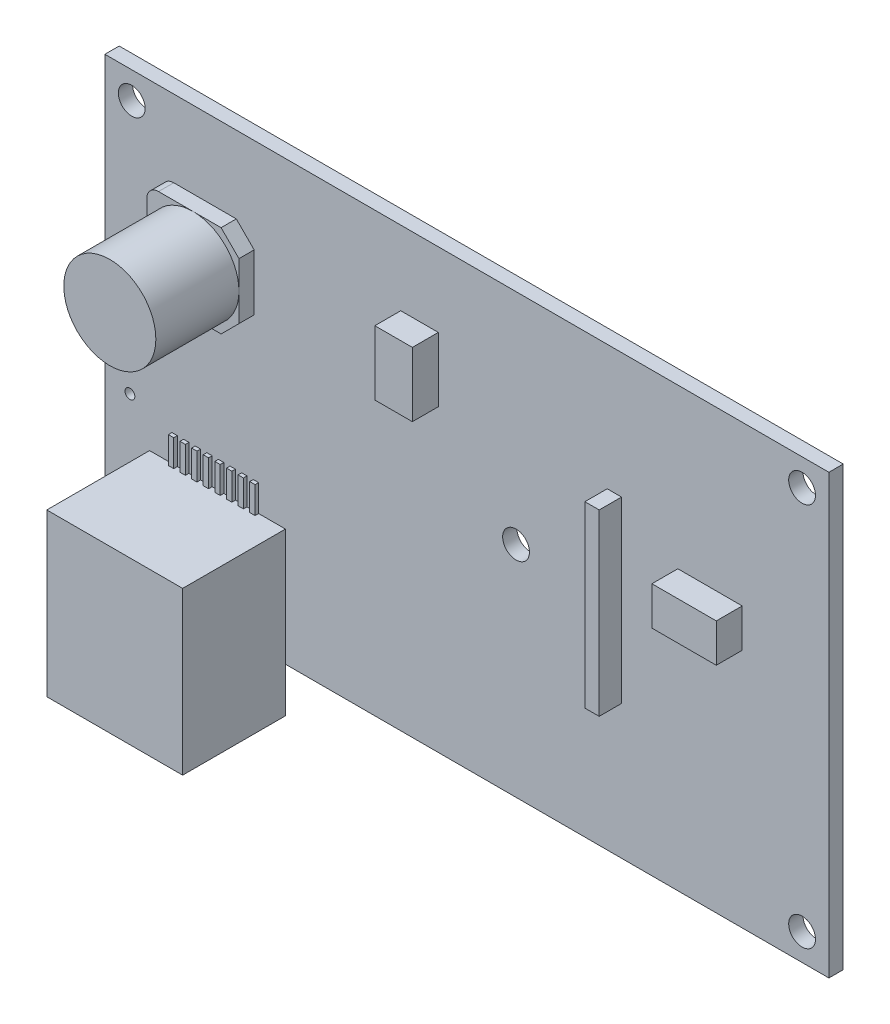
ISO-10303-21;
HEADER;
FILE_DESCRIPTION(('STEP AP214'),'2;1');
FILE_NAME('part.step','',(''),(''),'','','');
FILE_SCHEMA(('AUTOMOTIVE_DESIGN { 1 0 10303 214 1 1 1 1 }'));
ENDSEC;
DATA;
#1=APPLICATION_CONTEXT('core data for automotive mechanical design processes');
#2=APPLICATION_PROTOCOL_DEFINITION('international standard','automotive_design',2000,#1);
#3=PRODUCT_CONTEXT('',#1,'mechanical');
#4=PRODUCT('Part','Part','',(#3));
#5=PRODUCT_RELATED_PRODUCT_CATEGORY('part','',(#4));
#6=PRODUCT_DEFINITION_FORMATION('','',#4);
#7=PRODUCT_DEFINITION_CONTEXT('part definition',#1,'design');
#8=PRODUCT_DEFINITION('design','',#6,#7);
#9=PRODUCT_DEFINITION_SHAPE('','',#8);
#10=(LENGTH_UNIT() NAMED_UNIT(*) SI_UNIT(.MILLI.,.METRE.));
#11=(NAMED_UNIT(*) PLANE_ANGLE_UNIT() SI_UNIT($,.RADIAN.));
#12=(NAMED_UNIT(*) SI_UNIT($,.STERADIAN.) SOLID_ANGLE_UNIT());
#13=UNCERTAINTY_MEASURE_WITH_UNIT(LENGTH_MEASURE(1.E-05),#10,'distance_accuracy_value','');
#14=(GEOMETRIC_REPRESENTATION_CONTEXT(3) GLOBAL_UNCERTAINTY_ASSIGNED_CONTEXT((#13)) GLOBAL_UNIT_ASSIGNED_CONTEXT((#10,
#11,#12)) REPRESENTATION_CONTEXT('',''));
#15=CARTESIAN_POINT('',(0.,0.,0.));
#16=DIRECTION('',(0.,0.,1.));
#17=DIRECTION('',(1.,0.,0.));
#18=AXIS2_PLACEMENT_3D('',#15,#16,#17);
#19=CARTESIAN_POINT('',(32.25,32.5,-4.));
#20=DIRECTION('',(0.,0.,-1.));
#21=DIRECTION('',(-1.,0.,0.));
#22=AXIS2_PLACEMENT_3D('',#19,#20,#21);
#23=PLANE('',#22);
#24=DIRECTION('',(0.,-1.,0.));
#25=VECTOR('',#24,1.);
#26=CARTESIAN_POINT('',(32.25,38.5,-4.));
#27=LINE('',#26,#25);
#28=CARTESIAN_POINT('',(32.25,38.5,-4.));
#29=VERTEX_POINT('',#28);
#30=CARTESIAN_POINT('',(32.25,32.5,-4.));
#31=VERTEX_POINT('',#30);
#32=EDGE_CURVE('E674',#29,#31,#27,.T.);
#33=ORIENTED_EDGE('',*,*,#32,.T.);
#34=DIRECTION('',(-1.,0.,0.));
#35=VECTOR('',#34,1.);
#36=CARTESIAN_POINT('',(32.25,32.5,-4.));
#37=LINE('',#36,#35);
#38=CARTESIAN_POINT('',(26.25,32.5,-4.));
#39=VERTEX_POINT('',#38);
#40=EDGE_CURVE('E677',#31,#39,#37,.T.);
#41=ORIENTED_EDGE('',*,*,#40,.T.);
#42=DIRECTION('',(0.,1.,0.));
#43=VECTOR('',#42,1.);
#44=CARTESIAN_POINT('',(26.25,38.5,-4.));
#45=LINE('',#44,#43);
#46=CARTESIAN_POINT('',(26.25,38.5,-4.));
#47=VERTEX_POINT('',#46);
#48=EDGE_CURVE('E680',#39,#47,#45,.T.);
#49=ORIENTED_EDGE('',*,*,#48,.T.);
#50=DIRECTION('',(1.,0.,0.));
#51=VECTOR('',#50,1.);
#52=CARTESIAN_POINT('',(32.25,38.5,-4.));
#53=LINE('',#52,#51);
#54=EDGE_CURVE('E682',#47,#29,#53,.T.);
#55=ORIENTED_EDGE('',*,*,#54,.T.);
#56=EDGE_LOOP('',(#33,#41,#49,#55));
#57=FACE_BOUND('',#56,.T.);
#58=CARTESIAN_POINT('',(29.25,35.5,-4.));
#59=DIRECTION('',(0.,0.,-1.));
#60=DIRECTION('',(-1.,0.,0.));
#61=AXIS2_PLACEMENT_3D('',#58,#59,#60);
#62=CIRCLE('',#61,2.25);
#63=CARTESIAN_POINT('',(27.,35.5,-4.));
#64=VERTEX_POINT('',#63);
#65=EDGE_CURVE('E664',#64,#64,#62,.T.);
#66=ORIENTED_EDGE('',*,*,#65,.F.);
#67=EDGE_LOOP('',(#66));
#68=FACE_BOUND('',#67,.T.);
#69=ADVANCED_FACE('F16',(#57,#68),#23,.T.);
#70=CARTESIAN_POINT('',(0.,49.,0.));
#71=DIRECTION('',(0.,0.,-1.));
#72=DIRECTION('',(-1.,0.,0.));
#73=AXIS2_PLACEMENT_3D('',#70,#71,#72);
#74=PLANE('',#73);
#75=DIRECTION('',(1.,0.,0.));
#76=VECTOR('',#75,1.);
#77=CARTESIAN_POINT('',(27.65,26.1,0.));
#78=LINE('',#77,#76);
#79=CARTESIAN_POINT('',(27.65,26.1,0.));
#80=VERTEX_POINT('',#79);
#81=CARTESIAN_POINT('',(30.85,26.1,0.));
#82=VERTEX_POINT('',#81);
#83=EDGE_CURVE('E714',#80,#82,#78,.T.);
#84=ORIENTED_EDGE('',*,*,#83,.F.);
#85=DIRECTION('',(0.,1.,0.));
#86=VECTOR('',#85,1.);
#87=CARTESIAN_POINT('',(27.65,26.1,0.));
#88=LINE('',#87,#86);
#89=CARTESIAN_POINT('',(27.65,22.9,0.));
#90=VERTEX_POINT('',#89);
#91=EDGE_CURVE('E700',#90,#80,#88,.T.);
#92=ORIENTED_EDGE('',*,*,#91,.F.);
#93=DIRECTION('',(-1.,0.,0.));
#94=VECTOR('',#93,1.);
#95=CARTESIAN_POINT('',(27.65,22.9,0.));
#96=LINE('',#95,#94);
#97=CARTESIAN_POINT('',(30.85,22.9,0.));
#98=VERTEX_POINT('',#97);
#99=EDGE_CURVE('E705',#98,#90,#96,.T.);
#100=ORIENTED_EDGE('',*,*,#99,.F.);
#101=DIRECTION('',(0.,-1.,0.));
#102=VECTOR('',#101,1.);
#103=CARTESIAN_POINT('',(30.85,26.1,0.));
#104=LINE('',#103,#102);
#105=EDGE_CURVE('E716',#82,#98,#104,.T.);
#106=ORIENTED_EDGE('',*,*,#105,.F.);
#107=EDGE_LOOP('',(#84,#92,#100,#106));
#108=FACE_BOUND('',#107,.T.);
#109=CARTESIAN_POINT('',(2.8,31.2,0.));
#110=DIRECTION('',(0.,0.,1.));
#111=DIRECTION('',(1.,0.,0.));
#112=AXIS2_PLACEMENT_3D('',#109,#110,#111);
#113=CIRCLE('',#112,0.55);
#114=CARTESIAN_POINT('',(3.35,31.2,0.));
#115=VERTEX_POINT('',#114);
#116=EDGE_CURVE('E1324',#115,#115,#113,.T.);
#117=ORIENTED_EDGE('',*,*,#116,.T.);
#118=EDGE_LOOP('',(#117));
#119=FACE_BOUND('',#118,.T.);
#120=CARTESIAN_POINT('',(2.8,21.5,0.));
#121=DIRECTION('',(0.,0.,1.));
#122=DIRECTION('',(1.,0.,0.));
#123=AXIS2_PLACEMENT_3D('',#120,#121,#122);
#124=CIRCLE('',#123,0.55);
#125=CARTESIAN_POINT('',(3.35,21.5,0.));
#126=VERTEX_POINT('',#125);
#127=EDGE_CURVE('E1331',#126,#126,#124,.T.);
#128=ORIENTED_EDGE('',*,*,#127,.T.);
#129=EDGE_LOOP('',(#128));
#130=FACE_BOUND('',#129,.T.);
#131=CARTESIAN_POINT('',(18.3,3.5,0.));
#132=DIRECTION('',(0.,0.,1.));
#133=DIRECTION('',(1.,0.,0.));
#134=AXIS2_PLACEMENT_3D('',#131,#132,#133);
#135=CIRCLE('',#134,1.625);
#136=CARTESIAN_POINT('',(19.55,4.53832798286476,0.));
#137=VERTEX_POINT('',#136);
#138=CARTESIAN_POINT('',(17.25,4.74021167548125,0.));
#139=VERTEX_POINT('',#138);
#140=EDGE_CURVE('E1350',#137,#139,#135,.T.);
#141=ORIENTED_EDGE('',*,*,#140,.T.);
#142=CARTESIAN_POINT('',(17.25,2.25978832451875,0.));
#143=VERTEX_POINT('',#142);
#144=EDGE_CURVE('E1354',#139,#143,#135,.T.);
#145=ORIENTED_EDGE('',*,*,#144,.T.);
#146=CARTESIAN_POINT('',(19.55,2.46167201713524,0.));
#147=VERTEX_POINT('',#146);
#148=EDGE_CURVE('E2710',#143,#147,#135,.T.);
#149=ORIENTED_EDGE('',*,*,#148,.T.);
#150=EDGE_CURVE('E1343',#147,#137,#135,.T.);
#151=ORIENTED_EDGE('',*,*,#150,.T.);
#152=EDGE_LOOP('',(#141,#145,#149,#151));
#153=FACE_BOUND('',#152,.T.);
#154=CARTESIAN_POINT('',(46.,24.5,0.));
#155=DIRECTION('',(0.,0.,1.));
#156=DIRECTION('',(1.,0.,0.));
#157=AXIS2_PLACEMENT_3D('',#154,#155,#156);
#158=CIRCLE('',#157,1.5);
#159=CARTESIAN_POINT('',(47.5,24.5,0.));
#160=VERTEX_POINT('',#159);
#161=EDGE_CURVE('E1360',#160,#160,#158,.T.);
#162=ORIENTED_EDGE('',*,*,#161,.T.);
#163=EDGE_LOOP('',(#162));
#164=FACE_BOUND('',#163,.T.);
#165=CARTESIAN_POINT('',(78.,46.,0.));
#166=DIRECTION('',(0.,0.,1.));
#167=DIRECTION('',(1.,0.,0.));
#168=AXIS2_PLACEMENT_3D('',#165,#166,#167);
#169=CIRCLE('',#168,1.5);
#170=CARTESIAN_POINT('',(79.5,46.,0.));
#171=VERTEX_POINT('',#170);
#172=EDGE_CURVE('E1371',#171,#171,#169,.T.);
#173=ORIENTED_EDGE('',*,*,#172,.T.);
#174=EDGE_LOOP('',(#173));
#175=FACE_BOUND('',#174,.T.);
#176=CARTESIAN_POINT('',(3.,3.,0.));
#177=DIRECTION('',(0.,0.,1.));
#178=DIRECTION('',(1.,0.,0.));
#179=AXIS2_PLACEMENT_3D('',#176,#177,#178);
#180=CIRCLE('',#179,1.5);
#181=CARTESIAN_POINT('',(4.5,3.,0.));
#182=VERTEX_POINT('',#181);
#183=EDGE_CURVE('E1383',#182,#182,#180,.T.);
#184=ORIENTED_EDGE('',*,*,#183,.T.);
#185=EDGE_LOOP('',(#184));
#186=FACE_BOUND('',#185,.T.);
#187=DIRECTION('',(0.,-1.,0.));
#188=VECTOR('',#187,1.);
#189=CARTESIAN_POINT('',(0.,0.,0.));
#190=LINE('',#189,#188);
#191=CARTESIAN_POINT('',(0.,49.,0.));
#192=VERTEX_POINT('',#191);
#193=CARTESIAN_POINT('',(0.,0.,0.));
#194=VERTEX_POINT('',#193);
#195=EDGE_CURVE('E1389',#192,#194,#190,.T.);
#196=ORIENTED_EDGE('',*,*,#195,.F.);
#197=DIRECTION('',(-1.,0.,0.));
#198=VECTOR('',#197,1.);
#199=CARTESIAN_POINT('',(0.,49.,0.));
#200=LINE('',#199,#198);
#201=CARTESIAN_POINT('',(81.,49.,0.));
#202=VERTEX_POINT('',#201);
#203=EDGE_CURVE('E1396',#202,#192,#200,.T.);
#204=ORIENTED_EDGE('',*,*,#203,.F.);
#205=DIRECTION('',(0.,1.,0.));
#206=VECTOR('',#205,1.);
#207=CARTESIAN_POINT('',(81.,0.,0.));
#208=LINE('',#207,#206);
#209=CARTESIAN_POINT('',(81.,0.,0.));
#210=VERTEX_POINT('',#209);
#211=EDGE_CURVE('E1410',#210,#202,#208,.T.);
#212=ORIENTED_EDGE('',*,*,#211,.F.);
#213=DIRECTION('',(1.,0.,0.));
#214=VECTOR('',#213,1.);
#215=CARTESIAN_POINT('',(0.,0.,0.));
#216=LINE('',#215,#214);
#217=EDGE_CURVE('E1408',#194,#210,#216,.T.);
#218=ORIENTED_EDGE('',*,*,#217,.F.);
#219=EDGE_LOOP('',(#196,#204,#212,#218));
#220=FACE_BOUND('',#219,.T.);
#221=CARTESIAN_POINT('',(78.,3.,0.));
#222=DIRECTION('',(0.,0.,1.));
#223=DIRECTION('',(1.,0.,0.));
#224=AXIS2_PLACEMENT_3D('',#221,#222,#223);
#225=CIRCLE('',#224,1.5);
#226=CARTESIAN_POINT('',(79.5,3.,0.));
#227=VERTEX_POINT('',#226);
#228=EDGE_CURVE('E1377',#227,#227,#225,.T.);
#229=ORIENTED_EDGE('',*,*,#228,.T.);
#230=EDGE_LOOP('',(#229));
#231=FACE_BOUND('',#230,.T.);
#232=CARTESIAN_POINT('',(3.,46.,0.));
#233=DIRECTION('',(0.,0.,1.));
#234=DIRECTION('',(1.,0.,0.));
#235=AXIS2_PLACEMENT_3D('',#232,#233,#234);
#236=CIRCLE('',#235,1.5);
#237=CARTESIAN_POINT('',(4.5,46.,0.));
#238=VERTEX_POINT('',#237);
#239=EDGE_CURVE('E1365',#238,#238,#236,.T.);
#240=ORIENTED_EDGE('',*,*,#239,.T.);
#241=EDGE_LOOP('',(#240));
#242=FACE_BOUND('',#241,.T.);
#243=CARTESIAN_POINT('',(6.8,3.5,0.));
#244=DIRECTION('',(0.,0.,1.));
#245=DIRECTION('',(1.,0.,0.));
#246=AXIS2_PLACEMENT_3D('',#243,#244,#245);
#247=CIRCLE('',#246,1.625);
#248=CARTESIAN_POINT('',(7.85,4.74021167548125,0.));
#249=VERTEX_POINT('',#248);
#250=CARTESIAN_POINT('',(5.55,4.53832798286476,0.));
#251=VERTEX_POINT('',#250);
#252=EDGE_CURVE('E1357',#249,#251,#247,.T.);
#253=ORIENTED_EDGE('',*,*,#252,.T.);
#254=CARTESIAN_POINT('',(5.55,2.46167201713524,0.));
#255=VERTEX_POINT('',#254);
#256=EDGE_CURVE('E1361',#251,#255,#247,.T.);
#257=ORIENTED_EDGE('',*,*,#256,.T.);
#258=CARTESIAN_POINT('',(7.85,2.25978832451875,0.));
#259=VERTEX_POINT('',#258);
#260=EDGE_CURVE('E2582',#255,#259,#247,.T.);
#261=ORIENTED_EDGE('',*,*,#260,.T.);
#262=EDGE_CURVE('E1353',#259,#249,#247,.T.);
#263=ORIENTED_EDGE('',*,*,#262,.T.);
#264=EDGE_LOOP('',(#253,#257,#261,#263));
#265=FACE_BOUND('',#264,.T.);
#266=CARTESIAN_POINT('',(2.8,17.5,0.));
#267=DIRECTION('',(0.,0.,1.));
#268=DIRECTION('',(1.,0.,0.));
#269=AXIS2_PLACEMENT_3D('',#266,#267,#268);
#270=CIRCLE('',#269,0.55);
#271=CARTESIAN_POINT('',(3.35,17.5,0.));
#272=VERTEX_POINT('',#271);
#273=EDGE_CURVE('E1337',#272,#272,#270,.T.);
#274=ORIENTED_EDGE('',*,*,#273,.T.);
#275=EDGE_LOOP('',(#274));
#276=FACE_BOUND('',#275,.T.);
#277=CARTESIAN_POINT('',(2.8,27.2,0.));
#278=DIRECTION('',(0.,0.,1.));
#279=DIRECTION('',(1.,0.,0.));
#280=AXIS2_PLACEMENT_3D('',#277,#278,#279);
#281=CIRCLE('',#280,0.55);
#282=CARTESIAN_POINT('',(3.35,27.2,0.));
#283=VERTEX_POINT('',#282);
#284=EDGE_CURVE('E1323',#283,#283,#281,.T.);
#285=ORIENTED_EDGE('',*,*,#284,.T.);
#286=EDGE_LOOP('',(#285));
#287=FACE_BOUND('',#286,.T.);
#288=DIRECTION('',(1.,0.,0.));
#289=VECTOR('',#288,1.);
#290=CARTESIAN_POINT('',(19.65,26.1,0.));
#291=LINE('',#290,#289);
#292=CARTESIAN_POINT('',(19.65,26.1,0.));
#293=VERTEX_POINT('',#292);
#294=CARTESIAN_POINT('',(22.85,26.1,0.));
#295=VERTEX_POINT('',#294);
#296=EDGE_CURVE('E743',#293,#295,#291,.T.);
#297=ORIENTED_EDGE('',*,*,#296,.F.);
#298=DIRECTION('',(0.,1.,0.));
#299=VECTOR('',#298,1.);
#300=CARTESIAN_POINT('',(19.65,26.1,0.));
#301=LINE('',#300,#299);
#302=CARTESIAN_POINT('',(19.65,22.9,0.));
#303=VERTEX_POINT('',#302);
#304=EDGE_CURVE('E729',#303,#293,#301,.T.);
#305=ORIENTED_EDGE('',*,*,#304,.F.);
#306=DIRECTION('',(-1.,0.,0.));
#307=VECTOR('',#306,1.);
#308=CARTESIAN_POINT('',(19.65,22.9,0.));
#309=LINE('',#308,#307);
#310=CARTESIAN_POINT('',(22.85,22.9,0.));
#311=VERTEX_POINT('',#310);
#312=EDGE_CURVE('E734',#311,#303,#309,.T.);
#313=ORIENTED_EDGE('',*,*,#312,.F.);
#314=DIRECTION('',(0.,-1.,0.));
#315=VECTOR('',#314,1.);
#316=CARTESIAN_POINT('',(22.85,26.1,0.));
#317=LINE('',#316,#315);
#318=EDGE_CURVE('E745',#295,#311,#317,.T.);
#319=ORIENTED_EDGE('',*,*,#318,.F.);
#320=EDGE_LOOP('',(#297,#305,#313,#319));
#321=FACE_BOUND('',#320,.T.);
#322=DIRECTION('',(-1.,0.,0.));
#323=VECTOR('',#322,1.);
#324=CARTESIAN_POINT('',(32.25,32.5,0.));
#325=LINE('',#324,#323);
#326=CARTESIAN_POINT('',(32.25,32.5,0.));
#327=VERTEX_POINT('',#326);
#328=CARTESIAN_POINT('',(26.25,32.5,0.));
#329=VERTEX_POINT('',#328);
#330=EDGE_CURVE('E687',#327,#329,#325,.T.);
#331=ORIENTED_EDGE('',*,*,#330,.F.);
#332=DIRECTION('',(0.,-1.,0.));
#333=VECTOR('',#332,1.);
#334=CARTESIAN_POINT('',(32.25,38.5,0.));
#335=LINE('',#334,#333);
#336=CARTESIAN_POINT('',(32.25,38.5,0.));
#337=VERTEX_POINT('',#336);
#338=EDGE_CURVE('E671',#337,#327,#335,.T.);
#339=ORIENTED_EDGE('',*,*,#338,.F.);
#340=DIRECTION('',(1.,0.,0.));
#341=VECTOR('',#340,1.);
#342=CARTESIAN_POINT('',(32.25,38.5,0.));
#343=LINE('',#342,#341);
#344=CARTESIAN_POINT('',(26.25,38.5,0.));
#345=VERTEX_POINT('',#344);
#346=EDGE_CURVE('E678',#345,#337,#343,.T.);
#347=ORIENTED_EDGE('',*,*,#346,.F.);
#348=DIRECTION('',(0.,1.,0.));
#349=VECTOR('',#348,1.);
#350=CARTESIAN_POINT('',(26.25,38.5,0.));
#351=LINE('',#350,#349);
#352=EDGE_CURVE('E689',#329,#345,#351,.T.);
#353=ORIENTED_EDGE('',*,*,#352,.F.);
#354=EDGE_LOOP('',(#331,#339,#347,#353));
#355=FACE_BOUND('',#354,.T.);
#356=ADVANCED_FACE('F1493',(#108,#119,#130,#153,#164,#175,#186,#220,#231,#242,#265,#276,#287,
#321,#355),#74,.T.);
#357=CARTESIAN_POINT('',(0.,49.,1.6));
#358=DIRECTION('',(0.,0.,-1.));
#359=DIRECTION('',(-1.,0.,0.));
#360=AXIS2_PLACEMENT_3D('',#357,#358,#359);
#361=PLANE('',#360);
#362=DIRECTION('',(0.,-1.,0.));
#363=VECTOR('',#362,1.);
#364=CARTESIAN_POINT('',(33.1,40.7,1.6));
#365=LINE('',#364,#363);
#366=CARTESIAN_POINT('',(33.1,40.7,1.6));
#367=VERTEX_POINT('',#366);
#368=CARTESIAN_POINT('',(33.1,33.5,1.6));
#369=VERTEX_POINT('',#368);
#370=EDGE_CURVE('E1031',#367,#369,#365,.T.);
#371=ORIENTED_EDGE('',*,*,#370,.F.);
#372=DIRECTION('',(-1.,0.,0.));
#373=VECTOR('',#372,1.);
#374=CARTESIAN_POINT('',(33.1,40.7,1.6));
#375=LINE('',#374,#373);
#376=CARTESIAN_POINT('',(37.3,40.7,1.6));
#377=VERTEX_POINT('',#376);
#378=EDGE_CURVE('E1036',#377,#367,#375,.T.);
#379=ORIENTED_EDGE('',*,*,#378,.F.);
#380=DIRECTION('',(0.,1.,0.));
#381=VECTOR('',#380,1.);
#382=CARTESIAN_POINT('',(37.3,40.7,1.6));
#383=LINE('',#382,#381);
#384=CARTESIAN_POINT('',(37.3,33.5,1.6));
#385=VERTEX_POINT('',#384);
#386=EDGE_CURVE('E1048',#385,#377,#383,.T.);
#387=ORIENTED_EDGE('',*,*,#386,.F.);
#388=DIRECTION('',(1.,0.,0.));
#389=VECTOR('',#388,1.);
#390=CARTESIAN_POINT('',(33.1,33.5,1.6));
#391=LINE('',#390,#389);
#392=EDGE_CURVE('E1045',#369,#385,#391,.T.);
#393=ORIENTED_EDGE('',*,*,#392,.F.);
#394=EDGE_LOOP('',(#371,#379,#387,#393));
#395=FACE_BOUND('',#394,.T.);
#396=CARTESIAN_POINT('',(2.8,27.2,1.6));
#397=DIRECTION('',(0.,0.,1.));
#398=DIRECTION('',(1.,0.,0.));
#399=AXIS2_PLACEMENT_3D('',#396,#397,#398);
#400=CIRCLE('',#399,0.55);
#401=CARTESIAN_POINT('',(3.35,27.2,1.6));
#402=VERTEX_POINT('',#401);
#403=EDGE_CURVE('E1328',#402,#402,#400,.T.);
#404=ORIENTED_EDGE('',*,*,#403,.F.);
#405=EDGE_LOOP('',(#404));
#406=FACE_BOUND('',#405,.T.);
#407=CARTESIAN_POINT('',(2.8,17.5,1.6));
#408=DIRECTION('',(0.,0.,1.));
#409=DIRECTION('',(1.,0.,0.));
#410=AXIS2_PLACEMENT_3D('',#407,#408,#409);
#411=CIRCLE('',#410,0.55);
#412=CARTESIAN_POINT('',(3.35,17.5,1.6));
#413=VERTEX_POINT('',#412);
#414=EDGE_CURVE('E1340',#413,#413,#411,.T.);
#415=ORIENTED_EDGE('',*,*,#414,.F.);
#416=EDGE_LOOP('',(#415));
#417=FACE_BOUND('',#416,.T.);
#418=CARTESIAN_POINT('',(3.,46.,1.6));
#419=DIRECTION('',(0.,0.,1.));
#420=DIRECTION('',(1.,0.,0.));
#421=AXIS2_PLACEMENT_3D('',#418,#419,#420);
#422=CIRCLE('',#421,1.5);
#423=CARTESIAN_POINT('',(4.5,46.,1.6));
#424=VERTEX_POINT('',#423);
#425=EDGE_CURVE('E1368',#424,#424,#422,.T.);
#426=ORIENTED_EDGE('',*,*,#425,.F.);
#427=EDGE_LOOP('',(#426));
#428=FACE_BOUND('',#427,.T.);
#429=CARTESIAN_POINT('',(78.,3.,1.6));
#430=DIRECTION('',(0.,0.,1.));
#431=DIRECTION('',(1.,0.,0.));
#432=AXIS2_PLACEMENT_3D('',#429,#430,#431);
#433=CIRCLE('',#432,1.5);
#434=CARTESIAN_POINT('',(79.5,3.,1.6));
#435=VERTEX_POINT('',#434);
#436=EDGE_CURVE('E1380',#435,#435,#433,.T.);
#437=ORIENTED_EDGE('',*,*,#436,.F.);
#438=EDGE_LOOP('',(#437));
#439=FACE_BOUND('',#438,.T.);
#440=CARTESIAN_POINT('',(3.,3.,1.6));
#441=DIRECTION('',(0.,0.,1.));
#442=DIRECTION('',(1.,0.,0.));
#443=AXIS2_PLACEMENT_3D('',#440,#441,#442);
#444=CIRCLE('',#443,1.5);
#445=CARTESIAN_POINT('',(4.5,3.,1.6));
#446=VERTEX_POINT('',#445);
#447=EDGE_CURVE('E1386',#446,#446,#444,.T.);
#448=ORIENTED_EDGE('',*,*,#447,.F.);
#449=EDGE_LOOP('',(#448));
#450=FACE_BOUND('',#449,.T.);
#451=CARTESIAN_POINT('',(78.,46.,1.6));
#452=DIRECTION('',(0.,0.,1.));
#453=DIRECTION('',(1.,0.,0.));
#454=AXIS2_PLACEMENT_3D('',#451,#452,#453);
#455=CIRCLE('',#454,1.5);
#456=CARTESIAN_POINT('',(79.5,46.,1.6));
#457=VERTEX_POINT('',#456);
#458=EDGE_CURVE('E1374',#457,#457,#455,.T.);
#459=ORIENTED_EDGE('',*,*,#458,.F.);
#460=EDGE_LOOP('',(#459));
#461=FACE_BOUND('',#460,.T.);
#462=CARTESIAN_POINT('',(46.,24.5,1.6));
#463=DIRECTION('',(0.,0.,1.));
#464=DIRECTION('',(1.,0.,0.));
#465=AXIS2_PLACEMENT_3D('',#462,#463,#464);
#466=CIRCLE('',#465,1.5);
#467=CARTESIAN_POINT('',(47.5,24.5,1.6));
#468=VERTEX_POINT('',#467);
#469=EDGE_CURVE('E1362',#468,#468,#466,.T.);
#470=ORIENTED_EDGE('',*,*,#469,.F.);
#471=EDGE_LOOP('',(#470));
#472=FACE_BOUND('',#471,.T.);
#473=CARTESIAN_POINT('',(2.8,21.5,1.6));
#474=DIRECTION('',(0.,0.,1.));
#475=DIRECTION('',(1.,0.,0.));
#476=AXIS2_PLACEMENT_3D('',#473,#474,#475);
#477=CIRCLE('',#476,0.55);
#478=CARTESIAN_POINT('',(3.35,21.5,1.6));
#479=VERTEX_POINT('',#478);
#480=EDGE_CURVE('E1334',#479,#479,#477,.T.);
#481=ORIENTED_EDGE('',*,*,#480,.F.);
#482=EDGE_LOOP('',(#481));
#483=FACE_BOUND('',#482,.T.);
#484=CARTESIAN_POINT('',(2.8,31.2,1.6));
#485=DIRECTION('',(0.,0.,1.));
#486=DIRECTION('',(1.,0.,0.));
#487=AXIS2_PLACEMENT_3D('',#484,#485,#486);
#488=CIRCLE('',#487,0.55);
#489=CARTESIAN_POINT('',(3.35,31.2,1.6));
#490=VERTEX_POINT('',#489);
#491=EDGE_CURVE('E1320',#490,#490,#488,.T.);
#492=ORIENTED_EDGE('',*,*,#491,.F.);
#493=EDGE_LOOP('',(#492));
#494=FACE_BOUND('',#493,.T.);
#495=DIRECTION('',(-0.707106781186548,-0.707106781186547,0.));
#496=VECTOR('',#495,1.);
#497=CARTESIAN_POINT('',(-12.0878602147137,3.31213978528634,1.6));
#498=LINE('',#497,#496);
#499=CARTESIAN_POINT('',(16.7,32.1,1.6));
#500=VERTEX_POINT('',#499);
#501=CARTESIAN_POINT('',(14.7,30.1,1.6));
#502=VERTEX_POINT('',#501);
#503=EDGE_CURVE('E1131',#500,#502,#498,.T.);
#504=ORIENTED_EDGE('',*,*,#503,.T.);
#505=DIRECTION('',(-1.,0.,0.));
#506=VECTOR('',#505,1.);
#507=CARTESIAN_POINT('',(40.5,30.1,1.6));
#508=LINE('',#507,#506);
#509=CARTESIAN_POINT('',(7.7,30.1,1.6));
#510=VERTEX_POINT('',#509);
#511=EDGE_CURVE('E1100',#502,#510,#508,.T.);
#512=ORIENTED_EDGE('',*,*,#511,.T.);
#513=CARTESIAN_POINT('',(7.7,31.4,1.6));
#514=DIRECTION('',(0.,0.,1.));
#515=DIRECTION('',(1.,0.,0.));
#516=AXIS2_PLACEMENT_3D('',#513,#514,#515);
#517=CIRCLE('',#516,1.3);
#518=CARTESIAN_POINT('',(6.4,31.4,1.6));
#519=VERTEX_POINT('',#518);
#520=EDGE_CURVE('E1146',#510,#519,#517,.F.);
#521=ORIENTED_EDGE('',*,*,#520,.T.);
#522=DIRECTION('',(0.,1.,0.));
#523=VECTOR('',#522,1.);
#524=CARTESIAN_POINT('',(6.4,-49.2757204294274,1.6));
#525=LINE('',#524,#523);
#526=CARTESIAN_POINT('',(6.4,39.1,1.6));
#527=VERTEX_POINT('',#526);
#528=EDGE_CURVE('E1144',#519,#527,#525,.T.);
#529=ORIENTED_EDGE('',*,*,#528,.T.);
#530=CARTESIAN_POINT('',(7.7,39.1,1.6));
#531=DIRECTION('',(0.,0.,1.));
#532=DIRECTION('',(1.,0.,0.));
#533=AXIS2_PLACEMENT_3D('',#530,#531,#532);
#534=CIRCLE('',#533,1.3);
#535=CARTESIAN_POINT('',(7.7,40.4,1.6));
#536=VERTEX_POINT('',#535);
#537=EDGE_CURVE('E1141',#527,#536,#534,.F.);
#538=ORIENTED_EDGE('',*,*,#537,.T.);
#539=DIRECTION('',(1.,0.,0.));
#540=VECTOR('',#539,1.);
#541=CARTESIAN_POINT('',(40.5,40.4,1.6));
#542=LINE('',#541,#540);
#543=CARTESIAN_POINT('',(14.7,40.4,1.6));
#544=VERTEX_POINT('',#543);
#545=EDGE_CURVE('E1139',#536,#544,#542,.T.);
#546=ORIENTED_EDGE('',*,*,#545,.T.);
#547=DIRECTION('',(0.707106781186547,-0.707106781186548,0.));
#548=VECTOR('',#547,1.);
#549=CARTESIAN_POINT('',(72.4378602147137,-17.3378602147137,1.6));
#550=LINE('',#549,#548);
#551=CARTESIAN_POINT('',(16.7,38.4,1.6));
#552=VERTEX_POINT('',#551);
#553=EDGE_CURVE('E1136',#544,#552,#550,.T.);
#554=ORIENTED_EDGE('',*,*,#553,.T.);
#555=DIRECTION('',(0.,-1.,0.));
#556=VECTOR('',#555,1.);
#557=CARTESIAN_POINT('',(16.7,-49.2757204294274,1.6));
#558=LINE('',#557,#556);
#559=EDGE_CURVE('E1134',#552,#500,#558,.T.);
#560=ORIENTED_EDGE('',*,*,#559,.T.);
#561=EDGE_LOOP('',(#504,#512,#521,#529,#538,#546,#554,#560));
#562=FACE_BOUND('',#561,.T.);
#563=DIRECTION('',(0.,-1.,0.));
#564=VECTOR('',#563,1.);
#565=CARTESIAN_POINT('',(64.1,31.2,1.6));
#566=LINE('',#565,#564);
#567=CARTESIAN_POINT('',(64.1,31.2,1.6));
#568=VERTEX_POINT('',#567);
#569=CARTESIAN_POINT('',(64.1,26.9,1.6));
#570=VERTEX_POINT('',#569);
#571=EDGE_CURVE('E1064',#568,#570,#566,.T.);
#572=ORIENTED_EDGE('',*,*,#571,.F.);
#573=DIRECTION('',(-1.,0.,0.));
#574=VECTOR('',#573,1.);
#575=CARTESIAN_POINT('',(64.1,31.2,1.6));
#576=LINE('',#575,#574);
#577=CARTESIAN_POINT('',(71.3,31.2,1.6));
#578=VERTEX_POINT('',#577);
#579=EDGE_CURVE('E1069',#578,#568,#576,.T.);
#580=ORIENTED_EDGE('',*,*,#579,.F.);
#581=DIRECTION('',(0.,1.,0.));
#582=VECTOR('',#581,1.);
#583=CARTESIAN_POINT('',(71.3,31.2,1.6));
#584=LINE('',#583,#582);
#585=CARTESIAN_POINT('',(71.3,26.9,1.6));
#586=VERTEX_POINT('',#585);
#587=EDGE_CURVE('E1081',#586,#578,#584,.T.);
#588=ORIENTED_EDGE('',*,*,#587,.F.);
#589=DIRECTION('',(1.,0.,0.));
#590=VECTOR('',#589,1.);
#591=CARTESIAN_POINT('',(64.1,26.9,1.6));
#592=LINE('',#591,#590);
#593=EDGE_CURVE('E1078',#570,#586,#592,.T.);
#594=ORIENTED_EDGE('',*,*,#593,.F.);
#595=EDGE_LOOP('',(#572,#580,#588,#594));
#596=FACE_BOUND('',#595,.T.);
#597=DIRECTION('',(0.,-1.,0.));
#598=VECTOR('',#597,1.);
#599=CARTESIAN_POINT('',(56.2,35.,1.6));
#600=LINE('',#599,#598);
#601=CARTESIAN_POINT('',(56.2,35.,1.6));
#602=VERTEX_POINT('',#601);
#603=CARTESIAN_POINT('',(56.2,15.,1.6));
#604=VERTEX_POINT('',#603);
#605=EDGE_CURVE('E998',#602,#604,#600,.T.);
#606=ORIENTED_EDGE('',*,*,#605,.F.);
#607=DIRECTION('',(-1.,0.,0.));
#608=VECTOR('',#607,1.);
#609=CARTESIAN_POINT('',(56.2,35.,1.6));
#610=LINE('',#609,#608);
#611=CARTESIAN_POINT('',(57.8,35.,1.6));
#612=VERTEX_POINT('',#611);
#613=EDGE_CURVE('E1003',#612,#602,#610,.T.);
#614=ORIENTED_EDGE('',*,*,#613,.F.);
#615=DIRECTION('',(0.,1.,0.));
#616=VECTOR('',#615,1.);
#617=CARTESIAN_POINT('',(57.8,35.,1.6));
#618=LINE('',#617,#616);
#619=CARTESIAN_POINT('',(57.8,15.,1.6));
#620=VERTEX_POINT('',#619);
#621=EDGE_CURVE('E1015',#620,#612,#618,.T.);
#622=ORIENTED_EDGE('',*,*,#621,.F.);
#623=DIRECTION('',(1.,0.,0.));
#624=VECTOR('',#623,1.);
#625=CARTESIAN_POINT('',(56.2,15.,1.6));
#626=LINE('',#625,#624);
#627=EDGE_CURVE('E1012',#604,#620,#626,.T.);
#628=ORIENTED_EDGE('',*,*,#627,.F.);
#629=EDGE_LOOP('',(#606,#614,#622,#628));
#630=FACE_BOUND('',#629,.T.);
#631=DIRECTION('',(0.,-1.,0.));
#632=VECTOR('',#631,1.);
#633=CARTESIAN_POINT('',(16.6,13.1,1.6));
#634=LINE('',#633,#632);
#635=CARTESIAN_POINT('',(16.6,16.1,1.6));
#636=VERTEX_POINT('',#635);
#637=CARTESIAN_POINT('',(16.6,13.1,1.6));
#638=VERTEX_POINT('',#637);
#639=EDGE_CURVE('E758',#636,#638,#634,.T.);
#640=ORIENTED_EDGE('',*,*,#639,.F.);
#641=DIRECTION('',(-1.,0.,0.));
#642=VECTOR('',#641,1.);
#643=CARTESIAN_POINT('',(16.6,16.1,1.6));
#644=LINE('',#643,#642);
#645=CARTESIAN_POINT('',(17.2,16.1,1.6));
#646=VERTEX_POINT('',#645);
#647=EDGE_CURVE('E763',#646,#636,#644,.T.);
#648=ORIENTED_EDGE('',*,*,#647,.F.);
#649=DIRECTION('',(0.,1.,0.));
#650=VECTOR('',#649,1.);
#651=CARTESIAN_POINT('',(17.2,13.1,1.6));
#652=LINE('',#651,#650);
#653=CARTESIAN_POINT('',(17.2,13.1,1.6));
#654=VERTEX_POINT('',#653);
#655=EDGE_CURVE('E773',#654,#646,#652,.T.);
#656=ORIENTED_EDGE('',*,*,#655,.F.);
#657=DIRECTION('',(-1.,0.,0.));
#658=VECTOR('',#657,1.);
#659=CARTESIAN_POINT('',(5.,13.1,1.6));
#660=LINE('',#659,#658);
#661=CARTESIAN_POINT('',(20.2,13.1,1.6));
#662=VERTEX_POINT('',#661);
#663=EDGE_CURVE('E1288',#662,#654,#660,.T.);
#664=ORIENTED_EDGE('',*,*,#663,.F.);
#665=DIRECTION('',(0.,1.,0.));
#666=VECTOR('',#665,1.);
#667=CARTESIAN_POINT('',(20.2,-5.,1.6));
#668=LINE('',#667,#666);
#669=CARTESIAN_POINT('',(20.2,0.,1.6));
#670=VERTEX_POINT('',#669);
#671=EDGE_CURVE('E1304',#670,#662,#668,.T.);
#672=ORIENTED_EDGE('',*,*,#671,.F.);
#673=DIRECTION('',(1.,0.,0.));
#674=VECTOR('',#673,1.);
#675=CARTESIAN_POINT('',(0.,0.,1.6));
#676=LINE('',#675,#674);
#677=CARTESIAN_POINT('',(81.,0.,1.6));
#678=VERTEX_POINT('',#677);
#679=EDGE_CURVE('E1395',#670,#678,#676,.T.);
#680=ORIENTED_EDGE('',*,*,#679,.T.);
#681=DIRECTION('',(0.,1.,0.));
#682=VECTOR('',#681,1.);
#683=CARTESIAN_POINT('',(81.,0.,1.6));
#684=LINE('',#683,#682);
#685=CARTESIAN_POINT('',(81.,49.,1.6));
#686=VERTEX_POINT('',#685);
#687=EDGE_CURVE('E1400',#678,#686,#684,.T.);
#688=ORIENTED_EDGE('',*,*,#687,.T.);
#689=DIRECTION('',(-1.,0.,0.));
#690=VECTOR('',#689,1.);
#691=CARTESIAN_POINT('',(0.,49.,1.6));
#692=LINE('',#691,#690);
#693=CARTESIAN_POINT('',(0.,49.,1.6));
#694=VERTEX_POINT('',#693);
#695=EDGE_CURVE('E1403',#686,#694,#692,.T.);
#696=ORIENTED_EDGE('',*,*,#695,.T.);
#697=DIRECTION('',(0.,-1.,0.));
#698=VECTOR('',#697,1.);
#699=CARTESIAN_POINT('',(0.,0.,1.6));
#700=LINE('',#699,#698);
#701=CARTESIAN_POINT('',(0.,0.,1.6));
#702=VERTEX_POINT('',#701);
#703=EDGE_CURVE('E1392',#694,#702,#700,.T.);
#704=ORIENTED_EDGE('',*,*,#703,.T.);
#705=CARTESIAN_POINT('',(5.,0.,1.6));
#706=VERTEX_POINT('',#705);
#707=EDGE_CURVE('E1397',#702,#706,#676,.T.);
#708=ORIENTED_EDGE('',*,*,#707,.T.);
#709=DIRECTION('',(0.,-1.,0.));
#710=VECTOR('',#709,1.);
#711=CARTESIAN_POINT('',(5.,-5.,1.6));
#712=LINE('',#711,#710);
#713=CARTESIAN_POINT('',(5.,13.1,1.6));
#714=VERTEX_POINT('',#713);
#715=EDGE_CURVE('E1295',#714,#706,#712,.T.);
#716=ORIENTED_EDGE('',*,*,#715,.F.);
#717=CARTESIAN_POINT('',(7.5,13.1,1.6));
#718=VERTEX_POINT('',#717);
#719=EDGE_CURVE('E1303',#718,#714,#660,.T.);
#720=ORIENTED_EDGE('',*,*,#719,.F.);
#721=DIRECTION('',(0.,-1.,0.));
#722=VECTOR('',#721,1.);
#723=CARTESIAN_POINT('',(7.5,13.1,1.6));
#724=LINE('',#723,#722);
#725=CARTESIAN_POINT('',(7.5,16.1,1.6));
#726=VERTEX_POINT('',#725);
#727=EDGE_CURVE('E968',#726,#718,#724,.T.);
#728=ORIENTED_EDGE('',*,*,#727,.F.);
#729=DIRECTION('',(-1.,0.,0.));
#730=VECTOR('',#729,1.);
#731=CARTESIAN_POINT('',(7.5,16.1,1.6));
#732=LINE('',#731,#730);
#733=CARTESIAN_POINT('',(8.1,16.1,1.6));
#734=VERTEX_POINT('',#733);
#735=EDGE_CURVE('E973',#734,#726,#732,.T.);
#736=ORIENTED_EDGE('',*,*,#735,.F.);
#737=DIRECTION('',(0.,1.,0.));
#738=VECTOR('',#737,1.);
#739=CARTESIAN_POINT('',(8.1,13.1,1.6));
#740=LINE('',#739,#738);
#741=CARTESIAN_POINT('',(8.1,13.1,1.6));
#742=VERTEX_POINT('',#741);
#743=EDGE_CURVE('E983',#742,#734,#740,.T.);
#744=ORIENTED_EDGE('',*,*,#743,.F.);
#745=CARTESIAN_POINT('',(8.8,13.1,1.6));
#746=VERTEX_POINT('',#745);
#747=EDGE_CURVE('E2585',#746,#742,#660,.T.);
#748=ORIENTED_EDGE('',*,*,#747,.F.);
#749=DIRECTION('',(0.,-1.,0.));
#750=VECTOR('',#749,1.);
#751=CARTESIAN_POINT('',(8.8,13.1,1.6));
#752=LINE('',#751,#750);
#753=CARTESIAN_POINT('',(8.8,16.1,1.6));
#754=VERTEX_POINT('',#753);
#755=EDGE_CURVE('E938',#754,#746,#752,.T.);
#756=ORIENTED_EDGE('',*,*,#755,.F.);
#757=DIRECTION('',(-1.,0.,0.));
#758=VECTOR('',#757,1.);
#759=CARTESIAN_POINT('',(8.8,16.1,1.6));
#760=LINE('',#759,#758);
#761=CARTESIAN_POINT('',(9.4,16.1,1.6));
#762=VERTEX_POINT('',#761);
#763=EDGE_CURVE('E943',#762,#754,#760,.T.);
#764=ORIENTED_EDGE('',*,*,#763,.F.);
#765=DIRECTION('',(0.,1.,0.));
#766=VECTOR('',#765,1.);
#767=CARTESIAN_POINT('',(9.4,13.1,1.6));
#768=LINE('',#767,#766);
#769=CARTESIAN_POINT('',(9.4,13.1,1.6));
#770=VERTEX_POINT('',#769);
#771=EDGE_CURVE('E953',#770,#762,#768,.T.);
#772=ORIENTED_EDGE('',*,*,#771,.F.);
#773=CARTESIAN_POINT('',(10.1,13.1,1.6));
#774=VERTEX_POINT('',#773);
#775=EDGE_CURVE('E2595',#774,#770,#660,.T.);
#776=ORIENTED_EDGE('',*,*,#775,.F.);
#777=DIRECTION('',(0.,-1.,0.));
#778=VECTOR('',#777,1.);
#779=CARTESIAN_POINT('',(10.1,13.1,1.6));
#780=LINE('',#779,#778);
#781=CARTESIAN_POINT('',(10.1,16.1,1.6));
#782=VERTEX_POINT('',#781);
#783=EDGE_CURVE('E908',#782,#774,#780,.T.);
#784=ORIENTED_EDGE('',*,*,#783,.F.);
#785=DIRECTION('',(-1.,0.,0.));
#786=VECTOR('',#785,1.);
#787=CARTESIAN_POINT('',(10.1,16.1,1.6));
#788=LINE('',#787,#786);
#789=CARTESIAN_POINT('',(10.7,16.1,1.6));
#790=VERTEX_POINT('',#789);
#791=EDGE_CURVE('E913',#790,#782,#788,.T.);
#792=ORIENTED_EDGE('',*,*,#791,.F.);
#793=DIRECTION('',(0.,1.,0.));
#794=VECTOR('',#793,1.);
#795=CARTESIAN_POINT('',(10.7,13.1,1.6));
#796=LINE('',#795,#794);
#797=CARTESIAN_POINT('',(10.7,13.1,1.6));
#798=VERTEX_POINT('',#797);
#799=EDGE_CURVE('E923',#798,#790,#796,.T.);
#800=ORIENTED_EDGE('',*,*,#799,.F.);
#801=CARTESIAN_POINT('',(11.4,13.1,1.6));
#802=VERTEX_POINT('',#801);
#803=EDGE_CURVE('E2596',#802,#798,#660,.T.);
#804=ORIENTED_EDGE('',*,*,#803,.F.);
#805=DIRECTION('',(0.,-1.,0.));
#806=VECTOR('',#805,1.);
#807=CARTESIAN_POINT('',(11.4,13.1,1.6));
#808=LINE('',#807,#806);
#809=CARTESIAN_POINT('',(11.4,16.1,1.6));
#810=VERTEX_POINT('',#809);
#811=EDGE_CURVE('E878',#810,#802,#808,.T.);
#812=ORIENTED_EDGE('',*,*,#811,.F.);
#813=DIRECTION('',(-1.,0.,0.));
#814=VECTOR('',#813,1.);
#815=CARTESIAN_POINT('',(11.4,16.1,1.6));
#816=LINE('',#815,#814);
#817=CARTESIAN_POINT('',(12.,16.1,1.6));
#818=VERTEX_POINT('',#817);
#819=EDGE_CURVE('E883',#818,#810,#816,.T.);
#820=ORIENTED_EDGE('',*,*,#819,.F.);
#821=DIRECTION('',(0.,1.,0.));
#822=VECTOR('',#821,1.);
#823=CARTESIAN_POINT('',(12.,13.1,1.6));
#824=LINE('',#823,#822);
#825=CARTESIAN_POINT('',(12.,13.1,1.6));
#826=VERTEX_POINT('',#825);
#827=EDGE_CURVE('E893',#826,#818,#824,.T.);
#828=ORIENTED_EDGE('',*,*,#827,.F.);
#829=CARTESIAN_POINT('',(12.7,13.1,1.6));
#830=VERTEX_POINT('',#829);
#831=EDGE_CURVE('E2599',#830,#826,#660,.T.);
#832=ORIENTED_EDGE('',*,*,#831,.F.);
#833=DIRECTION('',(0.,-1.,0.));
#834=VECTOR('',#833,1.);
#835=CARTESIAN_POINT('',(12.7,13.1,1.6));
#836=LINE('',#835,#834);
#837=CARTESIAN_POINT('',(12.7,16.1,1.6));
#838=VERTEX_POINT('',#837);
#839=EDGE_CURVE('E848',#838,#830,#836,.T.);
#840=ORIENTED_EDGE('',*,*,#839,.F.);
#841=DIRECTION('',(-1.,0.,0.));
#842=VECTOR('',#841,1.);
#843=CARTESIAN_POINT('',(12.7,16.1,1.6));
#844=LINE('',#843,#842);
#845=CARTESIAN_POINT('',(13.3,16.1,1.6));
#846=VERTEX_POINT('',#845);
#847=EDGE_CURVE('E853',#846,#838,#844,.T.);
#848=ORIENTED_EDGE('',*,*,#847,.F.);
#849=DIRECTION('',(0.,1.,0.));
#850=VECTOR('',#849,1.);
#851=CARTESIAN_POINT('',(13.3,13.1,1.6));
#852=LINE('',#851,#850);
#853=CARTESIAN_POINT('',(13.3,13.1,1.6));
#854=VERTEX_POINT('',#853);
#855=EDGE_CURVE('E863',#854,#846,#852,.T.);
#856=ORIENTED_EDGE('',*,*,#855,.F.);
#857=CARTESIAN_POINT('',(14.,13.1,1.6));
#858=VERTEX_POINT('',#857);
#859=EDGE_CURVE('E2602',#858,#854,#660,.T.);
#860=ORIENTED_EDGE('',*,*,#859,.F.);
#861=DIRECTION('',(0.,-1.,0.));
#862=VECTOR('',#861,1.);
#863=CARTESIAN_POINT('',(14.,13.1,1.6));
#864=LINE('',#863,#862);
#865=CARTESIAN_POINT('',(14.,16.1,1.6));
#866=VERTEX_POINT('',#865);
#867=EDGE_CURVE('E818',#866,#858,#864,.T.);
#868=ORIENTED_EDGE('',*,*,#867,.F.);
#869=DIRECTION('',(-1.,0.,0.));
#870=VECTOR('',#869,1.);
#871=CARTESIAN_POINT('',(14.,16.1,1.6));
#872=LINE('',#871,#870);
#873=CARTESIAN_POINT('',(14.6,16.1,1.6));
#874=VERTEX_POINT('',#873);
#875=EDGE_CURVE('E823',#874,#866,#872,.T.);
#876=ORIENTED_EDGE('',*,*,#875,.F.);
#877=DIRECTION('',(0.,1.,0.));
#878=VECTOR('',#877,1.);
#879=CARTESIAN_POINT('',(14.6,13.1,1.6));
#880=LINE('',#879,#878);
#881=CARTESIAN_POINT('',(14.6,13.1,1.6));
#882=VERTEX_POINT('',#881);
#883=EDGE_CURVE('E833',#882,#874,#880,.T.);
#884=ORIENTED_EDGE('',*,*,#883,.F.);
#885=CARTESIAN_POINT('',(15.3,13.1,1.6));
#886=VERTEX_POINT('',#885);
#887=EDGE_CURVE('E2487',#886,#882,#660,.T.);
#888=ORIENTED_EDGE('',*,*,#887,.F.);
#889=DIRECTION('',(0.,-1.,0.));
#890=VECTOR('',#889,1.);
#891=CARTESIAN_POINT('',(15.3,13.1,1.6));
#892=LINE('',#891,#890);
#893=CARTESIAN_POINT('',(15.3,16.1,1.6));
#894=VERTEX_POINT('',#893);
#895=EDGE_CURVE('E788',#894,#886,#892,.T.);
#896=ORIENTED_EDGE('',*,*,#895,.F.);
#897=DIRECTION('',(-1.,0.,0.));
#898=VECTOR('',#897,1.);
#899=CARTESIAN_POINT('',(15.3,16.1,1.6));
#900=LINE('',#899,#898);
#901=CARTESIAN_POINT('',(15.9,16.1,1.6));
#902=VERTEX_POINT('',#901);
#903=EDGE_CURVE('E793',#902,#894,#900,.T.);
#904=ORIENTED_EDGE('',*,*,#903,.F.);
#905=DIRECTION('',(0.,1.,0.));
#906=VECTOR('',#905,1.);
#907=CARTESIAN_POINT('',(15.9,13.1,1.6));
#908=LINE('',#907,#906);
#909=CARTESIAN_POINT('',(15.9,13.1,1.6));
#910=VERTEX_POINT('',#909);
#911=EDGE_CURVE('E803',#910,#902,#908,.T.);
#912=ORIENTED_EDGE('',*,*,#911,.F.);
#913=EDGE_CURVE('E1307',#638,#910,#660,.T.);
#914=ORIENTED_EDGE('',*,*,#913,.F.);
#915=EDGE_LOOP('',(#640,#648,#656,#664,#672,#680,#688,#696,#704,#708,#716,#720,#728,#736,#744,
#748,#756,#764,#772,#776,#784,#792,#800,#804,#812,#820,#828,#832,#840,#848,#856,#860,#868,#876,
#884,#888,#896,#904,#912,#914));
#916=FACE_BOUND('',#915,.T.);
#917=ADVANCED_FACE('F1454',(#395,#406,#417,#428,#439,#450,#461,#472,#483,#494,#562,#596,#630,
#916),#361,.F.);
#918=CARTESIAN_POINT('',(5.,13.1,13.1));
#919=DIRECTION('',(0.,-1.,0.));
#920=DIRECTION('',(0.,0.,-1.));
#921=AXIS2_PLACEMENT_3D('',#918,#919,#920);
#922=PLANE('',#921);
#923=DIRECTION('',(0.,0.,-1.));
#924=VECTOR('',#923,1.);
#925=CARTESIAN_POINT('',(16.6,13.1,2.));
#926=LINE('',#925,#924);
#927=CARTESIAN_POINT('',(16.6,13.1,2.));
#928=VERTEX_POINT('',#927);
#929=EDGE_CURVE('E786',#928,#638,#926,.T.);
#930=ORIENTED_EDGE('',*,*,#929,.T.);
#931=ORIENTED_EDGE('',*,*,#913,.T.);
#932=DIRECTION('',(0.,0.,-1.));
#933=VECTOR('',#932,1.);
#934=CARTESIAN_POINT('',(15.9,13.1,2.));
#935=LINE('',#934,#933);
#936=CARTESIAN_POINT('',(15.9,13.1,2.));
#937=VERTEX_POINT('',#936);
#938=EDGE_CURVE('E813',#937,#910,#935,.T.);
#939=ORIENTED_EDGE('',*,*,#938,.F.);
#940=DIRECTION('',(1.,0.,0.));
#941=VECTOR('',#940,1.);
#942=CARTESIAN_POINT('',(15.3,13.1,2.));
#943=LINE('',#942,#941);
#944=CARTESIAN_POINT('',(15.3,13.1,2.));
#945=VERTEX_POINT('',#944);
#946=EDGE_CURVE('E792',#945,#937,#943,.T.);
#947=ORIENTED_EDGE('',*,*,#946,.F.);
#948=DIRECTION('',(0.,0.,-1.));
#949=VECTOR('',#948,1.);
#950=CARTESIAN_POINT('',(15.3,13.1,2.));
#951=LINE('',#950,#949);
#952=EDGE_CURVE('E816',#945,#886,#951,.T.);
#953=ORIENTED_EDGE('',*,*,#952,.T.);
#954=ORIENTED_EDGE('',*,*,#887,.T.);
#955=DIRECTION('',(0.,0.,-1.));
#956=VECTOR('',#955,1.);
#957=CARTESIAN_POINT('',(14.6,13.1,2.));
#958=LINE('',#957,#956);
#959=CARTESIAN_POINT('',(14.6,13.1,2.));
#960=VERTEX_POINT('',#959);
#961=EDGE_CURVE('E843',#960,#882,#958,.T.);
#962=ORIENTED_EDGE('',*,*,#961,.F.);
#963=DIRECTION('',(1.,0.,0.));
#964=VECTOR('',#963,1.);
#965=CARTESIAN_POINT('',(14.,13.1,2.));
#966=LINE('',#965,#964);
#967=CARTESIAN_POINT('',(14.,13.1,2.));
#968=VERTEX_POINT('',#967);
#969=EDGE_CURVE('E822',#968,#960,#966,.T.);
#970=ORIENTED_EDGE('',*,*,#969,.F.);
#971=DIRECTION('',(0.,0.,-1.));
#972=VECTOR('',#971,1.);
#973=CARTESIAN_POINT('',(14.,13.1,2.));
#974=LINE('',#973,#972);
#975=EDGE_CURVE('E846',#968,#858,#974,.T.);
#976=ORIENTED_EDGE('',*,*,#975,.T.);
#977=ORIENTED_EDGE('',*,*,#859,.T.);
#978=DIRECTION('',(0.,0.,-1.));
#979=VECTOR('',#978,1.);
#980=CARTESIAN_POINT('',(13.3,13.1,2.));
#981=LINE('',#980,#979);
#982=CARTESIAN_POINT('',(13.3,13.1,2.));
#983=VERTEX_POINT('',#982);
#984=EDGE_CURVE('E873',#983,#854,#981,.T.);
#985=ORIENTED_EDGE('',*,*,#984,.F.);
#986=DIRECTION('',(1.,0.,0.));
#987=VECTOR('',#986,1.);
#988=CARTESIAN_POINT('',(12.7,13.1,2.));
#989=LINE('',#988,#987);
#990=CARTESIAN_POINT('',(12.7,13.1,2.));
#991=VERTEX_POINT('',#990);
#992=EDGE_CURVE('E852',#991,#983,#989,.T.);
#993=ORIENTED_EDGE('',*,*,#992,.F.);
#994=DIRECTION('',(0.,0.,-1.));
#995=VECTOR('',#994,1.);
#996=CARTESIAN_POINT('',(12.7,13.1,2.));
#997=LINE('',#996,#995);
#998=EDGE_CURVE('E876',#991,#830,#997,.T.);
#999=ORIENTED_EDGE('',*,*,#998,.T.);
#1000=ORIENTED_EDGE('',*,*,#831,.T.);
#1001=DIRECTION('',(0.,0.,-1.));
#1002=VECTOR('',#1001,1.);
#1003=CARTESIAN_POINT('',(12.,13.1,2.));
#1004=LINE('',#1003,#1002);
#1005=CARTESIAN_POINT('',(12.,13.1,2.));
#1006=VERTEX_POINT('',#1005);
#1007=EDGE_CURVE('E903',#1006,#826,#1004,.T.);
#1008=ORIENTED_EDGE('',*,*,#1007,.F.);
#1009=DIRECTION('',(1.,0.,0.));
#1010=VECTOR('',#1009,1.);
#1011=CARTESIAN_POINT('',(11.4,13.1,2.));
#1012=LINE('',#1011,#1010);
#1013=CARTESIAN_POINT('',(11.4,13.1,2.));
#1014=VERTEX_POINT('',#1013);
#1015=EDGE_CURVE('E882',#1014,#1006,#1012,.T.);
#1016=ORIENTED_EDGE('',*,*,#1015,.F.);
#1017=DIRECTION('',(0.,0.,-1.));
#1018=VECTOR('',#1017,1.);
#1019=CARTESIAN_POINT('',(11.4,13.1,2.));
#1020=LINE('',#1019,#1018);
#1021=EDGE_CURVE('E906',#1014,#802,#1020,.T.);
#1022=ORIENTED_EDGE('',*,*,#1021,.T.);
#1023=ORIENTED_EDGE('',*,*,#803,.T.);
#1024=DIRECTION('',(0.,0.,-1.));
#1025=VECTOR('',#1024,1.);
#1026=CARTESIAN_POINT('',(10.7,13.1,2.));
#1027=LINE('',#1026,#1025);
#1028=CARTESIAN_POINT('',(10.7,13.1,2.));
#1029=VERTEX_POINT('',#1028);
#1030=EDGE_CURVE('E933',#1029,#798,#1027,.T.);
#1031=ORIENTED_EDGE('',*,*,#1030,.F.);
#1032=DIRECTION('',(1.,0.,0.));
#1033=VECTOR('',#1032,1.);
#1034=CARTESIAN_POINT('',(10.1,13.1,2.));
#1035=LINE('',#1034,#1033);
#1036=CARTESIAN_POINT('',(10.1,13.1,2.));
#1037=VERTEX_POINT('',#1036);
#1038=EDGE_CURVE('E912',#1037,#1029,#1035,.T.);
#1039=ORIENTED_EDGE('',*,*,#1038,.F.);
#1040=DIRECTION('',(0.,0.,-1.));
#1041=VECTOR('',#1040,1.);
#1042=CARTESIAN_POINT('',(10.1,13.1,2.));
#1043=LINE('',#1042,#1041);
#1044=EDGE_CURVE('E936',#1037,#774,#1043,.T.);
#1045=ORIENTED_EDGE('',*,*,#1044,.T.);
#1046=ORIENTED_EDGE('',*,*,#775,.T.);
#1047=DIRECTION('',(0.,0.,-1.));
#1048=VECTOR('',#1047,1.);
#1049=CARTESIAN_POINT('',(9.4,13.1,2.));
#1050=LINE('',#1049,#1048);
#1051=CARTESIAN_POINT('',(9.4,13.1,2.));
#1052=VERTEX_POINT('',#1051);
#1053=EDGE_CURVE('E963',#1052,#770,#1050,.T.);
#1054=ORIENTED_EDGE('',*,*,#1053,.F.);
#1055=DIRECTION('',(1.,0.,0.));
#1056=VECTOR('',#1055,1.);
#1057=CARTESIAN_POINT('',(8.8,13.1,2.));
#1058=LINE('',#1057,#1056);
#1059=CARTESIAN_POINT('',(8.8,13.1,2.));
#1060=VERTEX_POINT('',#1059);
#1061=EDGE_CURVE('E942',#1060,#1052,#1058,.T.);
#1062=ORIENTED_EDGE('',*,*,#1061,.F.);
#1063=DIRECTION('',(0.,0.,-1.));
#1064=VECTOR('',#1063,1.);
#1065=CARTESIAN_POINT('',(8.8,13.1,2.));
#1066=LINE('',#1065,#1064);
#1067=EDGE_CURVE('E966',#1060,#746,#1066,.T.);
#1068=ORIENTED_EDGE('',*,*,#1067,.T.);
#1069=ORIENTED_EDGE('',*,*,#747,.T.);
#1070=DIRECTION('',(0.,0.,-1.));
#1071=VECTOR('',#1070,1.);
#1072=CARTESIAN_POINT('',(8.1,13.1,2.));
#1073=LINE('',#1072,#1071);
#1074=CARTESIAN_POINT('',(8.1,13.1,2.));
#1075=VERTEX_POINT('',#1074);
#1076=EDGE_CURVE('E993',#1075,#742,#1073,.T.);
#1077=ORIENTED_EDGE('',*,*,#1076,.F.);
#1078=DIRECTION('',(1.,0.,0.));
#1079=VECTOR('',#1078,1.);
#1080=CARTESIAN_POINT('',(7.5,13.1,2.));
#1081=LINE('',#1080,#1079);
#1082=CARTESIAN_POINT('',(7.5,13.1,2.));
#1083=VERTEX_POINT('',#1082);
#1084=EDGE_CURVE('E972',#1083,#1075,#1081,.T.);
#1085=ORIENTED_EDGE('',*,*,#1084,.F.);
#1086=DIRECTION('',(0.,0.,-1.));
#1087=VECTOR('',#1086,1.);
#1088=CARTESIAN_POINT('',(7.5,13.1,2.));
#1089=LINE('',#1088,#1087);
#1090=EDGE_CURVE('E996',#1083,#718,#1089,.T.);
#1091=ORIENTED_EDGE('',*,*,#1090,.T.);
#1092=ORIENTED_EDGE('',*,*,#719,.T.);
#1093=DIRECTION('',(0.,0.,-1.));
#1094=VECTOR('',#1093,1.);
#1095=CARTESIAN_POINT('',(5.,13.1,13.1));
#1096=LINE('',#1095,#1094);
#1097=CARTESIAN_POINT('',(5.,13.1,13.1));
#1098=VERTEX_POINT('',#1097);
#1099=EDGE_CURVE('E1294',#1098,#714,#1096,.T.);
#1100=ORIENTED_EDGE('',*,*,#1099,.F.);
#1101=DIRECTION('',(-1.,0.,0.));
#1102=VECTOR('',#1101,1.);
#1103=CARTESIAN_POINT('',(5.,13.1,13.1));
#1104=LINE('',#1103,#1102);
#1105=CARTESIAN_POINT('',(20.2,13.1,13.1));
#1106=VERTEX_POINT('',#1105);
#1107=EDGE_CURVE('E1292',#1106,#1098,#1104,.T.);
#1108=ORIENTED_EDGE('',*,*,#1107,.F.);
#1109=DIRECTION('',(0.,0.,-1.));
#1110=VECTOR('',#1109,1.);
#1111=CARTESIAN_POINT('',(20.2,13.1,13.1));
#1112=LINE('',#1111,#1110);
#1113=EDGE_CURVE('E1310',#1106,#662,#1112,.T.);
#1114=ORIENTED_EDGE('',*,*,#1113,.T.);
#1115=ORIENTED_EDGE('',*,*,#663,.T.);
#1116=DIRECTION('',(0.,0.,-1.));
#1117=VECTOR('',#1116,1.);
#1118=CARTESIAN_POINT('',(17.2,13.1,2.));
#1119=LINE('',#1118,#1117);
#1120=CARTESIAN_POINT('',(17.2,13.1,2.));
#1121=VERTEX_POINT('',#1120);
#1122=EDGE_CURVE('E783',#1121,#654,#1119,.T.);
#1123=ORIENTED_EDGE('',*,*,#1122,.F.);
#1124=DIRECTION('',(1.,0.,0.));
#1125=VECTOR('',#1124,1.);
#1126=CARTESIAN_POINT('',(16.6,13.1,2.));
#1127=LINE('',#1126,#1125);
#1128=EDGE_CURVE('E762',#928,#1121,#1127,.T.);
#1129=ORIENTED_EDGE('',*,*,#1128,.F.);
#1130=EDGE_LOOP('',(#930,#931,#939,#947,#953,#954,#962,#970,#976,#977,#985,#993,#999,#1000,
#1008,#1016,#1022,#1023,#1031,#1039,#1045,#1046,#1054,#1062,#1068,#1069,#1077,#1085,#1091,#1092,
#1100,#1108,#1114,#1115,#1123,#1129));
#1131=FACE_BOUND('',#1130,.T.);
#1132=ADVANCED_FACE('F1759',(#1131),#922,.F.);
#1133=CARTESIAN_POINT('',(40.5,-49.2757204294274,3.3));
#1134=DIRECTION('',(0.,0.,1.));
#1135=DIRECTION('',(1.,0.,0.));
#1136=AXIS2_PLACEMENT_3D('',#1133,#1134,#1135);
#1137=PLANE('',#1136);
#1138=DIRECTION('',(0.,-1.,0.));
#1139=VECTOR('',#1138,1.);
#1140=CARTESIAN_POINT('',(16.7,-49.2757204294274,3.3));
#1141=LINE('',#1140,#1139);
#1142=CARTESIAN_POINT('',(16.7,35.25,3.3));
#1143=VERTEX_POINT('',#1142);
#1144=CARTESIAN_POINT('',(16.7,32.1,3.3));
#1145=VERTEX_POINT('',#1144);
#1146=EDGE_CURVE('E1108',#1143,#1145,#1141,.T.);
#1147=ORIENTED_EDGE('',*,*,#1146,.F.);
#1148=CARTESIAN_POINT('',(11.55,35.25,3.3));
#1149=DIRECTION('',(0.,0.,1.));
#1150=DIRECTION('',(1.,0.,0.));
#1151=AXIS2_PLACEMENT_3D('',#1148,#1149,#1150);
#1152=CIRCLE('',#1151,5.15);
#1153=CARTESIAN_POINT('',(11.55,30.1,3.3));
#1154=VERTEX_POINT('',#1153);
#1155=EDGE_CURVE('E11',#1143,#1154,#1152,.F.);
#1156=ORIENTED_EDGE('',*,*,#1155,.T.);
#1157=DIRECTION('',(-1.,0.,0.));
#1158=VECTOR('',#1157,1.);
#1159=CARTESIAN_POINT('',(40.5,30.1,3.3));
#1160=LINE('',#1159,#1158);
#1161=CARTESIAN_POINT('',(14.7,30.1,3.3));
#1162=VERTEX_POINT('',#1161);
#1163=EDGE_CURVE('E1101',#1162,#1154,#1160,.T.);
#1164=ORIENTED_EDGE('',*,*,#1163,.F.);
#1165=DIRECTION('',(-0.707106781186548,-0.707106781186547,0.));
#1166=VECTOR('',#1165,1.);
#1167=CARTESIAN_POINT('',(-12.0878602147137,3.31213978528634,3.3));
#1168=LINE('',#1167,#1166);
#1169=EDGE_CURVE('E1104',#1145,#1162,#1168,.T.);
#1170=ORIENTED_EDGE('',*,*,#1169,.F.);
#1171=EDGE_LOOP('',(#1147,#1156,#1164,#1170));
#1172=FACE_BOUND('',#1171,.T.);
#1173=ADVANCED_FACE('F1463',(#1172),#1137,.T.);
#1174=CARTESIAN_POINT('',(7.7,30.1,3.3));
#1175=VERTEX_POINT('',#1174);
#1176=EDGE_CURVE('E1105',#1154,#1175,#1160,.T.);
#1177=ORIENTED_EDGE('',*,*,#1176,.F.);
#1178=CARTESIAN_POINT('',(6.4,35.25,3.3));
#1179=VERTEX_POINT('',#1178);
#1180=EDGE_CURVE('E25',#1154,#1179,#1152,.F.);
#1181=ORIENTED_EDGE('',*,*,#1180,.T.);
#1182=DIRECTION('',(0.,1.,0.));
#1183=VECTOR('',#1182,1.);
#1184=CARTESIAN_POINT('',(6.4,-49.2757204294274,3.3));
#1185=LINE('',#1184,#1183);
#1186=CARTESIAN_POINT('',(6.4,31.4,3.3));
#1187=VERTEX_POINT('',#1186);
#1188=EDGE_CURVE('E1123',#1187,#1179,#1185,.T.);
#1189=ORIENTED_EDGE('',*,*,#1188,.F.);
#1190=CARTESIAN_POINT('',(7.7,31.4,3.3));
#1191=DIRECTION('',(0.,0.,1.));
#1192=DIRECTION('',(1.,0.,0.));
#1193=AXIS2_PLACEMENT_3D('',#1190,#1191,#1192);
#1194=CIRCLE('',#1193,1.3);
#1195=EDGE_CURVE('E1126',#1175,#1187,#1194,.F.);
#1196=ORIENTED_EDGE('',*,*,#1195,.F.);
#1197=EDGE_LOOP('',(#1177,#1181,#1189,#1196));
#1198=FACE_BOUND('',#1197,.T.);
#1199=ADVANCED_FACE('F1441',(#1198),#1137,.T.);
#1200=CARTESIAN_POINT('',(6.4,39.1,3.3));
#1201=VERTEX_POINT('',#1200);
#1202=EDGE_CURVE('E1122',#1179,#1201,#1185,.T.);
#1203=ORIENTED_EDGE('',*,*,#1202,.F.);
#1204=CARTESIAN_POINT('',(11.55,40.4,3.3));
#1205=VERTEX_POINT('',#1204);
#1206=EDGE_CURVE('E1428',#1179,#1205,#1152,.F.);
#1207=ORIENTED_EDGE('',*,*,#1206,.T.);
#1208=DIRECTION('',(1.,0.,0.));
#1209=VECTOR('',#1208,1.);
#1210=CARTESIAN_POINT('',(40.5,40.4,3.3));
#1211=LINE('',#1210,#1209);
#1212=CARTESIAN_POINT('',(7.7,40.4,3.3));
#1213=VERTEX_POINT('',#1212);
#1214=EDGE_CURVE('E1116',#1213,#1205,#1211,.T.);
#1215=ORIENTED_EDGE('',*,*,#1214,.F.);
#1216=CARTESIAN_POINT('',(7.7,39.1,3.3));
#1217=DIRECTION('',(0.,0.,1.));
#1218=DIRECTION('',(1.,0.,0.));
#1219=AXIS2_PLACEMENT_3D('',#1216,#1217,#1218);
#1220=CIRCLE('',#1219,1.3);
#1221=EDGE_CURVE('E1119',#1201,#1213,#1220,.F.);
#1222=ORIENTED_EDGE('',*,*,#1221,.F.);
#1223=EDGE_LOOP('',(#1203,#1207,#1215,#1222));
#1224=FACE_BOUND('',#1223,.T.);
#1225=ADVANCED_FACE('F1445',(#1224),#1137,.T.);
#1226=CARTESIAN_POINT('',(14.7,40.4,3.3));
#1227=VERTEX_POINT('',#1226);
#1228=EDGE_CURVE('E1115',#1205,#1227,#1211,.T.);
#1229=ORIENTED_EDGE('',*,*,#1228,.F.);
#1230=EDGE_CURVE('E20',#1205,#1143,#1152,.F.);
#1231=ORIENTED_EDGE('',*,*,#1230,.T.);
#1232=CARTESIAN_POINT('',(16.7,38.4,3.3));
#1233=VERTEX_POINT('',#1232);
#1234=EDGE_CURVE('E1109',#1233,#1143,#1141,.T.);
#1235=ORIENTED_EDGE('',*,*,#1234,.F.);
#1236=DIRECTION('',(0.707106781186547,-0.707106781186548,0.));
#1237=VECTOR('',#1236,1.);
#1238=CARTESIAN_POINT('',(72.4378602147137,-17.3378602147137,3.3));
#1239=LINE('',#1238,#1237);
#1240=EDGE_CURVE('E1112',#1227,#1233,#1239,.T.);
#1241=ORIENTED_EDGE('',*,*,#1240,.F.);
#1242=EDGE_LOOP('',(#1229,#1231,#1235,#1241));
#1243=FACE_BOUND('',#1242,.T.);
#1244=ADVANCED_FACE('F1471',(#1243),#1137,.T.);
#1245=CARTESIAN_POINT('',(18.3,3.5,1.6));
#1246=DIRECTION('',(0.,0.,-1.));
#1247=DIRECTION('',(-1.,0.,0.));
#1248=AXIS2_PLACEMENT_3D('',#1245,#1246,#1247);
#1249=CYLINDRICAL_SURFACE('',#1248,1.625);
#1250=CARTESIAN_POINT('',(18.3,3.5,1.6));
#1251=DIRECTION('',(0.,0.,1.));
#1252=DIRECTION('',(1.,0.,0.));
#1253=AXIS2_PLACEMENT_3D('',#1250,#1251,#1252);
#1254=CIRCLE('',#1253,1.625);
#1255=CARTESIAN_POINT('',(17.25,4.74021167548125,1.6));
#1256=VERTEX_POINT('',#1255);
#1257=CARTESIAN_POINT('',(17.25,2.25978832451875,1.6));
#1258=VERTEX_POINT('',#1257);
#1259=EDGE_CURVE('E1346',#1256,#1258,#1254,.T.);
#1260=ORIENTED_EDGE('',*,*,#1259,.T.);
#1261=DIRECTION('',(0.,0.,1.));
#1262=VECTOR('',#1261,1.);
#1263=CARTESIAN_POINT('',(17.25,2.25978832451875,-1.4));
#1264=LINE('',#1263,#1262);
#1265=EDGE_CURVE('E1193',#143,#1258,#1264,.T.);
#1266=ORIENTED_EDGE('',*,*,#1265,.F.);
#1267=ORIENTED_EDGE('',*,*,#144,.F.);
#1268=DIRECTION('',(0.,0.,1.));
#1269=VECTOR('',#1268,1.);
#1270=CARTESIAN_POINT('',(17.25,4.74021167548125,-1.4));
#1271=LINE('',#1270,#1269);
#1272=EDGE_CURVE('E1250',#139,#1256,#1271,.T.);
#1273=ORIENTED_EDGE('',*,*,#1272,.T.);
#1274=EDGE_LOOP('',(#1260,#1266,#1267,#1273));
#1275=FACE_BOUND('',#1274,.T.);
#1276=ADVANCED_FACE('F2125',(#1275),#1249,.F.);
#1277=ORIENTED_EDGE('',*,*,#150,.F.);
#1278=DIRECTION('',(0.,0.,1.));
#1279=VECTOR('',#1278,1.);
#1280=CARTESIAN_POINT('',(19.55,2.46167201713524,-1.4));
#1281=LINE('',#1280,#1279);
#1282=CARTESIAN_POINT('',(19.55,2.46167201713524,1.6));
#1283=VERTEX_POINT('',#1282);
#1284=EDGE_CURVE('E1180',#147,#1283,#1281,.T.);
#1285=ORIENTED_EDGE('',*,*,#1284,.T.);
#1286=CARTESIAN_POINT('',(19.55,4.53832798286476,1.6));
#1287=VERTEX_POINT('',#1286);
#1288=EDGE_CURVE('E1319',#1283,#1287,#1254,.T.);
#1289=ORIENTED_EDGE('',*,*,#1288,.T.);
#1290=DIRECTION('',(0.,0.,1.));
#1291=VECTOR('',#1290,1.);
#1292=CARTESIAN_POINT('',(19.55,4.53832798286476,-1.4));
#1293=LINE('',#1292,#1291);
#1294=EDGE_CURVE('E1246',#137,#1287,#1293,.T.);
#1295=ORIENTED_EDGE('',*,*,#1294,.F.);
#1296=EDGE_LOOP('',(#1277,#1285,#1289,#1295));
#1297=FACE_BOUND('',#1296,.T.);
#1298=ADVANCED_FACE('F2129',(#1297),#1249,.F.);
#1299=CARTESIAN_POINT('',(5.,13.1,1.6));
#1300=DIRECTION('',(0.,0.,-1.));
#1301=DIRECTION('',(-1.,0.,0.));
#1302=AXIS2_PLACEMENT_3D('',#1299,#1300,#1301);
#1303=PLANE('',#1302);
#1304=DIRECTION('',(1.,0.,0.));
#1305=VECTOR('',#1304,1.);
#1306=CARTESIAN_POINT('',(19.55,2.85,1.6));
#1307=LINE('',#1306,#1305);
#1308=CARTESIAN_POINT('',(17.25,2.85,1.6));
#1309=VERTEX_POINT('',#1308);
#1310=CARTESIAN_POINT('',(19.55,2.85,1.6));
#1311=VERTEX_POINT('',#1310);
#1312=EDGE_CURVE('E1182',#1309,#1311,#1307,.T.);
#1313=ORIENTED_EDGE('',*,*,#1312,.F.);
#1314=DIRECTION('',(0.,1.,0.));
#1315=VECTOR('',#1314,1.);
#1316=CARTESIAN_POINT('',(17.25,2.85,1.6));
#1317=LINE('',#1316,#1315);
#1318=EDGE_CURVE('E1169',#1258,#1309,#1317,.T.);
#1319=ORIENTED_EDGE('',*,*,#1318,.F.);
#1320=ORIENTED_EDGE('',*,*,#1259,.F.);
#1321=DIRECTION('',(0.,1.,0.));
#1322=VECTOR('',#1321,1.);
#1323=CARTESIAN_POINT('',(17.25,4.74021167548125,1.6));
#1324=LINE('',#1323,#1322);
#1325=CARTESIAN_POINT('',(17.25,4.15,1.6));
#1326=VERTEX_POINT('',#1325);
#1327=EDGE_CURVE('E1225',#1326,#1256,#1324,.T.);
#1328=ORIENTED_EDGE('',*,*,#1327,.F.);
#1329=DIRECTION('',(-1.,0.,0.));
#1330=VECTOR('',#1329,1.);
#1331=CARTESIAN_POINT('',(19.55,4.15,1.6));
#1332=LINE('',#1331,#1330);
#1333=CARTESIAN_POINT('',(19.55,4.15,1.6));
#1334=VERTEX_POINT('',#1333);
#1335=EDGE_CURVE('E1230',#1334,#1326,#1332,.T.);
#1336=ORIENTED_EDGE('',*,*,#1335,.F.);
#1337=DIRECTION('',(0.,-1.,0.));
#1338=VECTOR('',#1337,1.);
#1339=CARTESIAN_POINT('',(19.55,4.15,1.6));
#1340=LINE('',#1339,#1338);
#1341=EDGE_CURVE('E1238',#1287,#1334,#1340,.T.);
#1342=ORIENTED_EDGE('',*,*,#1341,.F.);
#1343=ORIENTED_EDGE('',*,*,#1288,.F.);
#1344=DIRECTION('',(0.,-1.,0.));
#1345=VECTOR('',#1344,1.);
#1346=CARTESIAN_POINT('',(19.55,2.46167201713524,1.6));
#1347=LINE('',#1346,#1345);
#1348=EDGE_CURVE('E1174',#1311,#1283,#1347,.T.);
#1349=ORIENTED_EDGE('',*,*,#1348,.F.);
#1350=EDGE_LOOP('',(#1313,#1319,#1320,#1328,#1336,#1342,#1343,#1349));
#1351=FACE_BOUND('',#1350,.T.);
#1352=ADVANCED_FACE('F2141',(#1351),#1303,.T.);
#1353=CARTESIAN_POINT('',(6.8,3.5,1.6));
#1354=DIRECTION('',(0.,0.,-1.));
#1355=DIRECTION('',(-1.,0.,0.));
#1356=AXIS2_PLACEMENT_3D('',#1353,#1354,#1355);
#1357=CYLINDRICAL_SURFACE('',#1356,1.625);
#1358=CARTESIAN_POINT('',(6.8,3.5,1.6));
#1359=DIRECTION('',(0.,0.,1.));
#1360=DIRECTION('',(1.,0.,0.));
#1361=AXIS2_PLACEMENT_3D('',#1358,#1359,#1360);
#1362=CIRCLE('',#1361,1.625);
#1363=CARTESIAN_POINT('',(5.55,4.53832798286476,1.6));
#1364=VERTEX_POINT('',#1363);
#1365=CARTESIAN_POINT('',(5.55,2.46167201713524,1.6));
#1366=VERTEX_POINT('',#1365);
#1367=EDGE_CURVE('E1327',#1364,#1366,#1362,.T.);
#1368=ORIENTED_EDGE('',*,*,#1367,.T.);
#1369=DIRECTION('',(0.,0.,1.));
#1370=VECTOR('',#1369,1.);
#1371=CARTESIAN_POINT('',(5.55,2.46167201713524,-1.4));
#1372=LINE('',#1371,#1370);
#1373=EDGE_CURVE('E1221',#255,#1366,#1372,.T.);
#1374=ORIENTED_EDGE('',*,*,#1373,.F.);
#1375=ORIENTED_EDGE('',*,*,#256,.F.);
#1376=DIRECTION('',(0.,0.,1.));
#1377=VECTOR('',#1376,1.);
#1378=CARTESIAN_POINT('',(5.55,4.53832798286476,-1.4));
#1379=LINE('',#1378,#1377);
#1380=EDGE_CURVE('E1265',#251,#1364,#1379,.T.);
#1381=ORIENTED_EDGE('',*,*,#1380,.T.);
#1382=EDGE_LOOP('',(#1368,#1374,#1375,#1381));
#1383=FACE_BOUND('',#1382,.T.);
#1384=ADVANCED_FACE('F2136',(#1383),#1357,.F.);
#1385=ORIENTED_EDGE('',*,*,#262,.F.);
#1386=DIRECTION('',(0.,0.,1.));
#1387=VECTOR('',#1386,1.);
#1388=CARTESIAN_POINT('',(7.85,2.25978832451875,-1.4));
#1389=LINE('',#1388,#1387);
#1390=CARTESIAN_POINT('',(7.85,2.25978832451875,1.6));
#1391=VERTEX_POINT('',#1390);
#1392=EDGE_CURVE('E1208',#259,#1391,#1389,.T.);
#1393=ORIENTED_EDGE('',*,*,#1392,.T.);
#1394=CARTESIAN_POINT('',(7.85,4.74021167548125,1.6));
#1395=VERTEX_POINT('',#1394);
#1396=EDGE_CURVE('E1349',#1391,#1395,#1362,.T.);
#1397=ORIENTED_EDGE('',*,*,#1396,.T.);
#1398=DIRECTION('',(0.,0.,1.));
#1399=VECTOR('',#1398,1.);
#1400=CARTESIAN_POINT('',(7.85,4.74021167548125,-1.4));
#1401=LINE('',#1400,#1399);
#1402=EDGE_CURVE('E1279',#249,#1395,#1401,.T.);
#1403=ORIENTED_EDGE('',*,*,#1402,.F.);
#1404=EDGE_LOOP('',(#1385,#1393,#1397,#1403));
#1405=FACE_BOUND('',#1404,.T.);
#1406=ADVANCED_FACE('F2140',(#1405),#1357,.F.);
#1407=DIRECTION('',(1.,0.,0.));
#1408=VECTOR('',#1407,1.);
#1409=CARTESIAN_POINT('',(5.55,2.85,1.6));
#1410=LINE('',#1409,#1408);
#1411=CARTESIAN_POINT('',(5.55,2.85,1.6));
#1412=VERTEX_POINT('',#1411);
#1413=CARTESIAN_POINT('',(7.85,2.85,1.6));
#1414=VERTEX_POINT('',#1413);
#1415=EDGE_CURVE('E1210',#1412,#1414,#1410,.T.);
#1416=ORIENTED_EDGE('',*,*,#1415,.F.);
#1417=DIRECTION('',(0.,1.,0.));
#1418=VECTOR('',#1417,1.);
#1419=CARTESIAN_POINT('',(5.55,2.46167201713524,1.6));
#1420=LINE('',#1419,#1418);
#1421=EDGE_CURVE('E1197',#1366,#1412,#1420,.T.);
#1422=ORIENTED_EDGE('',*,*,#1421,.F.);
#1423=ORIENTED_EDGE('',*,*,#1367,.F.);
#1424=DIRECTION('',(0.,1.,0.));
#1425=VECTOR('',#1424,1.);
#1426=CARTESIAN_POINT('',(5.55,4.15,1.6));
#1427=LINE('',#1426,#1425);
#1428=CARTESIAN_POINT('',(5.55,4.15,1.6));
#1429=VERTEX_POINT('',#1428);
#1430=EDGE_CURVE('E1259',#1429,#1364,#1427,.T.);
#1431=ORIENTED_EDGE('',*,*,#1430,.F.);
#1432=DIRECTION('',(-1.,0.,0.));
#1433=VECTOR('',#1432,1.);
#1434=CARTESIAN_POINT('',(5.55,4.15,1.6));
#1435=LINE('',#1434,#1433);
#1436=CARTESIAN_POINT('',(7.85,4.15,1.6));
#1437=VERTEX_POINT('',#1436);
#1438=EDGE_CURVE('E1267',#1437,#1429,#1435,.T.);
#1439=ORIENTED_EDGE('',*,*,#1438,.F.);
#1440=DIRECTION('',(0.,-1.,0.));
#1441=VECTOR('',#1440,1.);
#1442=CARTESIAN_POINT('',(7.85,4.74021167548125,1.6));
#1443=LINE('',#1442,#1441);
#1444=EDGE_CURVE('E1254',#1395,#1437,#1443,.T.);
#1445=ORIENTED_EDGE('',*,*,#1444,.F.);
#1446=ORIENTED_EDGE('',*,*,#1396,.F.);
#1447=DIRECTION('',(0.,-1.,0.));
#1448=VECTOR('',#1447,1.);
#1449=CARTESIAN_POINT('',(7.85,2.85,1.6));
#1450=LINE('',#1449,#1448);
#1451=EDGE_CURVE('E1202',#1414,#1391,#1450,.T.);
#1452=ORIENTED_EDGE('',*,*,#1451,.F.);
#1453=EDGE_LOOP('',(#1416,#1422,#1423,#1431,#1439,#1445,#1446,#1452));
#1454=FACE_BOUND('',#1453,.T.);
#1455=ADVANCED_FACE('F2211',(#1454),#1303,.T.);
#1456=CARTESIAN_POINT('',(0.,0.,1.6));
#1457=DIRECTION('',(1.,0.,0.));
#1458=DIRECTION('',(0.,0.,-1.));
#1459=AXIS2_PLACEMENT_3D('',#1456,#1457,#1458);
#1460=PLANE('',#1459);
#1461=ORIENTED_EDGE('',*,*,#195,.T.);
#1462=DIRECTION('',(0.,0.,-1.));
#1463=VECTOR('',#1462,1.);
#1464=CARTESIAN_POINT('',(0.,0.,1.6));
#1465=LINE('',#1464,#1463);
#1466=EDGE_CURVE('E1420',#702,#194,#1465,.T.);
#1467=ORIENTED_EDGE('',*,*,#1466,.F.);
#1468=ORIENTED_EDGE('',*,*,#703,.F.);
#1469=DIRECTION('',(0.,0.,-1.));
#1470=VECTOR('',#1469,1.);
#1471=CARTESIAN_POINT('',(0.,49.,1.6));
#1472=LINE('',#1471,#1470);
#1473=EDGE_CURVE('E1405',#694,#192,#1472,.T.);
#1474=ORIENTED_EDGE('',*,*,#1473,.T.);
#1475=EDGE_LOOP('',(#1461,#1467,#1468,#1474));
#1476=FACE_BOUND('',#1475,.T.);
#1477=ADVANCED_FACE('F18',(#1476),#1460,.F.);
#1478=CARTESIAN_POINT('',(0.,0.,1.6));
#1479=DIRECTION('',(0.,1.,0.));
#1480=DIRECTION('',(0.,0.,1.));
#1481=AXIS2_PLACEMENT_3D('',#1478,#1479,#1480);
#1482=PLANE('',#1481);
#1483=ORIENTED_EDGE('',*,*,#217,.T.);
#1484=DIRECTION('',(0.,0.,-1.));
#1485=VECTOR('',#1484,1.);
#1486=CARTESIAN_POINT('',(81.,0.,1.6));
#1487=LINE('',#1486,#1485);
#1488=EDGE_CURVE('E1418',#678,#210,#1487,.T.);
#1489=ORIENTED_EDGE('',*,*,#1488,.F.);
#1490=ORIENTED_EDGE('',*,*,#679,.F.);
#1491=EDGE_CURVE('E1401',#706,#670,#676,.T.);
#1492=ORIENTED_EDGE('',*,*,#1491,.F.);
#1493=ORIENTED_EDGE('',*,*,#707,.F.);
#1494=ORIENTED_EDGE('',*,*,#1466,.T.);
#1495=EDGE_LOOP('',(#1483,#1489,#1490,#1492,#1493,#1494));
#1496=FACE_BOUND('',#1495,.T.);
#1497=ADVANCED_FACE('F2198',(#1496),#1482,.F.);
#1498=CARTESIAN_POINT('',(81.,0.,1.6));
#1499=DIRECTION('',(-1.,0.,0.));
#1500=DIRECTION('',(0.,0.,1.));
#1501=AXIS2_PLACEMENT_3D('',#1498,#1499,#1500);
#1502=PLANE('',#1501);
#1503=ORIENTED_EDGE('',*,*,#211,.T.);
#1504=DIRECTION('',(0.,0.,-1.));
#1505=VECTOR('',#1504,1.);
#1506=CARTESIAN_POINT('',(81.,49.,1.6));
#1507=LINE('',#1506,#1505);
#1508=EDGE_CURVE('E1415',#686,#202,#1507,.T.);
#1509=ORIENTED_EDGE('',*,*,#1508,.F.);
#1510=ORIENTED_EDGE('',*,*,#687,.F.);
#1511=ORIENTED_EDGE('',*,*,#1488,.T.);
#1512=EDGE_LOOP('',(#1503,#1509,#1510,#1511));
#1513=FACE_BOUND('',#1512,.T.);
#1514=ADVANCED_FACE('F2190',(#1513),#1502,.F.);
#1515=CARTESIAN_POINT('',(0.,49.,1.6));
#1516=DIRECTION('',(0.,-1.,0.));
#1517=DIRECTION('',(0.,0.,-1.));
#1518=AXIS2_PLACEMENT_3D('',#1515,#1516,#1517);
#1519=PLANE('',#1518);
#1520=ORIENTED_EDGE('',*,*,#203,.T.);
#1521=ORIENTED_EDGE('',*,*,#1473,.F.);
#1522=ORIENTED_EDGE('',*,*,#695,.F.);
#1523=ORIENTED_EDGE('',*,*,#1508,.T.);
#1524=EDGE_LOOP('',(#1520,#1521,#1522,#1523));
#1525=FACE_BOUND('',#1524,.T.);
#1526=ADVANCED_FACE('F2182',(#1525),#1519,.F.);
#1527=CARTESIAN_POINT('',(3.,3.,1.6));
#1528=DIRECTION('',(0.,0.,-1.));
#1529=DIRECTION('',(-1.,0.,0.));
#1530=AXIS2_PLACEMENT_3D('',#1527,#1528,#1529);
#1531=CYLINDRICAL_SURFACE('',#1530,1.5);
#1532=ORIENTED_EDGE('',*,*,#447,.T.);
#1533=EDGE_LOOP('',(#1532));
#1534=FACE_BOUND('',#1533,.T.);
#1535=ORIENTED_EDGE('',*,*,#183,.F.);
#1536=EDGE_LOOP('',(#1535));
#1537=FACE_BOUND('',#1536,.T.);
#1538=ADVANCED_FACE('F2174',(#1534,#1537),#1531,.F.);
#1539=CARTESIAN_POINT('',(78.,3.,1.6));
#1540=DIRECTION('',(0.,0.,-1.));
#1541=DIRECTION('',(-1.,0.,0.));
#1542=AXIS2_PLACEMENT_3D('',#1539,#1540,#1541);
#1543=CYLINDRICAL_SURFACE('',#1542,1.5);
#1544=ORIENTED_EDGE('',*,*,#436,.T.);
#1545=EDGE_LOOP('',(#1544));
#1546=FACE_BOUND('',#1545,.T.);
#1547=ORIENTED_EDGE('',*,*,#228,.F.);
#1548=EDGE_LOOP('',(#1547));
#1549=FACE_BOUND('',#1548,.T.);
#1550=ADVANCED_FACE('F2166',(#1546,#1549),#1543,.F.);
#1551=CARTESIAN_POINT('',(78.,46.,1.6));
#1552=DIRECTION('',(0.,0.,-1.));
#1553=DIRECTION('',(-1.,0.,0.));
#1554=AXIS2_PLACEMENT_3D('',#1551,#1552,#1553);
#1555=CYLINDRICAL_SURFACE('',#1554,1.5);
#1556=ORIENTED_EDGE('',*,*,#458,.T.);
#1557=EDGE_LOOP('',(#1556));
#1558=FACE_BOUND('',#1557,.T.);
#1559=ORIENTED_EDGE('',*,*,#172,.F.);
#1560=EDGE_LOOP('',(#1559));
#1561=FACE_BOUND('',#1560,.T.);
#1562=ADVANCED_FACE('F2158',(#1558,#1561),#1555,.F.);
#1563=CARTESIAN_POINT('',(3.,46.,1.6));
#1564=DIRECTION('',(0.,0.,-1.));
#1565=DIRECTION('',(-1.,0.,0.));
#1566=AXIS2_PLACEMENT_3D('',#1563,#1564,#1565);
#1567=CYLINDRICAL_SURFACE('',#1566,1.5);
#1568=ORIENTED_EDGE('',*,*,#425,.T.);
#1569=EDGE_LOOP('',(#1568));
#1570=FACE_BOUND('',#1569,.T.);
#1571=ORIENTED_EDGE('',*,*,#239,.F.);
#1572=EDGE_LOOP('',(#1571));
#1573=FACE_BOUND('',#1572,.T.);
#1574=ADVANCED_FACE('F2150',(#1570,#1573),#1567,.F.);
#1575=CARTESIAN_POINT('',(46.,24.5,1.6));
#1576=DIRECTION('',(0.,0.,-1.));
#1577=DIRECTION('',(-1.,0.,0.));
#1578=AXIS2_PLACEMENT_3D('',#1575,#1576,#1577);
#1579=CYLINDRICAL_SURFACE('',#1578,1.5);
#1580=ORIENTED_EDGE('',*,*,#469,.T.);
#1581=EDGE_LOOP('',(#1580));
#1582=FACE_BOUND('',#1581,.T.);
#1583=ORIENTED_EDGE('',*,*,#161,.F.);
#1584=EDGE_LOOP('',(#1583));
#1585=FACE_BOUND('',#1584,.T.);
#1586=ADVANCED_FACE('F2119',(#1582,#1585),#1579,.F.);
#1587=CARTESIAN_POINT('',(2.8,17.5,1.6));
#1588=DIRECTION('',(0.,0.,-1.));
#1589=DIRECTION('',(-1.,0.,0.));
#1590=AXIS2_PLACEMENT_3D('',#1587,#1588,#1589);
#1591=CYLINDRICAL_SURFACE('',#1590,0.55);
#1592=ORIENTED_EDGE('',*,*,#414,.T.);
#1593=EDGE_LOOP('',(#1592));
#1594=FACE_BOUND('',#1593,.T.);
#1595=ORIENTED_EDGE('',*,*,#273,.F.);
#1596=EDGE_LOOP('',(#1595));
#1597=FACE_BOUND('',#1596,.T.);
#1598=ADVANCED_FACE('F2111',(#1594,#1597),#1591,.F.);
#1599=CARTESIAN_POINT('',(2.8,21.5,1.6));
#1600=DIRECTION('',(0.,0.,-1.));
#1601=DIRECTION('',(-1.,0.,0.));
#1602=AXIS2_PLACEMENT_3D('',#1599,#1600,#1601);
#1603=CYLINDRICAL_SURFACE('',#1602,0.55);
#1604=ORIENTED_EDGE('',*,*,#480,.T.);
#1605=EDGE_LOOP('',(#1604));
#1606=FACE_BOUND('',#1605,.T.);
#1607=ORIENTED_EDGE('',*,*,#127,.F.);
#1608=EDGE_LOOP('',(#1607));
#1609=FACE_BOUND('',#1608,.T.);
#1610=ADVANCED_FACE('F2094',(#1606,#1609),#1603,.F.);
#1611=CARTESIAN_POINT('',(2.8,27.2,1.6));
#1612=DIRECTION('',(0.,0.,-1.));
#1613=DIRECTION('',(-1.,0.,0.));
#1614=AXIS2_PLACEMENT_3D('',#1611,#1612,#1613);
#1615=CYLINDRICAL_SURFACE('',#1614,0.55);
#1616=ORIENTED_EDGE('',*,*,#403,.T.);
#1617=EDGE_LOOP('',(#1616));
#1618=FACE_BOUND('',#1617,.T.);
#1619=ORIENTED_EDGE('',*,*,#284,.F.);
#1620=EDGE_LOOP('',(#1619));
#1621=FACE_BOUND('',#1620,.T.);
#1622=ADVANCED_FACE('F2089',(#1618,#1621),#1615,.F.);
#1623=CARTESIAN_POINT('',(2.8,31.2,1.6));
#1624=DIRECTION('',(0.,0.,-1.));
#1625=DIRECTION('',(-1.,0.,0.));
#1626=AXIS2_PLACEMENT_3D('',#1623,#1624,#1625);
#1627=CYLINDRICAL_SURFACE('',#1626,0.55);
#1628=ORIENTED_EDGE('',*,*,#491,.T.);
#1629=EDGE_LOOP('',(#1628));
#1630=FACE_BOUND('',#1629,.T.);
#1631=ORIENTED_EDGE('',*,*,#116,.F.);
#1632=EDGE_LOOP('',(#1631));
#1633=FACE_BOUND('',#1632,.T.);
#1634=ADVANCED_FACE('F2093',(#1630,#1633),#1627,.F.);
#1635=CARTESIAN_POINT('',(5.,-5.,1.6));
#1636=VERTEX_POINT('',#1635);
#1637=EDGE_CURVE('E1283',#706,#1636,#712,.T.);
#1638=ORIENTED_EDGE('',*,*,#1637,.F.);
#1639=ORIENTED_EDGE('',*,*,#1491,.T.);
#1640=CARTESIAN_POINT('',(20.2,-5.,1.6));
#1641=VERTEX_POINT('',#1640);
#1642=EDGE_CURVE('E1300',#1641,#670,#668,.T.);
#1643=ORIENTED_EDGE('',*,*,#1642,.F.);
#1644=DIRECTION('',(1.,0.,0.));
#1645=VECTOR('',#1644,1.);
#1646=CARTESIAN_POINT('',(5.,-5.,1.6));
#1647=LINE('',#1646,#1645);
#1648=EDGE_CURVE('E1298',#1636,#1641,#1647,.T.);
#1649=ORIENTED_EDGE('',*,*,#1648,.F.);
#1650=EDGE_LOOP('',(#1638,#1639,#1643,#1649));
#1651=FACE_BOUND('',#1650,.T.);
#1652=ADVANCED_FACE('F2103',(#1651),#1303,.T.);
#1653=CARTESIAN_POINT('',(5.,13.1,13.1));
#1654=DIRECTION('',(0.,0.,-1.));
#1655=DIRECTION('',(-1.,0.,0.));
#1656=AXIS2_PLACEMENT_3D('',#1653,#1654,#1655);
#1657=PLANE('',#1656);
#1658=DIRECTION('',(0.,-1.,0.));
#1659=VECTOR('',#1658,1.);
#1660=CARTESIAN_POINT('',(5.,-5.,13.1));
#1661=LINE('',#1660,#1659);
#1662=CARTESIAN_POINT('',(5.,-5.,13.1));
#1663=VERTEX_POINT('',#1662);
#1664=EDGE_CURVE('E1284',#1098,#1663,#1661,.T.);
#1665=ORIENTED_EDGE('',*,*,#1664,.T.);
#1666=DIRECTION('',(1.,0.,0.));
#1667=VECTOR('',#1666,1.);
#1668=CARTESIAN_POINT('',(5.,-5.,13.1));
#1669=LINE('',#1668,#1667);
#1670=CARTESIAN_POINT('',(20.2,-5.,13.1));
#1671=VERTEX_POINT('',#1670);
#1672=EDGE_CURVE('E1287',#1663,#1671,#1669,.T.);
#1673=ORIENTED_EDGE('',*,*,#1672,.T.);
#1674=DIRECTION('',(0.,1.,0.));
#1675=VECTOR('',#1674,1.);
#1676=CARTESIAN_POINT('',(20.2,-5.,13.1));
#1677=LINE('',#1676,#1675);
#1678=EDGE_CURVE('E1290',#1671,#1106,#1677,.T.);
#1679=ORIENTED_EDGE('',*,*,#1678,.T.);
#1680=ORIENTED_EDGE('',*,*,#1107,.T.);
#1681=EDGE_LOOP('',(#1665,#1673,#1679,#1680));
#1682=FACE_BOUND('',#1681,.T.);
#1683=ADVANCED_FACE('F2229',(#1682),#1657,.F.);
#1684=CARTESIAN_POINT('',(20.2,-5.,13.1));
#1685=DIRECTION('',(-1.,0.,0.));
#1686=DIRECTION('',(0.,0.,1.));
#1687=AXIS2_PLACEMENT_3D('',#1684,#1685,#1686);
#1688=PLANE('',#1687);
#1689=ORIENTED_EDGE('',*,*,#1642,.T.);
#1690=ORIENTED_EDGE('',*,*,#671,.T.);
#1691=ORIENTED_EDGE('',*,*,#1113,.F.);
#1692=ORIENTED_EDGE('',*,*,#1678,.F.);
#1693=DIRECTION('',(0.,0.,-1.));
#1694=VECTOR('',#1693,1.);
#1695=CARTESIAN_POINT('',(20.2,-5.,13.1));
#1696=LINE('',#1695,#1694);
#1697=EDGE_CURVE('E1313',#1671,#1641,#1696,.T.);
#1698=ORIENTED_EDGE('',*,*,#1697,.T.);
#1699=EDGE_LOOP('',(#1689,#1690,#1691,#1692,#1698));
#1700=FACE_BOUND('',#1699,.T.);
#1701=ADVANCED_FACE('F2082',(#1700),#1688,.F.);
#1702=CARTESIAN_POINT('',(5.,-5.,13.1));
#1703=DIRECTION('',(0.,1.,0.));
#1704=DIRECTION('',(0.,0.,1.));
#1705=AXIS2_PLACEMENT_3D('',#1702,#1703,#1704);
#1706=PLANE('',#1705);
#1707=DIRECTION('',(1.,0.,0.));
#1708=VECTOR('',#1707,1.);
#1709=CARTESIAN_POINT('',(6.5,-5.,3.1));
#1710=LINE('',#1709,#1708);
#1711=CARTESIAN_POINT('',(6.5,-5.,3.1));
#1712=VERTEX_POINT('',#1711);
#1713=CARTESIAN_POINT('',(18.7,-5.,3.1));
#1714=VERTEX_POINT('',#1713);
#1715=EDGE_CURVE('E658',#1712,#1714,#1710,.T.);
#1716=ORIENTED_EDGE('',*,*,#1715,.F.);
#1717=DIRECTION('',(0.,0.,-1.));
#1718=VECTOR('',#1717,1.);
#1719=CARTESIAN_POINT('',(6.5,-5.,11.6));
#1720=LINE('',#1719,#1718);
#1721=CARTESIAN_POINT('',(6.5,-5.,11.6));
#1722=VERTEX_POINT('',#1721);
#1723=EDGE_CURVE('E32',#1722,#1712,#1720,.T.);
#1724=ORIENTED_EDGE('',*,*,#1723,.F.);
#1725=DIRECTION('',(-1.,0.,0.));
#1726=VECTOR('',#1725,1.);
#1727=CARTESIAN_POINT('',(18.7,-5.,11.6));
#1728=LINE('',#1727,#1726);
#1729=CARTESIAN_POINT('',(18.7,-5.,11.6));
#1730=VERTEX_POINT('',#1729);
#1731=EDGE_CURVE('E649',#1730,#1722,#1728,.T.);
#1732=ORIENTED_EDGE('',*,*,#1731,.F.);
#1733=DIRECTION('',(0.,0.,1.));
#1734=VECTOR('',#1733,1.);
#1735=CARTESIAN_POINT('',(18.7,-5.,3.1));
#1736=LINE('',#1735,#1734);
#1737=EDGE_CURVE('E652',#1714,#1730,#1736,.T.);
#1738=ORIENTED_EDGE('',*,*,#1737,.F.);
#1739=EDGE_LOOP('',(#1716,#1724,#1732,#1738));
#1740=FACE_BOUND('',#1739,.T.);
#1741=ORIENTED_EDGE('',*,*,#1648,.T.);
#1742=ORIENTED_EDGE('',*,*,#1697,.F.);
#1743=ORIENTED_EDGE('',*,*,#1672,.F.);
#1744=DIRECTION('',(0.,0.,-1.));
#1745=VECTOR('',#1744,1.);
#1746=CARTESIAN_POINT('',(5.,-5.,13.1));
#1747=LINE('',#1746,#1745);
#1748=EDGE_CURVE('E1316',#1663,#1636,#1747,.T.);
#1749=ORIENTED_EDGE('',*,*,#1748,.T.);
#1750=EDGE_LOOP('',(#1741,#1742,#1743,#1749));
#1751=FACE_BOUND('',#1750,.T.);
#1752=ADVANCED_FACE('F2077',(#1740,#1751),#1706,.F.);
#1753=CARTESIAN_POINT('',(5.,-5.,13.1));
#1754=DIRECTION('',(1.,0.,0.));
#1755=DIRECTION('',(0.,0.,-1.));
#1756=AXIS2_PLACEMENT_3D('',#1753,#1754,#1755);
#1757=PLANE('',#1756);
#1758=ORIENTED_EDGE('',*,*,#715,.T.);
#1759=ORIENTED_EDGE('',*,*,#1637,.T.);
#1760=ORIENTED_EDGE('',*,*,#1748,.F.);
#1761=ORIENTED_EDGE('',*,*,#1664,.F.);
#1762=ORIENTED_EDGE('',*,*,#1099,.T.);
#1763=EDGE_LOOP('',(#1758,#1759,#1760,#1761,#1762));
#1764=FACE_BOUND('',#1763,.T.);
#1765=ADVANCED_FACE('F2081',(#1764),#1757,.F.);
#1766=CARTESIAN_POINT('',(6.8,3.5,-1.4));
#1767=DIRECTION('',(0.,0.,1.));
#1768=DIRECTION('',(1.,0.,0.));
#1769=AXIS2_PLACEMENT_3D('',#1766,#1767,#1768);
#1770=CYLINDRICAL_SURFACE('',#1769,1.625);
#1771=ORIENTED_EDGE('',*,*,#252,.F.);
#1772=CARTESIAN_POINT('',(7.85,4.74021167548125,-1.4));
#1773=VERTEX_POINT('',#1772);
#1774=EDGE_CURVE('E1280',#1773,#249,#1401,.T.);
#1775=ORIENTED_EDGE('',*,*,#1774,.F.);
#1776=CARTESIAN_POINT('',(6.8,3.5,-1.4));
#1777=DIRECTION('',(0.,0.,-1.));
#1778=DIRECTION('',(1.,0.,0.));
#1779=AXIS2_PLACEMENT_3D('',#1776,#1777,#1778);
#1780=CIRCLE('',#1779,1.625);
#1781=CARTESIAN_POINT('',(5.55,4.53832798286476,-1.4));
#1782=VERTEX_POINT('',#1781);
#1783=EDGE_CURVE('E1255',#1782,#1773,#1780,.T.);
#1784=ORIENTED_EDGE('',*,*,#1783,.F.);
#1785=EDGE_CURVE('E1271',#1782,#251,#1379,.T.);
#1786=ORIENTED_EDGE('',*,*,#1785,.T.);
#1787=EDGE_LOOP('',(#1771,#1775,#1784,#1786));
#1788=FACE_BOUND('',#1787,.T.);
#1789=ADVANCED_FACE('F2290',(#1788),#1770,.T.);
#1790=CARTESIAN_POINT('',(7.85,4.74021167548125,-1.4));
#1791=DIRECTION('',(-1.,0.,0.));
#1792=DIRECTION('',(0.,-1.,0.));
#1793=AXIS2_PLACEMENT_3D('',#1790,#1791,#1792);
#1794=PLANE('',#1793);
#1795=ORIENTED_EDGE('',*,*,#1444,.T.);
#1796=DIRECTION('',(0.,0.,1.));
#1797=VECTOR('',#1796,1.);
#1798=CARTESIAN_POINT('',(7.85,4.15,-1.4));
#1799=LINE('',#1798,#1797);
#1800=CARTESIAN_POINT('',(7.85,4.15,-1.4));
#1801=VERTEX_POINT('',#1800);
#1802=EDGE_CURVE('E1276',#1801,#1437,#1799,.T.);
#1803=ORIENTED_EDGE('',*,*,#1802,.F.);
#1804=DIRECTION('',(0.,-1.,0.));
#1805=VECTOR('',#1804,1.);
#1806=CARTESIAN_POINT('',(7.85,4.74021167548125,-1.4));
#1807=LINE('',#1806,#1805);
#1808=EDGE_CURVE('E1258',#1773,#1801,#1807,.T.);
#1809=ORIENTED_EDGE('',*,*,#1808,.F.);
#1810=ORIENTED_EDGE('',*,*,#1774,.T.);
#1811=ORIENTED_EDGE('',*,*,#1402,.T.);
#1812=EDGE_LOOP('',(#1795,#1803,#1809,#1810,#1811));
#1813=FACE_BOUND('',#1812,.T.);
#1814=ADVANCED_FACE('F2282',(#1813),#1794,.F.);
#1815=CARTESIAN_POINT('',(5.55,4.15,-1.4));
#1816=DIRECTION('',(0.,1.,0.));
#1817=DIRECTION('',(-1.,0.,0.));
#1818=AXIS2_PLACEMENT_3D('',#1815,#1816,#1817);
#1819=PLANE('',#1818);
#1820=ORIENTED_EDGE('',*,*,#1438,.T.);
#1821=DIRECTION('',(0.,0.,1.));
#1822=VECTOR('',#1821,1.);
#1823=CARTESIAN_POINT('',(5.55,4.15,-1.4));
#1824=LINE('',#1823,#1822);
#1825=CARTESIAN_POINT('',(5.55,4.15,-1.4));
#1826=VERTEX_POINT('',#1825);
#1827=EDGE_CURVE('E1274',#1826,#1429,#1824,.T.);
#1828=ORIENTED_EDGE('',*,*,#1827,.F.);
#1829=DIRECTION('',(-1.,0.,0.));
#1830=VECTOR('',#1829,1.);
#1831=CARTESIAN_POINT('',(5.55,4.15,-1.4));
#1832=LINE('',#1831,#1830);
#1833=EDGE_CURVE('E1261',#1801,#1826,#1832,.T.);
#1834=ORIENTED_EDGE('',*,*,#1833,.F.);
#1835=ORIENTED_EDGE('',*,*,#1802,.T.);
#1836=EDGE_LOOP('',(#1820,#1828,#1834,#1835));
#1837=FACE_BOUND('',#1836,.T.);
#1838=ADVANCED_FACE('F2274',(#1837),#1819,.F.);
#1839=CARTESIAN_POINT('',(5.55,4.15,-1.4));
#1840=DIRECTION('',(1.,0.,0.));
#1841=DIRECTION('',(0.,0.,-1.));
#1842=AXIS2_PLACEMENT_3D('',#1839,#1840,#1841);
#1843=PLANE('',#1842);
#1844=ORIENTED_EDGE('',*,*,#1430,.T.);
#1845=ORIENTED_EDGE('',*,*,#1380,.F.);
#1846=ORIENTED_EDGE('',*,*,#1785,.F.);
#1847=DIRECTION('',(0.,1.,0.));
#1848=VECTOR('',#1847,1.);
#1849=CARTESIAN_POINT('',(5.55,4.15,-1.4));
#1850=LINE('',#1849,#1848);
#1851=EDGE_CURVE('E1263',#1826,#1782,#1850,.T.);
#1852=ORIENTED_EDGE('',*,*,#1851,.F.);
#1853=ORIENTED_EDGE('',*,*,#1827,.T.);
#1854=EDGE_LOOP('',(#1844,#1845,#1846,#1852,#1853));
#1855=FACE_BOUND('',#1854,.T.);
#1856=ADVANCED_FACE('F2266',(#1855),#1843,.F.);
#1857=CARTESIAN_POINT('',(6.8,3.5,-1.4));
#1858=DIRECTION('',(0.,0.,1.));
#1859=DIRECTION('',(1.,0.,0.));
#1860=AXIS2_PLACEMENT_3D('',#1857,#1858,#1859);
#1861=PLANE('',#1860);
#1862=ORIENTED_EDGE('',*,*,#1783,.T.);
#1863=ORIENTED_EDGE('',*,*,#1808,.T.);
#1864=ORIENTED_EDGE('',*,*,#1833,.T.);
#1865=ORIENTED_EDGE('',*,*,#1851,.T.);
#1866=EDGE_LOOP('',(#1862,#1863,#1864,#1865));
#1867=FACE_BOUND('',#1866,.T.);
#1868=ADVANCED_FACE('F2249',(#1867),#1861,.F.);
#1869=CARTESIAN_POINT('',(17.25,4.74021167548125,-1.4));
#1870=DIRECTION('',(1.,0.,0.));
#1871=DIRECTION('',(0.,1.,0.));
#1872=AXIS2_PLACEMENT_3D('',#1869,#1870,#1871);
#1873=PLANE('',#1872);
#1874=ORIENTED_EDGE('',*,*,#1327,.T.);
#1875=ORIENTED_EDGE('',*,*,#1272,.F.);
#1876=CARTESIAN_POINT('',(17.25,4.74021167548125,-1.4));
#1877=VERTEX_POINT('',#1876);
#1878=EDGE_CURVE('E1251',#1877,#139,#1271,.T.);
#1879=ORIENTED_EDGE('',*,*,#1878,.F.);
#1880=DIRECTION('',(0.,1.,0.));
#1881=VECTOR('',#1880,1.);
#1882=CARTESIAN_POINT('',(17.25,4.74021167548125,-1.4));
#1883=LINE('',#1882,#1881);
#1884=CARTESIAN_POINT('',(17.25,4.15,-1.4));
#1885=VERTEX_POINT('',#1884);
#1886=EDGE_CURVE('E1226',#1885,#1877,#1883,.T.);
#1887=ORIENTED_EDGE('',*,*,#1886,.F.);
#1888=DIRECTION('',(0.,0.,1.));
#1889=VECTOR('',#1888,1.);
#1890=CARTESIAN_POINT('',(17.25,4.15,-1.4));
#1891=LINE('',#1890,#1889);
#1892=EDGE_CURVE('E1236',#1885,#1326,#1891,.T.);
#1893=ORIENTED_EDGE('',*,*,#1892,.T.);
#1894=EDGE_LOOP('',(#1874,#1875,#1879,#1887,#1893));
#1895=FACE_BOUND('',#1894,.T.);
#1896=ADVANCED_FACE('F2244',(#1895),#1873,.F.);
#1897=CARTESIAN_POINT('',(18.3,3.5,-1.4));
#1898=DIRECTION('',(0.,0.,1.));
#1899=DIRECTION('',(1.,0.,0.));
#1900=AXIS2_PLACEMENT_3D('',#1897,#1898,#1899);
#1901=CYLINDRICAL_SURFACE('',#1900,1.625);
#1902=ORIENTED_EDGE('',*,*,#140,.F.);
#1903=CARTESIAN_POINT('',(19.55,4.53832798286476,-1.4));
#1904=VERTEX_POINT('',#1903);
#1905=EDGE_CURVE('E1247',#1904,#137,#1293,.T.);
#1906=ORIENTED_EDGE('',*,*,#1905,.F.);
#1907=CARTESIAN_POINT('',(18.3,3.5,-1.4));
#1908=DIRECTION('',(0.,0.,-1.));
#1909=DIRECTION('',(-1.,0.,0.));
#1910=AXIS2_PLACEMENT_3D('',#1907,#1908,#1909);
#1911=CIRCLE('',#1910,1.625);
#1912=EDGE_CURVE('E1229',#1877,#1904,#1911,.T.);
#1913=ORIENTED_EDGE('',*,*,#1912,.F.);
#1914=ORIENTED_EDGE('',*,*,#1878,.T.);
#1915=EDGE_LOOP('',(#1902,#1906,#1913,#1914));
#1916=FACE_BOUND('',#1915,.T.);
#1917=ADVANCED_FACE('F2248',(#1916),#1901,.T.);
#1918=CARTESIAN_POINT('',(19.55,4.15,-1.4));
#1919=DIRECTION('',(-1.,0.,0.));
#1920=DIRECTION('',(0.,0.,1.));
#1921=AXIS2_PLACEMENT_3D('',#1918,#1919,#1920);
#1922=PLANE('',#1921);
#1923=ORIENTED_EDGE('',*,*,#1341,.T.);
#1924=DIRECTION('',(0.,0.,1.));
#1925=VECTOR('',#1924,1.);
#1926=CARTESIAN_POINT('',(19.55,4.15,-1.4));
#1927=LINE('',#1926,#1925);
#1928=CARTESIAN_POINT('',(19.55,4.15,-1.4));
#1929=VERTEX_POINT('',#1928);
#1930=EDGE_CURVE('E1244',#1929,#1334,#1927,.T.);
#1931=ORIENTED_EDGE('',*,*,#1930,.F.);
#1932=DIRECTION('',(0.,-1.,0.));
#1933=VECTOR('',#1932,1.);
#1934=CARTESIAN_POINT('',(19.55,4.15,-1.4));
#1935=LINE('',#1934,#1933);
#1936=EDGE_CURVE('E1232',#1904,#1929,#1935,.T.);
#1937=ORIENTED_EDGE('',*,*,#1936,.F.);
#1938=ORIENTED_EDGE('',*,*,#1905,.T.);
#1939=ORIENTED_EDGE('',*,*,#1294,.T.);
#1940=EDGE_LOOP('',(#1923,#1931,#1937,#1938,#1939));
#1941=FACE_BOUND('',#1940,.T.);
#1942=ADVANCED_FACE('F2258',(#1941),#1922,.F.);
#1943=CARTESIAN_POINT('',(19.55,4.15,-1.4));
#1944=DIRECTION('',(0.,1.,0.));
#1945=DIRECTION('',(0.,0.,1.));
#1946=AXIS2_PLACEMENT_3D('',#1943,#1944,#1945);
#1947=PLANE('',#1946);
#1948=ORIENTED_EDGE('',*,*,#1335,.T.);
#1949=ORIENTED_EDGE('',*,*,#1892,.F.);
#1950=DIRECTION('',(-1.,0.,0.));
#1951=VECTOR('',#1950,1.);
#1952=CARTESIAN_POINT('',(19.55,4.15,-1.4));
#1953=LINE('',#1952,#1951);
#1954=EDGE_CURVE('E1234',#1929,#1885,#1953,.T.);
#1955=ORIENTED_EDGE('',*,*,#1954,.F.);
#1956=ORIENTED_EDGE('',*,*,#1930,.T.);
#1957=EDGE_LOOP('',(#1948,#1949,#1955,#1956));
#1958=FACE_BOUND('',#1957,.T.);
#1959=ADVANCED_FACE('F2321',(#1958),#1947,.F.);
#1960=CARTESIAN_POINT('',(18.3,3.5,-1.4));
#1961=DIRECTION('',(0.,0.,-1.));
#1962=DIRECTION('',(-1.,0.,0.));
#1963=AXIS2_PLACEMENT_3D('',#1960,#1961,#1962);
#1964=PLANE('',#1963);
#1965=ORIENTED_EDGE('',*,*,#1886,.T.);
#1966=ORIENTED_EDGE('',*,*,#1912,.T.);
#1967=ORIENTED_EDGE('',*,*,#1936,.T.);
#1968=ORIENTED_EDGE('',*,*,#1954,.T.);
#1969=EDGE_LOOP('',(#1965,#1966,#1967,#1968));
#1970=FACE_BOUND('',#1969,.T.);
#1971=ADVANCED_FACE('F2329',(#1970),#1964,.T.);
#1972=CARTESIAN_POINT('',(6.8,3.5,-1.4));
#1973=DIRECTION('',(0.,0.,1.));
#1974=DIRECTION('',(1.,0.,0.));
#1975=AXIS2_PLACEMENT_3D('',#1972,#1973,#1974);
#1976=CYLINDRICAL_SURFACE('',#1975,1.625);
#1977=ORIENTED_EDGE('',*,*,#260,.F.);
#1978=CARTESIAN_POINT('',(5.55,2.46167201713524,-1.4));
#1979=VERTEX_POINT('',#1978);
#1980=EDGE_CURVE('E1222',#1979,#255,#1372,.T.);
#1981=ORIENTED_EDGE('',*,*,#1980,.F.);
#1982=CARTESIAN_POINT('',(6.8,3.5,-1.4));
#1983=DIRECTION('',(0.,0.,-1.));
#1984=DIRECTION('',(1.,0.,0.));
#1985=AXIS2_PLACEMENT_3D('',#1982,#1983,#1984);
#1986=CIRCLE('',#1985,1.625);
#1987=CARTESIAN_POINT('',(7.85,2.25978832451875,-1.4));
#1988=VERTEX_POINT('',#1987);
#1989=EDGE_CURVE('E1198',#1988,#1979,#1986,.T.);
#1990=ORIENTED_EDGE('',*,*,#1989,.F.);
#1991=EDGE_CURVE('E1213',#1988,#259,#1389,.T.);
#1992=ORIENTED_EDGE('',*,*,#1991,.T.);
#1993=EDGE_LOOP('',(#1977,#1981,#1990,#1992));
#1994=FACE_BOUND('',#1993,.T.);
#1995=ADVANCED_FACE('F2337',(#1994),#1976,.T.);
#1996=CARTESIAN_POINT('',(5.55,2.46167201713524,-1.4));
#1997=DIRECTION('',(1.,0.,0.));
#1998=DIRECTION('',(0.,0.,-1.));
#1999=AXIS2_PLACEMENT_3D('',#1996,#1997,#1998);
#2000=PLANE('',#1999);
#2001=ORIENTED_EDGE('',*,*,#1421,.T.);
#2002=DIRECTION('',(0.,0.,1.));
#2003=VECTOR('',#2002,1.);
#2004=CARTESIAN_POINT('',(5.55,2.85,-1.4));
#2005=LINE('',#2004,#2003);
#2006=CARTESIAN_POINT('',(5.55,2.85,-1.4));
#2007=VERTEX_POINT('',#2006);
#2008=EDGE_CURVE('E1218',#2007,#1412,#2005,.T.);
#2009=ORIENTED_EDGE('',*,*,#2008,.F.);
#2010=DIRECTION('',(0.,1.,0.));
#2011=VECTOR('',#2010,1.);
#2012=CARTESIAN_POINT('',(5.55,2.46167201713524,-1.4));
#2013=LINE('',#2012,#2011);
#2014=EDGE_CURVE('E1201',#1979,#2007,#2013,.T.);
#2015=ORIENTED_EDGE('',*,*,#2014,.F.);
#2016=ORIENTED_EDGE('',*,*,#1980,.T.);
#2017=ORIENTED_EDGE('',*,*,#1373,.T.);
#2018=EDGE_LOOP('',(#2001,#2009,#2015,#2016,#2017));
#2019=FACE_BOUND('',#2018,.T.);
#2020=ADVANCED_FACE('F2345',(#2019),#2000,.F.);
#2021=CARTESIAN_POINT('',(5.55,2.85,-1.4));
#2022=DIRECTION('',(0.,-1.,0.));
#2023=DIRECTION('',(1.,0.,0.));
#2024=AXIS2_PLACEMENT_3D('',#2021,#2022,#2023);
#2025=PLANE('',#2024);
#2026=ORIENTED_EDGE('',*,*,#1415,.T.);
#2027=DIRECTION('',(0.,0.,1.));
#2028=VECTOR('',#2027,1.);
#2029=CARTESIAN_POINT('',(7.85,2.85,-1.4));
#2030=LINE('',#2029,#2028);
#2031=CARTESIAN_POINT('',(7.85,2.85,-1.4));
#2032=VERTEX_POINT('',#2031);
#2033=EDGE_CURVE('E1215',#2032,#1414,#2030,.T.);
#2034=ORIENTED_EDGE('',*,*,#2033,.F.);
#2035=DIRECTION('',(1.,0.,0.));
#2036=VECTOR('',#2035,1.);
#2037=CARTESIAN_POINT('',(5.55,2.85,-1.4));
#2038=LINE('',#2037,#2036);
#2039=EDGE_CURVE('E1204',#2007,#2032,#2038,.T.);
#2040=ORIENTED_EDGE('',*,*,#2039,.F.);
#2041=ORIENTED_EDGE('',*,*,#2008,.T.);
#2042=EDGE_LOOP('',(#2026,#2034,#2040,#2041));
#2043=FACE_BOUND('',#2042,.T.);
#2044=ADVANCED_FACE('F2353',(#2043),#2025,.F.);
#2045=CARTESIAN_POINT('',(7.85,2.85,-1.4));
#2046=DIRECTION('',(-1.,0.,0.));
#2047=DIRECTION('',(0.,-1.,0.));
#2048=AXIS2_PLACEMENT_3D('',#2045,#2046,#2047);
#2049=PLANE('',#2048);
#2050=ORIENTED_EDGE('',*,*,#1451,.T.);
#2051=ORIENTED_EDGE('',*,*,#1392,.F.);
#2052=ORIENTED_EDGE('',*,*,#1991,.F.);
#2053=DIRECTION('',(0.,-1.,0.));
#2054=VECTOR('',#2053,1.);
#2055=CARTESIAN_POINT('',(7.85,2.85,-1.4));
#2056=LINE('',#2055,#2054);
#2057=EDGE_CURVE('E1206',#2032,#1988,#2056,.T.);
#2058=ORIENTED_EDGE('',*,*,#2057,.F.);
#2059=ORIENTED_EDGE('',*,*,#2033,.T.);
#2060=EDGE_LOOP('',(#2050,#2051,#2052,#2058,#2059));
#2061=FACE_BOUND('',#2060,.T.);
#2062=ADVANCED_FACE('F2361',(#2061),#2049,.F.);
#2063=CARTESIAN_POINT('',(6.8,3.5,-1.4));
#2064=DIRECTION('',(0.,0.,1.));
#2065=DIRECTION('',(1.,0.,0.));
#2066=AXIS2_PLACEMENT_3D('',#2063,#2064,#2065);
#2067=PLANE('',#2066);
#2068=ORIENTED_EDGE('',*,*,#1989,.T.);
#2069=ORIENTED_EDGE('',*,*,#2014,.T.);
#2070=ORIENTED_EDGE('',*,*,#2039,.T.);
#2071=ORIENTED_EDGE('',*,*,#2057,.T.);
#2072=EDGE_LOOP('',(#2068,#2069,#2070,#2071));
#2073=FACE_BOUND('',#2072,.T.);
#2074=ADVANCED_FACE('F2369',(#2073),#2067,.F.);
#2075=CARTESIAN_POINT('',(18.3,3.5,-1.4));
#2076=DIRECTION('',(0.,0.,1.));
#2077=DIRECTION('',(1.,0.,0.));
#2078=AXIS2_PLACEMENT_3D('',#2075,#2076,#2077);
#2079=CYLINDRICAL_SURFACE('',#2078,1.625);
#2080=ORIENTED_EDGE('',*,*,#148,.F.);
#2081=CARTESIAN_POINT('',(17.25,2.25978832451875,-1.4));
#2082=VERTEX_POINT('',#2081);
#2083=EDGE_CURVE('E1194',#2082,#143,#1264,.T.);
#2084=ORIENTED_EDGE('',*,*,#2083,.F.);
#2085=CARTESIAN_POINT('',(18.3,3.5,-1.4));
#2086=DIRECTION('',(0.,0.,-1.));
#2087=DIRECTION('',(-1.,0.,0.));
#2088=AXIS2_PLACEMENT_3D('',#2085,#2086,#2087);
#2089=CIRCLE('',#2088,1.625);
#2090=CARTESIAN_POINT('',(19.55,2.46167201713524,-1.4));
#2091=VERTEX_POINT('',#2090);
#2092=EDGE_CURVE('E1170',#2091,#2082,#2089,.T.);
#2093=ORIENTED_EDGE('',*,*,#2092,.F.);
#2094=EDGE_CURVE('E1185',#2091,#147,#1281,.T.);
#2095=ORIENTED_EDGE('',*,*,#2094,.T.);
#2096=EDGE_LOOP('',(#2080,#2084,#2093,#2095));
#2097=FACE_BOUND('',#2096,.T.);
#2098=ADVANCED_FACE('F2377',(#2097),#2079,.T.);
#2099=CARTESIAN_POINT('',(17.25,2.85,-1.4));
#2100=DIRECTION('',(1.,0.,0.));
#2101=DIRECTION('',(0.,1.,0.));
#2102=AXIS2_PLACEMENT_3D('',#2099,#2100,#2101);
#2103=PLANE('',#2102);
#2104=ORIENTED_EDGE('',*,*,#1318,.T.);
#2105=DIRECTION('',(0.,0.,1.));
#2106=VECTOR('',#2105,1.);
#2107=CARTESIAN_POINT('',(17.25,2.85,-1.4));
#2108=LINE('',#2107,#2106);
#2109=CARTESIAN_POINT('',(17.25,2.85,-1.4));
#2110=VERTEX_POINT('',#2109);
#2111=EDGE_CURVE('E1190',#2110,#1309,#2108,.T.);
#2112=ORIENTED_EDGE('',*,*,#2111,.F.);
#2113=DIRECTION('',(0.,1.,0.));
#2114=VECTOR('',#2113,1.);
#2115=CARTESIAN_POINT('',(17.25,2.85,-1.4));
#2116=LINE('',#2115,#2114);
#2117=EDGE_CURVE('E1173',#2082,#2110,#2116,.T.);
#2118=ORIENTED_EDGE('',*,*,#2117,.F.);
#2119=ORIENTED_EDGE('',*,*,#2083,.T.);
#2120=ORIENTED_EDGE('',*,*,#1265,.T.);
#2121=EDGE_LOOP('',(#2104,#2112,#2118,#2119,#2120));
#2122=FACE_BOUND('',#2121,.T.);
#2123=ADVANCED_FACE('F2385',(#2122),#2103,.F.);
#2124=CARTESIAN_POINT('',(19.55,2.85,-1.4));
#2125=DIRECTION('',(0.,-1.,0.));
#2126=DIRECTION('',(1.,0.,0.));
#2127=AXIS2_PLACEMENT_3D('',#2124,#2125,#2126);
#2128=PLANE('',#2127);
#2129=ORIENTED_EDGE('',*,*,#1312,.T.);
#2130=DIRECTION('',(0.,0.,1.));
#2131=VECTOR('',#2130,1.);
#2132=CARTESIAN_POINT('',(19.55,2.85,-1.4));
#2133=LINE('',#2132,#2131);
#2134=CARTESIAN_POINT('',(19.55,2.85,-1.4));
#2135=VERTEX_POINT('',#2134);
#2136=EDGE_CURVE('E1187',#2135,#1311,#2133,.T.);
#2137=ORIENTED_EDGE('',*,*,#2136,.F.);
#2138=DIRECTION('',(1.,0.,0.));
#2139=VECTOR('',#2138,1.);
#2140=CARTESIAN_POINT('',(19.55,2.85,-1.4));
#2141=LINE('',#2140,#2139);
#2142=EDGE_CURVE('E1176',#2110,#2135,#2141,.T.);
#2143=ORIENTED_EDGE('',*,*,#2142,.F.);
#2144=ORIENTED_EDGE('',*,*,#2111,.T.);
#2145=EDGE_LOOP('',(#2129,#2137,#2143,#2144));
#2146=FACE_BOUND('',#2145,.T.);
#2147=ADVANCED_FACE('F2393',(#2146),#2128,.F.);
#2148=CARTESIAN_POINT('',(19.55,2.46167201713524,-1.4));
#2149=DIRECTION('',(-1.,0.,0.));
#2150=DIRECTION('',(0.,0.,1.));
#2151=AXIS2_PLACEMENT_3D('',#2148,#2149,#2150);
#2152=PLANE('',#2151);
#2153=ORIENTED_EDGE('',*,*,#1348,.T.);
#2154=ORIENTED_EDGE('',*,*,#1284,.F.);
#2155=ORIENTED_EDGE('',*,*,#2094,.F.);
#2156=DIRECTION('',(0.,-1.,0.));
#2157=VECTOR('',#2156,1.);
#2158=CARTESIAN_POINT('',(19.55,2.46167201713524,-1.4));
#2159=LINE('',#2158,#2157);
#2160=EDGE_CURVE('E1178',#2135,#2091,#2159,.T.);
#2161=ORIENTED_EDGE('',*,*,#2160,.F.);
#2162=ORIENTED_EDGE('',*,*,#2136,.T.);
#2163=EDGE_LOOP('',(#2153,#2154,#2155,#2161,#2162));
#2164=FACE_BOUND('',#2163,.T.);
#2165=ADVANCED_FACE('F2401',(#2164),#2152,.F.);
#2166=CARTESIAN_POINT('',(18.3,3.5,-1.4));
#2167=DIRECTION('',(0.,0.,-1.));
#2168=DIRECTION('',(-1.,0.,0.));
#2169=AXIS2_PLACEMENT_3D('',#2166,#2167,#2168);
#2170=PLANE('',#2169);
#2171=ORIENTED_EDGE('',*,*,#2092,.T.);
#2172=ORIENTED_EDGE('',*,*,#2117,.T.);
#2173=ORIENTED_EDGE('',*,*,#2142,.T.);
#2174=ORIENTED_EDGE('',*,*,#2160,.T.);
#2175=EDGE_LOOP('',(#2171,#2172,#2173,#2174));
#2176=FACE_BOUND('',#2175,.T.);
#2177=ADVANCED_FACE('F2409',(#2176),#2170,.T.);
#2178=CARTESIAN_POINT('',(40.5,30.1,3.3));
#2179=DIRECTION('',(0.,-1.,0.));
#2180=DIRECTION('',(0.,0.,-1.));
#2181=AXIS2_PLACEMENT_3D('',#2178,#2179,#2180);
#2182=PLANE('',#2181);
#2183=ORIENTED_EDGE('',*,*,#1163,.T.);
#2184=ORIENTED_EDGE('',*,*,#1176,.T.);
#2185=DIRECTION('',(0.,0.,-1.));
#2186=VECTOR('',#2185,1.);
#2187=CARTESIAN_POINT('',(7.7,30.1,3.3));
#2188=LINE('',#2187,#2186);
#2189=EDGE_CURVE('E1129',#1175,#510,#2188,.T.);
#2190=ORIENTED_EDGE('',*,*,#2189,.T.);
#2191=ORIENTED_EDGE('',*,*,#511,.F.);
#2192=DIRECTION('',(0.,0.,-1.));
#2193=VECTOR('',#2192,1.);
#2194=CARTESIAN_POINT('',(14.7,30.1,3.3));
#2195=LINE('',#2194,#2193);
#2196=EDGE_CURVE('E1167',#1162,#502,#2195,.T.);
#2197=ORIENTED_EDGE('',*,*,#2196,.F.);
#2198=EDGE_LOOP('',(#2183,#2184,#2190,#2191,#2197));
#2199=FACE_BOUND('',#2198,.T.);
#2200=ADVANCED_FACE('F1459',(#2199),#2182,.T.);
#2201=CARTESIAN_POINT('',(-12.0878602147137,3.31213978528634,3.3));
#2202=DIRECTION('',(0.707106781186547,-0.707106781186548,0.));
#2203=DIRECTION('',(0.707106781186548,0.707106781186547,0.));
#2204=AXIS2_PLACEMENT_3D('',#2201,#2202,#2203);
#2205=PLANE('',#2204);
#2206=ORIENTED_EDGE('',*,*,#503,.F.);
#2207=DIRECTION('',(0.,0.,-1.));
#2208=VECTOR('',#2207,1.);
#2209=CARTESIAN_POINT('',(16.7,32.1,3.3));
#2210=LINE('',#2209,#2208);
#2211=EDGE_CURVE('E1164',#1145,#500,#2210,.T.);
#2212=ORIENTED_EDGE('',*,*,#2211,.F.);
#2213=ORIENTED_EDGE('',*,*,#1169,.T.);
#2214=ORIENTED_EDGE('',*,*,#2196,.T.);
#2215=EDGE_LOOP('',(#2206,#2212,#2213,#2214));
#2216=FACE_BOUND('',#2215,.T.);
#2217=ADVANCED_FACE('F1466',(#2216),#2205,.T.);
#2218=CARTESIAN_POINT('',(16.7,-49.2757204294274,3.3));
#2219=DIRECTION('',(1.,0.,0.));
#2220=DIRECTION('',(0.,0.,-1.));
#2221=AXIS2_PLACEMENT_3D('',#2218,#2219,#2220);
#2222=PLANE('',#2221);
#2223=ORIENTED_EDGE('',*,*,#1234,.T.);
#2224=ORIENTED_EDGE('',*,*,#1146,.T.);
#2225=ORIENTED_EDGE('',*,*,#2211,.T.);
#2226=ORIENTED_EDGE('',*,*,#559,.F.);
#2227=DIRECTION('',(0.,0.,-1.));
#2228=VECTOR('',#2227,1.);
#2229=CARTESIAN_POINT('',(16.7,38.4,3.3));
#2230=LINE('',#2229,#2228);
#2231=EDGE_CURVE('E1162',#1233,#552,#2230,.T.);
#2232=ORIENTED_EDGE('',*,*,#2231,.F.);
#2233=EDGE_LOOP('',(#2223,#2224,#2225,#2226,#2232));
#2234=FACE_BOUND('',#2233,.T.);
#2235=ADVANCED_FACE('F1469',(#2234),#2222,.T.);
#2236=CARTESIAN_POINT('',(72.4378602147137,-17.3378602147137,3.3));
#2237=DIRECTION('',(0.707106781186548,0.707106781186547,0.));
#2238=DIRECTION('',(-0.707106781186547,0.707106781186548,0.));
#2239=AXIS2_PLACEMENT_3D('',#2236,#2237,#2238);
#2240=PLANE('',#2239);
#2241=ORIENTED_EDGE('',*,*,#553,.F.);
#2242=DIRECTION('',(0.,0.,-1.));
#2243=VECTOR('',#2242,1.);
#2244=CARTESIAN_POINT('',(14.7,40.4,3.3));
#2245=LINE('',#2244,#2243);
#2246=EDGE_CURVE('E1159',#1227,#544,#2245,.T.);
#2247=ORIENTED_EDGE('',*,*,#2246,.F.);
#2248=ORIENTED_EDGE('',*,*,#1240,.T.);
#2249=ORIENTED_EDGE('',*,*,#2231,.T.);
#2250=EDGE_LOOP('',(#2241,#2247,#2248,#2249));
#2251=FACE_BOUND('',#2250,.T.);
#2252=ADVANCED_FACE('F1475',(#2251),#2240,.T.);
#2253=CARTESIAN_POINT('',(40.5,40.4,3.3));
#2254=DIRECTION('',(0.,1.,0.));
#2255=DIRECTION('',(0.,0.,1.));
#2256=AXIS2_PLACEMENT_3D('',#2253,#2254,#2255);
#2257=PLANE('',#2256);
#2258=ORIENTED_EDGE('',*,*,#1214,.T.);
#2259=ORIENTED_EDGE('',*,*,#1228,.T.);
#2260=ORIENTED_EDGE('',*,*,#2246,.T.);
#2261=ORIENTED_EDGE('',*,*,#545,.F.);
#2262=DIRECTION('',(0.,0.,-1.));
#2263=VECTOR('',#2262,1.);
#2264=CARTESIAN_POINT('',(7.7,40.4,3.3));
#2265=LINE('',#2264,#2263);
#2266=EDGE_CURVE('E1157',#1213,#536,#2265,.T.);
#2267=ORIENTED_EDGE('',*,*,#2266,.F.);
#2268=EDGE_LOOP('',(#2258,#2259,#2260,#2261,#2267));
#2269=FACE_BOUND('',#2268,.T.);
#2270=ADVANCED_FACE('F1478',(#2269),#2257,.T.);
#2271=CARTESIAN_POINT('',(7.7,39.1,3.3));
#2272=DIRECTION('',(0.,0.,-1.));
#2273=DIRECTION('',(-1.,0.,0.));
#2274=AXIS2_PLACEMENT_3D('',#2271,#2272,#2273);
#2275=CYLINDRICAL_SURFACE('',#2274,1.3);
#2276=ORIENTED_EDGE('',*,*,#537,.F.);
#2277=DIRECTION('',(0.,0.,-1.));
#2278=VECTOR('',#2277,1.);
#2279=CARTESIAN_POINT('',(6.4,39.1,3.3));
#2280=LINE('',#2279,#2278);
#2281=EDGE_CURVE('E1154',#1201,#527,#2280,.T.);
#2282=ORIENTED_EDGE('',*,*,#2281,.F.);
#2283=ORIENTED_EDGE('',*,*,#1221,.T.);
#2284=ORIENTED_EDGE('',*,*,#2266,.T.);
#2285=EDGE_LOOP('',(#2276,#2282,#2283,#2284));
#2286=FACE_BOUND('',#2285,.T.);
#2287=ADVANCED_FACE('F1481',(#2286),#2275,.T.);
#2288=CARTESIAN_POINT('',(6.4,-49.2757204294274,3.3));
#2289=DIRECTION('',(-1.,0.,0.));
#2290=DIRECTION('',(0.,-1.,0.));
#2291=AXIS2_PLACEMENT_3D('',#2288,#2289,#2290);
#2292=PLANE('',#2291);
#2293=ORIENTED_EDGE('',*,*,#1188,.T.);
#2294=ORIENTED_EDGE('',*,*,#1202,.T.);
#2295=ORIENTED_EDGE('',*,*,#2281,.T.);
#2296=ORIENTED_EDGE('',*,*,#528,.F.);
#2297=DIRECTION('',(0.,0.,-1.));
#2298=VECTOR('',#2297,1.);
#2299=CARTESIAN_POINT('',(6.4,31.4,3.3));
#2300=LINE('',#2299,#2298);
#2301=EDGE_CURVE('E1151',#1187,#519,#2300,.T.);
#2302=ORIENTED_EDGE('',*,*,#2301,.F.);
#2303=EDGE_LOOP('',(#2293,#2294,#2295,#2296,#2302));
#2304=FACE_BOUND('',#2303,.T.);
#2305=ADVANCED_FACE('F1448',(#2304),#2292,.T.);
#2306=CARTESIAN_POINT('',(7.7,31.4,3.3));
#2307=DIRECTION('',(0.,0.,-1.));
#2308=DIRECTION('',(-1.,0.,0.));
#2309=AXIS2_PLACEMENT_3D('',#2306,#2307,#2308);
#2310=CYLINDRICAL_SURFACE('',#2309,1.3);
#2311=ORIENTED_EDGE('',*,*,#520,.F.);
#2312=ORIENTED_EDGE('',*,*,#2189,.F.);
#2313=ORIENTED_EDGE('',*,*,#1195,.T.);
#2314=ORIENTED_EDGE('',*,*,#2301,.T.);
#2315=EDGE_LOOP('',(#2311,#2312,#2313,#2314));
#2316=FACE_BOUND('',#2315,.T.);
#2317=ADVANCED_FACE('F1451',(#2316),#2310,.T.);
#2318=CARTESIAN_POINT('',(11.55,35.25,12.6));
#2319=DIRECTION('',(0.,0.,-1.));
#2320=DIRECTION('',(-1.,0.,0.));
#2321=AXIS2_PLACEMENT_3D('',#2318,#2319,#2320);
#2322=CYLINDRICAL_SURFACE('',#2321,5.15);
#2323=ORIENTED_EDGE('',*,*,#1155,.F.);
#2324=ORIENTED_EDGE('',*,*,#1230,.F.);
#2325=ORIENTED_EDGE('',*,*,#1206,.F.);
#2326=ORIENTED_EDGE('',*,*,#1180,.F.);
#2327=EDGE_LOOP('',(#2323,#2324,#2325,#2326));
#2328=FACE_BOUND('',#2327,.T.);
#2329=CARTESIAN_POINT('',(11.55,35.25,12.6));
#2330=DIRECTION('',(0.,0.,1.));
#2331=DIRECTION('',(1.,0.,0.));
#2332=AXIS2_PLACEMENT_3D('',#2329,#2330,#2331);
#2333=CIRCLE('',#2332,5.15);
#2334=CARTESIAN_POINT('',(16.7,35.25,12.6));
#2335=VERTEX_POINT('',#2334);
#2336=EDGE_CURVE('E1097',#2335,#2335,#2333,.T.);
#2337=ORIENTED_EDGE('',*,*,#2336,.F.);
#2338=EDGE_LOOP('',(#2337));
#2339=FACE_BOUND('',#2338,.T.);
#2340=ADVANCED_FACE('F1753',(#2328,#2339),#2322,.T.);
#2341=CARTESIAN_POINT('',(40.5,-49.2757204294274,12.6));
#2342=DIRECTION('',(0.,0.,1.));
#2343=DIRECTION('',(1.,0.,0.));
#2344=AXIS2_PLACEMENT_3D('',#2341,#2342,#2343);
#2345=PLANE('',#2344);
#2346=ORIENTED_EDGE('',*,*,#2336,.T.);
#2347=EDGE_LOOP('',(#2346));
#2348=FACE_BOUND('',#2347,.T.);
#2349=ADVANCED_FACE('F1749',(#2348),#2345,.T.);
#2350=CARTESIAN_POINT('',(64.1,31.2,4.5));
#2351=DIRECTION('',(1.,0.,0.));
#2352=DIRECTION('',(0.,0.,-1.));
#2353=AXIS2_PLACEMENT_3D('',#2350,#2351,#2352);
#2354=PLANE('',#2353);
#2355=ORIENTED_EDGE('',*,*,#571,.T.);
#2356=DIRECTION('',(0.,0.,-1.));
#2357=VECTOR('',#2356,1.);
#2358=CARTESIAN_POINT('',(64.1,26.9,4.5));
#2359=LINE('',#2358,#2357);
#2360=CARTESIAN_POINT('',(64.1,26.9,4.5));
#2361=VERTEX_POINT('',#2360);
#2362=EDGE_CURVE('E1094',#2361,#570,#2359,.T.);
#2363=ORIENTED_EDGE('',*,*,#2362,.F.);
#2364=DIRECTION('',(0.,-1.,0.));
#2365=VECTOR('',#2364,1.);
#2366=CARTESIAN_POINT('',(64.1,31.2,4.5));
#2367=LINE('',#2366,#2365);
#2368=CARTESIAN_POINT('',(64.1,31.2,4.5));
#2369=VERTEX_POINT('',#2368);
#2370=EDGE_CURVE('E1065',#2369,#2361,#2367,.T.);
#2371=ORIENTED_EDGE('',*,*,#2370,.F.);
#2372=DIRECTION('',(0.,0.,-1.));
#2373=VECTOR('',#2372,1.);
#2374=CARTESIAN_POINT('',(64.1,31.2,4.5));
#2375=LINE('',#2374,#2373);
#2376=EDGE_CURVE('E1075',#2369,#568,#2375,.T.);
#2377=ORIENTED_EDGE('',*,*,#2376,.T.);
#2378=EDGE_LOOP('',(#2355,#2363,#2371,#2377));
#2379=FACE_BOUND('',#2378,.T.);
#2380=ADVANCED_FACE('F1745',(#2379),#2354,.F.);
#2381=CARTESIAN_POINT('',(64.1,26.9,4.5));
#2382=DIRECTION('',(0.,1.,0.));
#2383=DIRECTION('',(0.,0.,1.));
#2384=AXIS2_PLACEMENT_3D('',#2381,#2382,#2383);
#2385=PLANE('',#2384);
#2386=ORIENTED_EDGE('',*,*,#593,.T.);
#2387=DIRECTION('',(0.,0.,-1.));
#2388=VECTOR('',#2387,1.);
#2389=CARTESIAN_POINT('',(71.3,26.9,4.5));
#2390=LINE('',#2389,#2388);
#2391=CARTESIAN_POINT('',(71.3,26.9,4.5));
#2392=VERTEX_POINT('',#2391);
#2393=EDGE_CURVE('E1091',#2392,#586,#2390,.T.);
#2394=ORIENTED_EDGE('',*,*,#2393,.F.);
#2395=DIRECTION('',(1.,0.,0.));
#2396=VECTOR('',#2395,1.);
#2397=CARTESIAN_POINT('',(64.1,26.9,4.5));
#2398=LINE('',#2397,#2396);
#2399=EDGE_CURVE('E1068',#2361,#2392,#2398,.T.);
#2400=ORIENTED_EDGE('',*,*,#2399,.F.);
#2401=ORIENTED_EDGE('',*,*,#2362,.T.);
#2402=EDGE_LOOP('',(#2386,#2394,#2400,#2401));
#2403=FACE_BOUND('',#2402,.T.);
#2404=ADVANCED_FACE('F1741',(#2403),#2385,.F.);
#2405=CARTESIAN_POINT('',(71.3,31.2,4.5));
#2406=DIRECTION('',(-1.,0.,0.));
#2407=DIRECTION('',(0.,0.,1.));
#2408=AXIS2_PLACEMENT_3D('',#2405,#2406,#2407);
#2409=PLANE('',#2408);
#2410=ORIENTED_EDGE('',*,*,#587,.T.);
#2411=DIRECTION('',(0.,0.,-1.));
#2412=VECTOR('',#2411,1.);
#2413=CARTESIAN_POINT('',(71.3,31.2,4.5));
#2414=LINE('',#2413,#2412);
#2415=CARTESIAN_POINT('',(71.3,31.2,4.5));
#2416=VERTEX_POINT('',#2415);
#2417=EDGE_CURVE('E1088',#2416,#578,#2414,.T.);
#2418=ORIENTED_EDGE('',*,*,#2417,.F.);
#2419=DIRECTION('',(0.,1.,0.));
#2420=VECTOR('',#2419,1.);
#2421=CARTESIAN_POINT('',(71.3,31.2,4.5));
#2422=LINE('',#2421,#2420);
#2423=EDGE_CURVE('E1071',#2392,#2416,#2422,.T.);
#2424=ORIENTED_EDGE('',*,*,#2423,.F.);
#2425=ORIENTED_EDGE('',*,*,#2393,.T.);
#2426=EDGE_LOOP('',(#2410,#2418,#2424,#2425));
#2427=FACE_BOUND('',#2426,.T.);
#2428=ADVANCED_FACE('F1737',(#2427),#2409,.F.);
#2429=CARTESIAN_POINT('',(64.1,31.2,4.5));
#2430=DIRECTION('',(0.,-1.,0.));
#2431=DIRECTION('',(0.,0.,-1.));
#2432=AXIS2_PLACEMENT_3D('',#2429,#2430,#2431);
#2433=PLANE('',#2432);
#2434=ORIENTED_EDGE('',*,*,#579,.T.);
#2435=ORIENTED_EDGE('',*,*,#2376,.F.);
#2436=DIRECTION('',(-1.,0.,0.));
#2437=VECTOR('',#2436,1.);
#2438=CARTESIAN_POINT('',(64.1,31.2,4.5));
#2439=LINE('',#2438,#2437);
#2440=EDGE_CURVE('E1073',#2416,#2369,#2439,.T.);
#2441=ORIENTED_EDGE('',*,*,#2440,.F.);
#2442=ORIENTED_EDGE('',*,*,#2417,.T.);
#2443=EDGE_LOOP('',(#2434,#2435,#2441,#2442));
#2444=FACE_BOUND('',#2443,.T.);
#2445=ADVANCED_FACE('F1733',(#2444),#2433,.F.);
#2446=CARTESIAN_POINT('',(64.1,26.9,4.5));
#2447=DIRECTION('',(0.,0.,1.));
#2448=DIRECTION('',(1.,0.,0.));
#2449=AXIS2_PLACEMENT_3D('',#2446,#2447,#2448);
#2450=PLANE('',#2449);
#2451=ORIENTED_EDGE('',*,*,#2370,.T.);
#2452=ORIENTED_EDGE('',*,*,#2399,.T.);
#2453=ORIENTED_EDGE('',*,*,#2423,.T.);
#2454=ORIENTED_EDGE('',*,*,#2440,.T.);
#2455=EDGE_LOOP('',(#2451,#2452,#2453,#2454));
#2456=FACE_BOUND('',#2455,.T.);
#2457=ADVANCED_FACE('F1729',(#2456),#2450,.T.);
#2458=CARTESIAN_POINT('',(33.1,40.7,4.5));
#2459=DIRECTION('',(1.,0.,0.));
#2460=DIRECTION('',(0.,0.,-1.));
#2461=AXIS2_PLACEMENT_3D('',#2458,#2459,#2460);
#2462=PLANE('',#2461);
#2463=ORIENTED_EDGE('',*,*,#370,.T.);
#2464=DIRECTION('',(0.,0.,-1.));
#2465=VECTOR('',#2464,1.);
#2466=CARTESIAN_POINT('',(33.1,33.5,4.5));
#2467=LINE('',#2466,#2465);
#2468=CARTESIAN_POINT('',(33.1,33.5,4.5));
#2469=VERTEX_POINT('',#2468);
#2470=EDGE_CURVE('E1061',#2469,#369,#2467,.T.);
#2471=ORIENTED_EDGE('',*,*,#2470,.F.);
#2472=DIRECTION('',(0.,-1.,0.));
#2473=VECTOR('',#2472,1.);
#2474=CARTESIAN_POINT('',(33.1,40.7,4.5));
#2475=LINE('',#2474,#2473);
#2476=CARTESIAN_POINT('',(33.1,40.7,4.5));
#2477=VERTEX_POINT('',#2476);
#2478=EDGE_CURVE('E1032',#2477,#2469,#2475,.T.);
#2479=ORIENTED_EDGE('',*,*,#2478,.F.);
#2480=DIRECTION('',(0.,0.,-1.));
#2481=VECTOR('',#2480,1.);
#2482=CARTESIAN_POINT('',(33.1,40.7,4.5));
#2483=LINE('',#2482,#2481);
#2484=EDGE_CURVE('E1042',#2477,#367,#2483,.T.);
#2485=ORIENTED_EDGE('',*,*,#2484,.T.);
#2486=EDGE_LOOP('',(#2463,#2471,#2479,#2485));
#2487=FACE_BOUND('',#2486,.T.);
#2488=ADVANCED_FACE('F1725',(#2487),#2462,.F.);
#2489=CARTESIAN_POINT('',(33.1,33.5,4.5));
#2490=DIRECTION('',(0.,1.,0.));
#2491=DIRECTION('',(0.,0.,1.));
#2492=AXIS2_PLACEMENT_3D('',#2489,#2490,#2491);
#2493=PLANE('',#2492);
#2494=ORIENTED_EDGE('',*,*,#392,.T.);
#2495=DIRECTION('',(0.,0.,-1.));
#2496=VECTOR('',#2495,1.);
#2497=CARTESIAN_POINT('',(37.3,33.5,4.5));
#2498=LINE('',#2497,#2496);
#2499=CARTESIAN_POINT('',(37.3,33.5,4.5));
#2500=VERTEX_POINT('',#2499);
#2501=EDGE_CURVE('E1058',#2500,#385,#2498,.T.);
#2502=ORIENTED_EDGE('',*,*,#2501,.F.);
#2503=DIRECTION('',(1.,0.,0.));
#2504=VECTOR('',#2503,1.);
#2505=CARTESIAN_POINT('',(33.1,33.5,4.5));
#2506=LINE('',#2505,#2504);
#2507=EDGE_CURVE('E1035',#2469,#2500,#2506,.T.);
#2508=ORIENTED_EDGE('',*,*,#2507,.F.);
#2509=ORIENTED_EDGE('',*,*,#2470,.T.);
#2510=EDGE_LOOP('',(#2494,#2502,#2508,#2509));
#2511=FACE_BOUND('',#2510,.T.);
#2512=ADVANCED_FACE('F1721',(#2511),#2493,.F.);
#2513=CARTESIAN_POINT('',(37.3,40.7,4.5));
#2514=DIRECTION('',(-1.,0.,0.));
#2515=DIRECTION('',(0.,0.,1.));
#2516=AXIS2_PLACEMENT_3D('',#2513,#2514,#2515);
#2517=PLANE('',#2516);
#2518=ORIENTED_EDGE('',*,*,#386,.T.);
#2519=DIRECTION('',(0.,0.,-1.));
#2520=VECTOR('',#2519,1.);
#2521=CARTESIAN_POINT('',(37.3,40.7,4.5));
#2522=LINE('',#2521,#2520);
#2523=CARTESIAN_POINT('',(37.3,40.7,4.5));
#2524=VERTEX_POINT('',#2523);
#2525=EDGE_CURVE('E1055',#2524,#377,#2522,.T.);
#2526=ORIENTED_EDGE('',*,*,#2525,.F.);
#2527=DIRECTION('',(0.,1.,0.));
#2528=VECTOR('',#2527,1.);
#2529=CARTESIAN_POINT('',(37.3,40.7,4.5));
#2530=LINE('',#2529,#2528);
#2531=EDGE_CURVE('E1038',#2500,#2524,#2530,.T.);
#2532=ORIENTED_EDGE('',*,*,#2531,.F.);
#2533=ORIENTED_EDGE('',*,*,#2501,.T.);
#2534=EDGE_LOOP('',(#2518,#2526,#2532,#2533));
#2535=FACE_BOUND('',#2534,.T.);
#2536=ADVANCED_FACE('F1717',(#2535),#2517,.F.);
#2537=CARTESIAN_POINT('',(33.1,40.7,4.5));
#2538=DIRECTION('',(0.,-1.,0.));
#2539=DIRECTION('',(0.,0.,-1.));
#2540=AXIS2_PLACEMENT_3D('',#2537,#2538,#2539);
#2541=PLANE('',#2540);
#2542=ORIENTED_EDGE('',*,*,#378,.T.);
#2543=ORIENTED_EDGE('',*,*,#2484,.F.);
#2544=DIRECTION('',(-1.,0.,0.));
#2545=VECTOR('',#2544,1.);
#2546=CARTESIAN_POINT('',(33.1,40.7,4.5));
#2547=LINE('',#2546,#2545);
#2548=EDGE_CURVE('E1040',#2524,#2477,#2547,.T.);
#2549=ORIENTED_EDGE('',*,*,#2548,.F.);
#2550=ORIENTED_EDGE('',*,*,#2525,.T.);
#2551=EDGE_LOOP('',(#2542,#2543,#2549,#2550));
#2552=FACE_BOUND('',#2551,.T.);
#2553=ADVANCED_FACE('F1713',(#2552),#2541,.F.);
#2554=CARTESIAN_POINT('',(33.1,33.5,4.5));
#2555=DIRECTION('',(0.,0.,1.));
#2556=DIRECTION('',(1.,0.,0.));
#2557=AXIS2_PLACEMENT_3D('',#2554,#2555,#2556);
#2558=PLANE('',#2557);
#2559=ORIENTED_EDGE('',*,*,#2478,.T.);
#2560=ORIENTED_EDGE('',*,*,#2507,.T.);
#2561=ORIENTED_EDGE('',*,*,#2531,.T.);
#2562=ORIENTED_EDGE('',*,*,#2548,.T.);
#2563=EDGE_LOOP('',(#2559,#2560,#2561,#2562));
#2564=FACE_BOUND('',#2563,.T.);
#2565=ADVANCED_FACE('F1709',(#2564),#2558,.T.);
#2566=CARTESIAN_POINT('',(56.2,35.,4.1));
#2567=DIRECTION('',(1.,0.,0.));
#2568=DIRECTION('',(0.,0.,-1.));
#2569=AXIS2_PLACEMENT_3D('',#2566,#2567,#2568);
#2570=PLANE('',#2569);
#2571=ORIENTED_EDGE('',*,*,#605,.T.);
#2572=DIRECTION('',(0.,0.,-1.));
#2573=VECTOR('',#2572,1.);
#2574=CARTESIAN_POINT('',(56.2,15.,4.1));
#2575=LINE('',#2574,#2573);
#2576=CARTESIAN_POINT('',(56.2,15.,4.1));
#2577=VERTEX_POINT('',#2576);
#2578=EDGE_CURVE('E1028',#2577,#604,#2575,.T.);
#2579=ORIENTED_EDGE('',*,*,#2578,.F.);
#2580=DIRECTION('',(0.,-1.,0.));
#2581=VECTOR('',#2580,1.);
#2582=CARTESIAN_POINT('',(56.2,35.,4.1));
#2583=LINE('',#2582,#2581);
#2584=CARTESIAN_POINT('',(56.2,35.,4.1));
#2585=VERTEX_POINT('',#2584);
#2586=EDGE_CURVE('E999',#2585,#2577,#2583,.T.);
#2587=ORIENTED_EDGE('',*,*,#2586,.F.);
#2588=DIRECTION('',(0.,0.,-1.));
#2589=VECTOR('',#2588,1.);
#2590=CARTESIAN_POINT('',(56.2,35.,4.1));
#2591=LINE('',#2590,#2589);
#2592=EDGE_CURVE('E1009',#2585,#602,#2591,.T.);
#2593=ORIENTED_EDGE('',*,*,#2592,.T.);
#2594=EDGE_LOOP('',(#2571,#2579,#2587,#2593));
#2595=FACE_BOUND('',#2594,.T.);
#2596=ADVANCED_FACE('F1705',(#2595),#2570,.F.);
#2597=CARTESIAN_POINT('',(56.2,15.,4.1));
#2598=DIRECTION('',(0.,1.,0.));
#2599=DIRECTION('',(0.,0.,1.));
#2600=AXIS2_PLACEMENT_3D('',#2597,#2598,#2599);
#2601=PLANE('',#2600);
#2602=ORIENTED_EDGE('',*,*,#627,.T.);
#2603=DIRECTION('',(0.,0.,-1.));
#2604=VECTOR('',#2603,1.);
#2605=CARTESIAN_POINT('',(57.8,15.,4.1));
#2606=LINE('',#2605,#2604);
#2607=CARTESIAN_POINT('',(57.8,15.,4.1));
#2608=VERTEX_POINT('',#2607);
#2609=EDGE_CURVE('E1025',#2608,#620,#2606,.T.);
#2610=ORIENTED_EDGE('',*,*,#2609,.F.);
#2611=DIRECTION('',(1.,0.,0.));
#2612=VECTOR('',#2611,1.);
#2613=CARTESIAN_POINT('',(56.2,15.,4.1));
#2614=LINE('',#2613,#2612);
#2615=EDGE_CURVE('E1002',#2577,#2608,#2614,.T.);
#2616=ORIENTED_EDGE('',*,*,#2615,.F.);
#2617=ORIENTED_EDGE('',*,*,#2578,.T.);
#2618=EDGE_LOOP('',(#2602,#2610,#2616,#2617));
#2619=FACE_BOUND('',#2618,.T.);
#2620=ADVANCED_FACE('F1701',(#2619),#2601,.F.);
#2621=CARTESIAN_POINT('',(57.8,35.,4.1));
#2622=DIRECTION('',(-1.,0.,0.));
#2623=DIRECTION('',(0.,0.,1.));
#2624=AXIS2_PLACEMENT_3D('',#2621,#2622,#2623);
#2625=PLANE('',#2624);
#2626=ORIENTED_EDGE('',*,*,#621,.T.);
#2627=DIRECTION('',(0.,0.,-1.));
#2628=VECTOR('',#2627,1.);
#2629=CARTESIAN_POINT('',(57.8,35.,4.1));
#2630=LINE('',#2629,#2628);
#2631=CARTESIAN_POINT('',(57.8,35.,4.1));
#2632=VERTEX_POINT('',#2631);
#2633=EDGE_CURVE('E1022',#2632,#612,#2630,.T.);
#2634=ORIENTED_EDGE('',*,*,#2633,.F.);
#2635=DIRECTION('',(0.,1.,0.));
#2636=VECTOR('',#2635,1.);
#2637=CARTESIAN_POINT('',(57.8,35.,4.1));
#2638=LINE('',#2637,#2636);
#2639=EDGE_CURVE('E1005',#2608,#2632,#2638,.T.);
#2640=ORIENTED_EDGE('',*,*,#2639,.F.);
#2641=ORIENTED_EDGE('',*,*,#2609,.T.);
#2642=EDGE_LOOP('',(#2626,#2634,#2640,#2641));
#2643=FACE_BOUND('',#2642,.T.);
#2644=ADVANCED_FACE('F1697',(#2643),#2625,.F.);
#2645=CARTESIAN_POINT('',(56.2,35.,4.1));
#2646=DIRECTION('',(0.,-1.,0.));
#2647=DIRECTION('',(1.,0.,0.));
#2648=AXIS2_PLACEMENT_3D('',#2645,#2646,#2647);
#2649=PLANE('',#2648);
#2650=ORIENTED_EDGE('',*,*,#613,.T.);
#2651=ORIENTED_EDGE('',*,*,#2592,.F.);
#2652=DIRECTION('',(-1.,0.,0.));
#2653=VECTOR('',#2652,1.);
#2654=CARTESIAN_POINT('',(56.2,35.,4.1));
#2655=LINE('',#2654,#2653);
#2656=EDGE_CURVE('E1007',#2632,#2585,#2655,.T.);
#2657=ORIENTED_EDGE('',*,*,#2656,.F.);
#2658=ORIENTED_EDGE('',*,*,#2633,.T.);
#2659=EDGE_LOOP('',(#2650,#2651,#2657,#2658));
#2660=FACE_BOUND('',#2659,.T.);
#2661=ADVANCED_FACE('F1693',(#2660),#2649,.F.);
#2662=CARTESIAN_POINT('',(56.2,15.,4.1));
#2663=DIRECTION('',(0.,0.,1.));
#2664=DIRECTION('',(1.,0.,0.));
#2665=AXIS2_PLACEMENT_3D('',#2662,#2663,#2664);
#2666=PLANE('',#2665);
#2667=ORIENTED_EDGE('',*,*,#2586,.T.);
#2668=ORIENTED_EDGE('',*,*,#2615,.T.);
#2669=ORIENTED_EDGE('',*,*,#2639,.T.);
#2670=ORIENTED_EDGE('',*,*,#2656,.T.);
#2671=EDGE_LOOP('',(#2667,#2668,#2669,#2670));
#2672=FACE_BOUND('',#2671,.T.);
#2673=ADVANCED_FACE('F1689',(#2672),#2666,.T.);
#2674=CARTESIAN_POINT('',(7.5,13.1,2.));
#2675=DIRECTION('',(1.,0.,0.));
#2676=DIRECTION('',(0.,0.,-1.));
#2677=AXIS2_PLACEMENT_3D('',#2674,#2675,#2676);
#2678=PLANE('',#2677);
#2679=ORIENTED_EDGE('',*,*,#727,.T.);
#2680=ORIENTED_EDGE('',*,*,#1090,.F.);
#2681=DIRECTION('',(0.,-1.,0.));
#2682=VECTOR('',#2681,1.);
#2683=CARTESIAN_POINT('',(7.5,13.1,2.));
#2684=LINE('',#2683,#2682);
#2685=CARTESIAN_POINT('',(7.5,16.1,2.));
#2686=VERTEX_POINT('',#2685);
#2687=EDGE_CURVE('E969',#2686,#1083,#2684,.T.);
#2688=ORIENTED_EDGE('',*,*,#2687,.F.);
#2689=DIRECTION('',(0.,0.,-1.));
#2690=VECTOR('',#2689,1.);
#2691=CARTESIAN_POINT('',(7.5,16.1,2.));
#2692=LINE('',#2691,#2690);
#2693=EDGE_CURVE('E980',#2686,#726,#2692,.T.);
#2694=ORIENTED_EDGE('',*,*,#2693,.T.);
#2695=EDGE_LOOP('',(#2679,#2680,#2688,#2694));
#2696=FACE_BOUND('',#2695,.T.);
#2697=ADVANCED_FACE('F1685',(#2696),#2678,.F.);
#2698=CARTESIAN_POINT('',(8.1,13.1,2.));
#2699=DIRECTION('',(-1.,0.,0.));
#2700=DIRECTION('',(0.,0.,1.));
#2701=AXIS2_PLACEMENT_3D('',#2698,#2699,#2700);
#2702=PLANE('',#2701);
#2703=ORIENTED_EDGE('',*,*,#743,.T.);
#2704=DIRECTION('',(0.,0.,-1.));
#2705=VECTOR('',#2704,1.);
#2706=CARTESIAN_POINT('',(8.1,16.1,2.));
#2707=LINE('',#2706,#2705);
#2708=CARTESIAN_POINT('',(8.1,16.1,2.));
#2709=VERTEX_POINT('',#2708);
#2710=EDGE_CURVE('E990',#2709,#734,#2707,.T.);
#2711=ORIENTED_EDGE('',*,*,#2710,.F.);
#2712=DIRECTION('',(0.,1.,0.));
#2713=VECTOR('',#2712,1.);
#2714=CARTESIAN_POINT('',(8.1,13.1,2.));
#2715=LINE('',#2714,#2713);
#2716=EDGE_CURVE('E976',#1075,#2709,#2715,.T.);
#2717=ORIENTED_EDGE('',*,*,#2716,.F.);
#2718=ORIENTED_EDGE('',*,*,#1076,.T.);
#2719=EDGE_LOOP('',(#2703,#2711,#2717,#2718));
#2720=FACE_BOUND('',#2719,.T.);
#2721=ADVANCED_FACE('F1681',(#2720),#2702,.F.);
#2722=CARTESIAN_POINT('',(7.5,16.1,2.));
#2723=DIRECTION('',(0.,-1.,0.));
#2724=DIRECTION('',(0.,0.,-1.));
#2725=AXIS2_PLACEMENT_3D('',#2722,#2723,#2724);
#2726=PLANE('',#2725);
#2727=ORIENTED_EDGE('',*,*,#735,.T.);
#2728=ORIENTED_EDGE('',*,*,#2693,.F.);
#2729=DIRECTION('',(-1.,0.,0.));
#2730=VECTOR('',#2729,1.);
#2731=CARTESIAN_POINT('',(7.5,16.1,2.));
#2732=LINE('',#2731,#2730);
#2733=EDGE_CURVE('E978',#2709,#2686,#2732,.T.);
#2734=ORIENTED_EDGE('',*,*,#2733,.F.);
#2735=ORIENTED_EDGE('',*,*,#2710,.T.);
#2736=EDGE_LOOP('',(#2727,#2728,#2734,#2735));
#2737=FACE_BOUND('',#2736,.T.);
#2738=ADVANCED_FACE('F1677',(#2737),#2726,.F.);
#2739=CARTESIAN_POINT('',(7.5,16.1,2.));
#2740=DIRECTION('',(0.,0.,-1.));
#2741=DIRECTION('',(-1.,0.,0.));
#2742=AXIS2_PLACEMENT_3D('',#2739,#2740,#2741);
#2743=PLANE('',#2742);
#2744=ORIENTED_EDGE('',*,*,#2687,.T.);
#2745=ORIENTED_EDGE('',*,*,#1084,.T.);
#2746=ORIENTED_EDGE('',*,*,#2716,.T.);
#2747=ORIENTED_EDGE('',*,*,#2733,.T.);
#2748=EDGE_LOOP('',(#2744,#2745,#2746,#2747));
#2749=FACE_BOUND('',#2748,.T.);
#2750=ADVANCED_FACE('F1673',(#2749),#2743,.F.);
#2751=CARTESIAN_POINT('',(8.8,13.1,2.));
#2752=DIRECTION('',(1.,0.,0.));
#2753=DIRECTION('',(0.,0.,-1.));
#2754=AXIS2_PLACEMENT_3D('',#2751,#2752,#2753);
#2755=PLANE('',#2754);
#2756=ORIENTED_EDGE('',*,*,#755,.T.);
#2757=ORIENTED_EDGE('',*,*,#1067,.F.);
#2758=DIRECTION('',(0.,-1.,0.));
#2759=VECTOR('',#2758,1.);
#2760=CARTESIAN_POINT('',(8.8,13.1,2.));
#2761=LINE('',#2760,#2759);
#2762=CARTESIAN_POINT('',(8.8,16.1,2.));
#2763=VERTEX_POINT('',#2762);
#2764=EDGE_CURVE('E939',#2763,#1060,#2761,.T.);
#2765=ORIENTED_EDGE('',*,*,#2764,.F.);
#2766=DIRECTION('',(0.,0.,-1.));
#2767=VECTOR('',#2766,1.);
#2768=CARTESIAN_POINT('',(8.8,16.1,2.));
#2769=LINE('',#2768,#2767);
#2770=EDGE_CURVE('E950',#2763,#754,#2769,.T.);
#2771=ORIENTED_EDGE('',*,*,#2770,.T.);
#2772=EDGE_LOOP('',(#2756,#2757,#2765,#2771));
#2773=FACE_BOUND('',#2772,.T.);
#2774=ADVANCED_FACE('F1669',(#2773),#2755,.F.);
#2775=CARTESIAN_POINT('',(9.4,13.1,2.));
#2776=DIRECTION('',(-1.,0.,0.));
#2777=DIRECTION('',(0.,0.,1.));
#2778=AXIS2_PLACEMENT_3D('',#2775,#2776,#2777);
#2779=PLANE('',#2778);
#2780=ORIENTED_EDGE('',*,*,#771,.T.);
#2781=DIRECTION('',(0.,0.,-1.));
#2782=VECTOR('',#2781,1.);
#2783=CARTESIAN_POINT('',(9.4,16.1,2.));
#2784=LINE('',#2783,#2782);
#2785=CARTESIAN_POINT('',(9.4,16.1,2.));
#2786=VERTEX_POINT('',#2785);
#2787=EDGE_CURVE('E960',#2786,#762,#2784,.T.);
#2788=ORIENTED_EDGE('',*,*,#2787,.F.);
#2789=DIRECTION('',(0.,1.,0.));
#2790=VECTOR('',#2789,1.);
#2791=CARTESIAN_POINT('',(9.4,13.1,2.));
#2792=LINE('',#2791,#2790);
#2793=EDGE_CURVE('E946',#1052,#2786,#2792,.T.);
#2794=ORIENTED_EDGE('',*,*,#2793,.F.);
#2795=ORIENTED_EDGE('',*,*,#1053,.T.);
#2796=EDGE_LOOP('',(#2780,#2788,#2794,#2795));
#2797=FACE_BOUND('',#2796,.T.);
#2798=ADVANCED_FACE('F1665',(#2797),#2779,.F.);
#2799=CARTESIAN_POINT('',(8.8,16.1,2.));
#2800=DIRECTION('',(0.,-1.,0.));
#2801=DIRECTION('',(0.,0.,-1.));
#2802=AXIS2_PLACEMENT_3D('',#2799,#2800,#2801);
#2803=PLANE('',#2802);
#2804=ORIENTED_EDGE('',*,*,#763,.T.);
#2805=ORIENTED_EDGE('',*,*,#2770,.F.);
#2806=DIRECTION('',(-1.,0.,0.));
#2807=VECTOR('',#2806,1.);
#2808=CARTESIAN_POINT('',(8.8,16.1,2.));
#2809=LINE('',#2808,#2807);
#2810=EDGE_CURVE('E948',#2786,#2763,#2809,.T.);
#2811=ORIENTED_EDGE('',*,*,#2810,.F.);
#2812=ORIENTED_EDGE('',*,*,#2787,.T.);
#2813=EDGE_LOOP('',(#2804,#2805,#2811,#2812));
#2814=FACE_BOUND('',#2813,.T.);
#2815=ADVANCED_FACE('F1661',(#2814),#2803,.F.);
#2816=CARTESIAN_POINT('',(8.8,16.1,2.));
#2817=DIRECTION('',(0.,0.,-1.));
#2818=DIRECTION('',(-1.,0.,0.));
#2819=AXIS2_PLACEMENT_3D('',#2816,#2817,#2818);
#2820=PLANE('',#2819);
#2821=ORIENTED_EDGE('',*,*,#2764,.T.);
#2822=ORIENTED_EDGE('',*,*,#1061,.T.);
#2823=ORIENTED_EDGE('',*,*,#2793,.T.);
#2824=ORIENTED_EDGE('',*,*,#2810,.T.);
#2825=EDGE_LOOP('',(#2821,#2822,#2823,#2824));
#2826=FACE_BOUND('',#2825,.T.);
#2827=ADVANCED_FACE('F1657',(#2826),#2820,.F.);
#2828=CARTESIAN_POINT('',(10.1,13.1,2.));
#2829=DIRECTION('',(1.,0.,0.));
#2830=DIRECTION('',(0.,0.,-1.));
#2831=AXIS2_PLACEMENT_3D('',#2828,#2829,#2830);
#2832=PLANE('',#2831);
#2833=ORIENTED_EDGE('',*,*,#783,.T.);
#2834=ORIENTED_EDGE('',*,*,#1044,.F.);
#2835=DIRECTION('',(0.,-1.,0.));
#2836=VECTOR('',#2835,1.);
#2837=CARTESIAN_POINT('',(10.1,13.1,2.));
#2838=LINE('',#2837,#2836);
#2839=CARTESIAN_POINT('',(10.1,16.1,2.));
#2840=VERTEX_POINT('',#2839);
#2841=EDGE_CURVE('E909',#2840,#1037,#2838,.T.);
#2842=ORIENTED_EDGE('',*,*,#2841,.F.);
#2843=DIRECTION('',(0.,0.,-1.));
#2844=VECTOR('',#2843,1.);
#2845=CARTESIAN_POINT('',(10.1,16.1,2.));
#2846=LINE('',#2845,#2844);
#2847=EDGE_CURVE('E920',#2840,#782,#2846,.T.);
#2848=ORIENTED_EDGE('',*,*,#2847,.T.);
#2849=EDGE_LOOP('',(#2833,#2834,#2842,#2848));
#2850=FACE_BOUND('',#2849,.T.);
#2851=ADVANCED_FACE('F1653',(#2850),#2832,.F.);
#2852=CARTESIAN_POINT('',(10.7,13.1,2.));
#2853=DIRECTION('',(-1.,0.,0.));
#2854=DIRECTION('',(0.,0.,1.));
#2855=AXIS2_PLACEMENT_3D('',#2852,#2853,#2854);
#2856=PLANE('',#2855);
#2857=ORIENTED_EDGE('',*,*,#799,.T.);
#2858=DIRECTION('',(0.,0.,-1.));
#2859=VECTOR('',#2858,1.);
#2860=CARTESIAN_POINT('',(10.7,16.1,2.));
#2861=LINE('',#2860,#2859);
#2862=CARTESIAN_POINT('',(10.7,16.1,2.));
#2863=VERTEX_POINT('',#2862);
#2864=EDGE_CURVE('E930',#2863,#790,#2861,.T.);
#2865=ORIENTED_EDGE('',*,*,#2864,.F.);
#2866=DIRECTION('',(0.,1.,0.));
#2867=VECTOR('',#2866,1.);
#2868=CARTESIAN_POINT('',(10.7,13.1,2.));
#2869=LINE('',#2868,#2867);
#2870=EDGE_CURVE('E916',#1029,#2863,#2869,.T.);
#2871=ORIENTED_EDGE('',*,*,#2870,.F.);
#2872=ORIENTED_EDGE('',*,*,#1030,.T.);
#2873=EDGE_LOOP('',(#2857,#2865,#2871,#2872));
#2874=FACE_BOUND('',#2873,.T.);
#2875=ADVANCED_FACE('F1649',(#2874),#2856,.F.);
#2876=CARTESIAN_POINT('',(10.1,16.1,2.));
#2877=DIRECTION('',(0.,-1.,0.));
#2878=DIRECTION('',(0.,0.,-1.));
#2879=AXIS2_PLACEMENT_3D('',#2876,#2877,#2878);
#2880=PLANE('',#2879);
#2881=ORIENTED_EDGE('',*,*,#791,.T.);
#2882=ORIENTED_EDGE('',*,*,#2847,.F.);
#2883=DIRECTION('',(-1.,0.,0.));
#2884=VECTOR('',#2883,1.);
#2885=CARTESIAN_POINT('',(10.1,16.1,2.));
#2886=LINE('',#2885,#2884);
#2887=EDGE_CURVE('E918',#2863,#2840,#2886,.T.);
#2888=ORIENTED_EDGE('',*,*,#2887,.F.);
#2889=ORIENTED_EDGE('',*,*,#2864,.T.);
#2890=EDGE_LOOP('',(#2881,#2882,#2888,#2889));
#2891=FACE_BOUND('',#2890,.T.);
#2892=ADVANCED_FACE('F1645',(#2891),#2880,.F.);
#2893=CARTESIAN_POINT('',(10.1,16.1,2.));
#2894=DIRECTION('',(0.,0.,-1.));
#2895=DIRECTION('',(-1.,0.,0.));
#2896=AXIS2_PLACEMENT_3D('',#2893,#2894,#2895);
#2897=PLANE('',#2896);
#2898=ORIENTED_EDGE('',*,*,#2841,.T.);
#2899=ORIENTED_EDGE('',*,*,#1038,.T.);
#2900=ORIENTED_EDGE('',*,*,#2870,.T.);
#2901=ORIENTED_EDGE('',*,*,#2887,.T.);
#2902=EDGE_LOOP('',(#2898,#2899,#2900,#2901));
#2903=FACE_BOUND('',#2902,.T.);
#2904=ADVANCED_FACE('F1641',(#2903),#2897,.F.);
#2905=CARTESIAN_POINT('',(11.4,13.1,2.));
#2906=DIRECTION('',(1.,0.,0.));
#2907=DIRECTION('',(0.,0.,-1.));
#2908=AXIS2_PLACEMENT_3D('',#2905,#2906,#2907);
#2909=PLANE('',#2908);
#2910=ORIENTED_EDGE('',*,*,#811,.T.);
#2911=ORIENTED_EDGE('',*,*,#1021,.F.);
#2912=DIRECTION('',(0.,-1.,0.));
#2913=VECTOR('',#2912,1.);
#2914=CARTESIAN_POINT('',(11.4,13.1,2.));
#2915=LINE('',#2914,#2913);
#2916=CARTESIAN_POINT('',(11.4,16.1,2.));
#2917=VERTEX_POINT('',#2916);
#2918=EDGE_CURVE('E879',#2917,#1014,#2915,.T.);
#2919=ORIENTED_EDGE('',*,*,#2918,.F.);
#2920=DIRECTION('',(0.,0.,-1.));
#2921=VECTOR('',#2920,1.);
#2922=CARTESIAN_POINT('',(11.4,16.1,2.));
#2923=LINE('',#2922,#2921);
#2924=EDGE_CURVE('E890',#2917,#810,#2923,.T.);
#2925=ORIENTED_EDGE('',*,*,#2924,.T.);
#2926=EDGE_LOOP('',(#2910,#2911,#2919,#2925));
#2927=FACE_BOUND('',#2926,.T.);
#2928=ADVANCED_FACE('F1637',(#2927),#2909,.F.);
#2929=CARTESIAN_POINT('',(12.,13.1,2.));
#2930=DIRECTION('',(-1.,0.,0.));
#2931=DIRECTION('',(0.,0.,1.));
#2932=AXIS2_PLACEMENT_3D('',#2929,#2930,#2931);
#2933=PLANE('',#2932);
#2934=ORIENTED_EDGE('',*,*,#827,.T.);
#2935=DIRECTION('',(0.,0.,-1.));
#2936=VECTOR('',#2935,1.);
#2937=CARTESIAN_POINT('',(12.,16.1,2.));
#2938=LINE('',#2937,#2936);
#2939=CARTESIAN_POINT('',(12.,16.1,2.));
#2940=VERTEX_POINT('',#2939);
#2941=EDGE_CURVE('E900',#2940,#818,#2938,.T.);
#2942=ORIENTED_EDGE('',*,*,#2941,.F.);
#2943=DIRECTION('',(0.,1.,0.));
#2944=VECTOR('',#2943,1.);
#2945=CARTESIAN_POINT('',(12.,13.1,2.));
#2946=LINE('',#2945,#2944);
#2947=EDGE_CURVE('E886',#1006,#2940,#2946,.T.);
#2948=ORIENTED_EDGE('',*,*,#2947,.F.);
#2949=ORIENTED_EDGE('',*,*,#1007,.T.);
#2950=EDGE_LOOP('',(#2934,#2942,#2948,#2949));
#2951=FACE_BOUND('',#2950,.T.);
#2952=ADVANCED_FACE('F1633',(#2951),#2933,.F.);
#2953=CARTESIAN_POINT('',(11.4,16.1,2.));
#2954=DIRECTION('',(0.,-1.,0.));
#2955=DIRECTION('',(0.,0.,-1.));
#2956=AXIS2_PLACEMENT_3D('',#2953,#2954,#2955);
#2957=PLANE('',#2956);
#2958=ORIENTED_EDGE('',*,*,#819,.T.);
#2959=ORIENTED_EDGE('',*,*,#2924,.F.);
#2960=DIRECTION('',(-1.,0.,0.));
#2961=VECTOR('',#2960,1.);
#2962=CARTESIAN_POINT('',(11.4,16.1,2.));
#2963=LINE('',#2962,#2961);
#2964=EDGE_CURVE('E888',#2940,#2917,#2963,.T.);
#2965=ORIENTED_EDGE('',*,*,#2964,.F.);
#2966=ORIENTED_EDGE('',*,*,#2941,.T.);
#2967=EDGE_LOOP('',(#2958,#2959,#2965,#2966));
#2968=FACE_BOUND('',#2967,.T.);
#2969=ADVANCED_FACE('F1629',(#2968),#2957,.F.);
#2970=CARTESIAN_POINT('',(11.4,16.1,2.));
#2971=DIRECTION('',(0.,0.,-1.));
#2972=DIRECTION('',(-1.,0.,0.));
#2973=AXIS2_PLACEMENT_3D('',#2970,#2971,#2972);
#2974=PLANE('',#2973);
#2975=ORIENTED_EDGE('',*,*,#2918,.T.);
#2976=ORIENTED_EDGE('',*,*,#1015,.T.);
#2977=ORIENTED_EDGE('',*,*,#2947,.T.);
#2978=ORIENTED_EDGE('',*,*,#2964,.T.);
#2979=EDGE_LOOP('',(#2975,#2976,#2977,#2978));
#2980=FACE_BOUND('',#2979,.T.);
#2981=ADVANCED_FACE('F1625',(#2980),#2974,.F.);
#2982=CARTESIAN_POINT('',(12.7,13.1,2.));
#2983=DIRECTION('',(1.,0.,0.));
#2984=DIRECTION('',(0.,0.,-1.));
#2985=AXIS2_PLACEMENT_3D('',#2982,#2983,#2984);
#2986=PLANE('',#2985);
#2987=ORIENTED_EDGE('',*,*,#839,.T.);
#2988=ORIENTED_EDGE('',*,*,#998,.F.);
#2989=DIRECTION('',(0.,-1.,0.));
#2990=VECTOR('',#2989,1.);
#2991=CARTESIAN_POINT('',(12.7,13.1,2.));
#2992=LINE('',#2991,#2990);
#2993=CARTESIAN_POINT('',(12.7,16.1,2.));
#2994=VERTEX_POINT('',#2993);
#2995=EDGE_CURVE('E849',#2994,#991,#2992,.T.);
#2996=ORIENTED_EDGE('',*,*,#2995,.F.);
#2997=DIRECTION('',(0.,0.,-1.));
#2998=VECTOR('',#2997,1.);
#2999=CARTESIAN_POINT('',(12.7,16.1,2.));
#3000=LINE('',#2999,#2998);
#3001=EDGE_CURVE('E860',#2994,#838,#3000,.T.);
#3002=ORIENTED_EDGE('',*,*,#3001,.T.);
#3003=EDGE_LOOP('',(#2987,#2988,#2996,#3002));
#3004=FACE_BOUND('',#3003,.T.);
#3005=ADVANCED_FACE('F1621',(#3004),#2986,.F.);
#3006=CARTESIAN_POINT('',(13.3,13.1,2.));
#3007=DIRECTION('',(-1.,0.,0.));
#3008=DIRECTION('',(0.,0.,1.));
#3009=AXIS2_PLACEMENT_3D('',#3006,#3007,#3008);
#3010=PLANE('',#3009);
#3011=ORIENTED_EDGE('',*,*,#855,.T.);
#3012=DIRECTION('',(0.,0.,-1.));
#3013=VECTOR('',#3012,1.);
#3014=CARTESIAN_POINT('',(13.3,16.1,2.));
#3015=LINE('',#3014,#3013);
#3016=CARTESIAN_POINT('',(13.3,16.1,2.));
#3017=VERTEX_POINT('',#3016);
#3018=EDGE_CURVE('E870',#3017,#846,#3015,.T.);
#3019=ORIENTED_EDGE('',*,*,#3018,.F.);
#3020=DIRECTION('',(0.,1.,0.));
#3021=VECTOR('',#3020,1.);
#3022=CARTESIAN_POINT('',(13.3,13.1,2.));
#3023=LINE('',#3022,#3021);
#3024=EDGE_CURVE('E856',#983,#3017,#3023,.T.);
#3025=ORIENTED_EDGE('',*,*,#3024,.F.);
#3026=ORIENTED_EDGE('',*,*,#984,.T.);
#3027=EDGE_LOOP('',(#3011,#3019,#3025,#3026));
#3028=FACE_BOUND('',#3027,.T.);
#3029=ADVANCED_FACE('F1617',(#3028),#3010,.F.);
#3030=CARTESIAN_POINT('',(12.7,16.1,2.));
#3031=DIRECTION('',(0.,-1.,0.));
#3032=DIRECTION('',(0.,0.,-1.));
#3033=AXIS2_PLACEMENT_3D('',#3030,#3031,#3032);
#3034=PLANE('',#3033);
#3035=ORIENTED_EDGE('',*,*,#847,.T.);
#3036=ORIENTED_EDGE('',*,*,#3001,.F.);
#3037=DIRECTION('',(-1.,0.,0.));
#3038=VECTOR('',#3037,1.);
#3039=CARTESIAN_POINT('',(12.7,16.1,2.));
#3040=LINE('',#3039,#3038);
#3041=EDGE_CURVE('E858',#3017,#2994,#3040,.T.);
#3042=ORIENTED_EDGE('',*,*,#3041,.F.);
#3043=ORIENTED_EDGE('',*,*,#3018,.T.);
#3044=EDGE_LOOP('',(#3035,#3036,#3042,#3043));
#3045=FACE_BOUND('',#3044,.T.);
#3046=ADVANCED_FACE('F1613',(#3045),#3034,.F.);
#3047=CARTESIAN_POINT('',(12.7,16.1,2.));
#3048=DIRECTION('',(0.,0.,-1.));
#3049=DIRECTION('',(-1.,0.,0.));
#3050=AXIS2_PLACEMENT_3D('',#3047,#3048,#3049);
#3051=PLANE('',#3050);
#3052=ORIENTED_EDGE('',*,*,#2995,.T.);
#3053=ORIENTED_EDGE('',*,*,#992,.T.);
#3054=ORIENTED_EDGE('',*,*,#3024,.T.);
#3055=ORIENTED_EDGE('',*,*,#3041,.T.);
#3056=EDGE_LOOP('',(#3052,#3053,#3054,#3055));
#3057=FACE_BOUND('',#3056,.T.);
#3058=ADVANCED_FACE('F1609',(#3057),#3051,.F.);
#3059=CARTESIAN_POINT('',(14.,13.1,2.));
#3060=DIRECTION('',(1.,0.,0.));
#3061=DIRECTION('',(0.,0.,-1.));
#3062=AXIS2_PLACEMENT_3D('',#3059,#3060,#3061);
#3063=PLANE('',#3062);
#3064=ORIENTED_EDGE('',*,*,#867,.T.);
#3065=ORIENTED_EDGE('',*,*,#975,.F.);
#3066=DIRECTION('',(0.,-1.,0.));
#3067=VECTOR('',#3066,1.);
#3068=CARTESIAN_POINT('',(14.,13.1,2.));
#3069=LINE('',#3068,#3067);
#3070=CARTESIAN_POINT('',(14.,16.1,2.));
#3071=VERTEX_POINT('',#3070);
#3072=EDGE_CURVE('E819',#3071,#968,#3069,.T.);
#3073=ORIENTED_EDGE('',*,*,#3072,.F.);
#3074=DIRECTION('',(0.,0.,-1.));
#3075=VECTOR('',#3074,1.);
#3076=CARTESIAN_POINT('',(14.,16.1,2.));
#3077=LINE('',#3076,#3075);
#3078=EDGE_CURVE('E830',#3071,#866,#3077,.T.);
#3079=ORIENTED_EDGE('',*,*,#3078,.T.);
#3080=EDGE_LOOP('',(#3064,#3065,#3073,#3079));
#3081=FACE_BOUND('',#3080,.T.);
#3082=ADVANCED_FACE('F1605',(#3081),#3063,.F.);
#3083=CARTESIAN_POINT('',(14.6,13.1,2.));
#3084=DIRECTION('',(-1.,0.,0.));
#3085=DIRECTION('',(0.,0.,1.));
#3086=AXIS2_PLACEMENT_3D('',#3083,#3084,#3085);
#3087=PLANE('',#3086);
#3088=ORIENTED_EDGE('',*,*,#883,.T.);
#3089=DIRECTION('',(0.,0.,-1.));
#3090=VECTOR('',#3089,1.);
#3091=CARTESIAN_POINT('',(14.6,16.1,2.));
#3092=LINE('',#3091,#3090);
#3093=CARTESIAN_POINT('',(14.6,16.1,2.));
#3094=VERTEX_POINT('',#3093);
#3095=EDGE_CURVE('E840',#3094,#874,#3092,.T.);
#3096=ORIENTED_EDGE('',*,*,#3095,.F.);
#3097=DIRECTION('',(0.,1.,0.));
#3098=VECTOR('',#3097,1.);
#3099=CARTESIAN_POINT('',(14.6,13.1,2.));
#3100=LINE('',#3099,#3098);
#3101=EDGE_CURVE('E826',#960,#3094,#3100,.T.);
#3102=ORIENTED_EDGE('',*,*,#3101,.F.);
#3103=ORIENTED_EDGE('',*,*,#961,.T.);
#3104=EDGE_LOOP('',(#3088,#3096,#3102,#3103));
#3105=FACE_BOUND('',#3104,.T.);
#3106=ADVANCED_FACE('F1601',(#3105),#3087,.F.);
#3107=CARTESIAN_POINT('',(14.,16.1,2.));
#3108=DIRECTION('',(0.,-1.,0.));
#3109=DIRECTION('',(0.,0.,-1.));
#3110=AXIS2_PLACEMENT_3D('',#3107,#3108,#3109);
#3111=PLANE('',#3110);
#3112=ORIENTED_EDGE('',*,*,#875,.T.);
#3113=ORIENTED_EDGE('',*,*,#3078,.F.);
#3114=DIRECTION('',(-1.,0.,0.));
#3115=VECTOR('',#3114,1.);
#3116=CARTESIAN_POINT('',(14.,16.1,2.));
#3117=LINE('',#3116,#3115);
#3118=EDGE_CURVE('E828',#3094,#3071,#3117,.T.);
#3119=ORIENTED_EDGE('',*,*,#3118,.F.);
#3120=ORIENTED_EDGE('',*,*,#3095,.T.);
#3121=EDGE_LOOP('',(#3112,#3113,#3119,#3120));
#3122=FACE_BOUND('',#3121,.T.);
#3123=ADVANCED_FACE('F1597',(#3122),#3111,.F.);
#3124=CARTESIAN_POINT('',(14.,16.1,2.));
#3125=DIRECTION('',(0.,0.,-1.));
#3126=DIRECTION('',(-1.,0.,0.));
#3127=AXIS2_PLACEMENT_3D('',#3124,#3125,#3126);
#3128=PLANE('',#3127);
#3129=ORIENTED_EDGE('',*,*,#3072,.T.);
#3130=ORIENTED_EDGE('',*,*,#969,.T.);
#3131=ORIENTED_EDGE('',*,*,#3101,.T.);
#3132=ORIENTED_EDGE('',*,*,#3118,.T.);
#3133=EDGE_LOOP('',(#3129,#3130,#3131,#3132));
#3134=FACE_BOUND('',#3133,.T.);
#3135=ADVANCED_FACE('F1593',(#3134),#3128,.F.);
#3136=CARTESIAN_POINT('',(15.3,13.1,2.));
#3137=DIRECTION('',(1.,0.,0.));
#3138=DIRECTION('',(0.,0.,-1.));
#3139=AXIS2_PLACEMENT_3D('',#3136,#3137,#3138);
#3140=PLANE('',#3139);
#3141=ORIENTED_EDGE('',*,*,#895,.T.);
#3142=ORIENTED_EDGE('',*,*,#952,.F.);
#3143=DIRECTION('',(0.,-1.,0.));
#3144=VECTOR('',#3143,1.);
#3145=CARTESIAN_POINT('',(15.3,13.1,2.));
#3146=LINE('',#3145,#3144);
#3147=CARTESIAN_POINT('',(15.3,16.1,2.));
#3148=VERTEX_POINT('',#3147);
#3149=EDGE_CURVE('E789',#3148,#945,#3146,.T.);
#3150=ORIENTED_EDGE('',*,*,#3149,.F.);
#3151=DIRECTION('',(0.,0.,-1.));
#3152=VECTOR('',#3151,1.);
#3153=CARTESIAN_POINT('',(15.3,16.1,2.));
#3154=LINE('',#3153,#3152);
#3155=EDGE_CURVE('E800',#3148,#894,#3154,.T.);
#3156=ORIENTED_EDGE('',*,*,#3155,.T.);
#3157=EDGE_LOOP('',(#3141,#3142,#3150,#3156));
#3158=FACE_BOUND('',#3157,.T.);
#3159=ADVANCED_FACE('F1589',(#3158),#3140,.F.);
#3160=CARTESIAN_POINT('',(15.9,13.1,2.));
#3161=DIRECTION('',(-1.,0.,0.));
#3162=DIRECTION('',(0.,0.,1.));
#3163=AXIS2_PLACEMENT_3D('',#3160,#3161,#3162);
#3164=PLANE('',#3163);
#3165=ORIENTED_EDGE('',*,*,#911,.T.);
#3166=DIRECTION('',(0.,0.,-1.));
#3167=VECTOR('',#3166,1.);
#3168=CARTESIAN_POINT('',(15.9,16.1,2.));
#3169=LINE('',#3168,#3167);
#3170=CARTESIAN_POINT('',(15.9,16.1,2.));
#3171=VERTEX_POINT('',#3170);
#3172=EDGE_CURVE('E810',#3171,#902,#3169,.T.);
#3173=ORIENTED_EDGE('',*,*,#3172,.F.);
#3174=DIRECTION('',(0.,1.,0.));
#3175=VECTOR('',#3174,1.);
#3176=CARTESIAN_POINT('',(15.9,13.1,2.));
#3177=LINE('',#3176,#3175);
#3178=EDGE_CURVE('E796',#937,#3171,#3177,.T.);
#3179=ORIENTED_EDGE('',*,*,#3178,.F.);
#3180=ORIENTED_EDGE('',*,*,#938,.T.);
#3181=EDGE_LOOP('',(#3165,#3173,#3179,#3180));
#3182=FACE_BOUND('',#3181,.T.);
#3183=ADVANCED_FACE('F1585',(#3182),#3164,.F.);
#3184=CARTESIAN_POINT('',(15.3,16.1,2.));
#3185=DIRECTION('',(0.,-1.,0.));
#3186=DIRECTION('',(0.,0.,-1.));
#3187=AXIS2_PLACEMENT_3D('',#3184,#3185,#3186);
#3188=PLANE('',#3187);
#3189=ORIENTED_EDGE('',*,*,#903,.T.);
#3190=ORIENTED_EDGE('',*,*,#3155,.F.);
#3191=DIRECTION('',(-1.,0.,0.));
#3192=VECTOR('',#3191,1.);
#3193=CARTESIAN_POINT('',(15.3,16.1,2.));
#3194=LINE('',#3193,#3192);
#3195=EDGE_CURVE('E798',#3171,#3148,#3194,.T.);
#3196=ORIENTED_EDGE('',*,*,#3195,.F.);
#3197=ORIENTED_EDGE('',*,*,#3172,.T.);
#3198=EDGE_LOOP('',(#3189,#3190,#3196,#3197));
#3199=FACE_BOUND('',#3198,.T.);
#3200=ADVANCED_FACE('F1581',(#3199),#3188,.F.);
#3201=CARTESIAN_POINT('',(15.3,16.1,2.));
#3202=DIRECTION('',(0.,0.,-1.));
#3203=DIRECTION('',(-1.,0.,0.));
#3204=AXIS2_PLACEMENT_3D('',#3201,#3202,#3203);
#3205=PLANE('',#3204);
#3206=ORIENTED_EDGE('',*,*,#3149,.T.);
#3207=ORIENTED_EDGE('',*,*,#946,.T.);
#3208=ORIENTED_EDGE('',*,*,#3178,.T.);
#3209=ORIENTED_EDGE('',*,*,#3195,.T.);
#3210=EDGE_LOOP('',(#3206,#3207,#3208,#3209));
#3211=FACE_BOUND('',#3210,.T.);
#3212=ADVANCED_FACE('F1577',(#3211),#3205,.F.);
#3213=CARTESIAN_POINT('',(16.6,13.1,2.));
#3214=DIRECTION('',(1.,0.,0.));
#3215=DIRECTION('',(0.,0.,-1.));
#3216=AXIS2_PLACEMENT_3D('',#3213,#3214,#3215);
#3217=PLANE('',#3216);
#3218=ORIENTED_EDGE('',*,*,#639,.T.);
#3219=ORIENTED_EDGE('',*,*,#929,.F.);
#3220=DIRECTION('',(0.,-1.,0.));
#3221=VECTOR('',#3220,1.);
#3222=CARTESIAN_POINT('',(16.6,13.1,2.));
#3223=LINE('',#3222,#3221);
#3224=CARTESIAN_POINT('',(16.6,16.1,2.));
#3225=VERTEX_POINT('',#3224);
#3226=EDGE_CURVE('E759',#3225,#928,#3223,.T.);
#3227=ORIENTED_EDGE('',*,*,#3226,.F.);
#3228=DIRECTION('',(0.,0.,-1.));
#3229=VECTOR('',#3228,1.);
#3230=CARTESIAN_POINT('',(16.6,16.1,2.));
#3231=LINE('',#3230,#3229);
#3232=EDGE_CURVE('E770',#3225,#636,#3231,.T.);
#3233=ORIENTED_EDGE('',*,*,#3232,.T.);
#3234=EDGE_LOOP('',(#3218,#3219,#3227,#3233));
#3235=FACE_BOUND('',#3234,.T.);
#3236=ADVANCED_FACE('F1573',(#3235),#3217,.F.);
#3237=CARTESIAN_POINT('',(17.2,13.1,2.));
#3238=DIRECTION('',(-1.,0.,0.));
#3239=DIRECTION('',(0.,0.,1.));
#3240=AXIS2_PLACEMENT_3D('',#3237,#3238,#3239);
#3241=PLANE('',#3240);
#3242=ORIENTED_EDGE('',*,*,#655,.T.);
#3243=DIRECTION('',(0.,0.,-1.));
#3244=VECTOR('',#3243,1.);
#3245=CARTESIAN_POINT('',(17.2,16.1,2.));
#3246=LINE('',#3245,#3244);
#3247=CARTESIAN_POINT('',(17.2,16.1,2.));
#3248=VERTEX_POINT('',#3247);
#3249=EDGE_CURVE('E780',#3248,#646,#3246,.T.);
#3250=ORIENTED_EDGE('',*,*,#3249,.F.);
#3251=DIRECTION('',(0.,1.,0.));
#3252=VECTOR('',#3251,1.);
#3253=CARTESIAN_POINT('',(17.2,13.1,2.));
#3254=LINE('',#3253,#3252);
#3255=EDGE_CURVE('E766',#1121,#3248,#3254,.T.);
#3256=ORIENTED_EDGE('',*,*,#3255,.F.);
#3257=ORIENTED_EDGE('',*,*,#1122,.T.);
#3258=EDGE_LOOP('',(#3242,#3250,#3256,#3257));
#3259=FACE_BOUND('',#3258,.T.);
#3260=ADVANCED_FACE('F1569',(#3259),#3241,.F.);
#3261=CARTESIAN_POINT('',(16.6,16.1,2.));
#3262=DIRECTION('',(0.,-1.,0.));
#3263=DIRECTION('',(0.,0.,-1.));
#3264=AXIS2_PLACEMENT_3D('',#3261,#3262,#3263);
#3265=PLANE('',#3264);
#3266=ORIENTED_EDGE('',*,*,#647,.T.);
#3267=ORIENTED_EDGE('',*,*,#3232,.F.);
#3268=DIRECTION('',(-1.,0.,0.));
#3269=VECTOR('',#3268,1.);
#3270=CARTESIAN_POINT('',(16.6,16.1,2.));
#3271=LINE('',#3270,#3269);
#3272=EDGE_CURVE('E768',#3248,#3225,#3271,.T.);
#3273=ORIENTED_EDGE('',*,*,#3272,.F.);
#3274=ORIENTED_EDGE('',*,*,#3249,.T.);
#3275=EDGE_LOOP('',(#3266,#3267,#3273,#3274));
#3276=FACE_BOUND('',#3275,.T.);
#3277=ADVANCED_FACE('F1565',(#3276),#3265,.F.);
#3278=CARTESIAN_POINT('',(16.6,16.1,2.));
#3279=DIRECTION('',(0.,0.,-1.));
#3280=DIRECTION('',(-1.,0.,0.));
#3281=AXIS2_PLACEMENT_3D('',#3278,#3279,#3280);
#3282=PLANE('',#3281);
#3283=ORIENTED_EDGE('',*,*,#3226,.T.);
#3284=ORIENTED_EDGE('',*,*,#1128,.T.);
#3285=ORIENTED_EDGE('',*,*,#3255,.T.);
#3286=ORIENTED_EDGE('',*,*,#3272,.T.);
#3287=EDGE_LOOP('',(#3283,#3284,#3285,#3286));
#3288=FACE_BOUND('',#3287,.T.);
#3289=ADVANCED_FACE('F1561',(#3288),#3282,.F.);
#3290=CARTESIAN_POINT('',(19.65,26.1,-2.));
#3291=DIRECTION('',(1.,0.,0.));
#3292=DIRECTION('',(0.,1.,0.));
#3293=AXIS2_PLACEMENT_3D('',#3290,#3291,#3292);
#3294=PLANE('',#3293);
#3295=ORIENTED_EDGE('',*,*,#304,.T.);
#3296=DIRECTION('',(0.,0.,1.));
#3297=VECTOR('',#3296,1.);
#3298=CARTESIAN_POINT('',(19.65,26.1,-2.));
#3299=LINE('',#3298,#3297);
#3300=CARTESIAN_POINT('',(19.65,26.1,-2.));
#3301=VERTEX_POINT('',#3300);
#3302=EDGE_CURVE('E756',#3301,#293,#3299,.T.);
#3303=ORIENTED_EDGE('',*,*,#3302,.F.);
#3304=DIRECTION('',(0.,1.,0.));
#3305=VECTOR('',#3304,1.);
#3306=CARTESIAN_POINT('',(19.65,26.1,-2.));
#3307=LINE('',#3306,#3305);
#3308=CARTESIAN_POINT('',(19.65,22.9,-2.));
#3309=VERTEX_POINT('',#3308);
#3310=EDGE_CURVE('E730',#3309,#3301,#3307,.T.);
#3311=ORIENTED_EDGE('',*,*,#3310,.F.);
#3312=DIRECTION('',(0.,0.,1.));
#3313=VECTOR('',#3312,1.);
#3314=CARTESIAN_POINT('',(19.65,22.9,-2.));
#3315=LINE('',#3314,#3313);
#3316=EDGE_CURVE('E740',#3309,#303,#3315,.T.);
#3317=ORIENTED_EDGE('',*,*,#3316,.T.);
#3318=EDGE_LOOP('',(#3295,#3303,#3311,#3317));
#3319=FACE_BOUND('',#3318,.T.);
#3320=ADVANCED_FACE('F1557',(#3319),#3294,.F.);
#3321=CARTESIAN_POINT('',(19.65,26.1,-2.));
#3322=DIRECTION('',(0.,-1.,0.));
#3323=DIRECTION('',(0.,0.,-1.));
#3324=AXIS2_PLACEMENT_3D('',#3321,#3322,#3323);
#3325=PLANE('',#3324);
#3326=ORIENTED_EDGE('',*,*,#296,.T.);
#3327=DIRECTION('',(0.,0.,1.));
#3328=VECTOR('',#3327,1.);
#3329=CARTESIAN_POINT('',(22.85,26.1,-2.));
#3330=LINE('',#3329,#3328);
#3331=CARTESIAN_POINT('',(22.85,26.1,-2.));
#3332=VERTEX_POINT('',#3331);
#3333=EDGE_CURVE('E753',#3332,#295,#3330,.T.);
#3334=ORIENTED_EDGE('',*,*,#3333,.F.);
#3335=DIRECTION('',(1.,0.,0.));
#3336=VECTOR('',#3335,1.);
#3337=CARTESIAN_POINT('',(19.65,26.1,-2.));
#3338=LINE('',#3337,#3336);
#3339=EDGE_CURVE('E733',#3301,#3332,#3338,.T.);
#3340=ORIENTED_EDGE('',*,*,#3339,.F.);
#3341=ORIENTED_EDGE('',*,*,#3302,.T.);
#3342=EDGE_LOOP('',(#3326,#3334,#3340,#3341));
#3343=FACE_BOUND('',#3342,.T.);
#3344=ADVANCED_FACE('F1553',(#3343),#3325,.F.);
#3345=CARTESIAN_POINT('',(22.85,26.1,-2.));
#3346=DIRECTION('',(-1.,0.,0.));
#3347=DIRECTION('',(0.,0.,1.));
#3348=AXIS2_PLACEMENT_3D('',#3345,#3346,#3347);
#3349=PLANE('',#3348);
#3350=ORIENTED_EDGE('',*,*,#318,.T.);
#3351=DIRECTION('',(0.,0.,1.));
#3352=VECTOR('',#3351,1.);
#3353=CARTESIAN_POINT('',(22.85,22.9,-2.));
#3354=LINE('',#3353,#3352);
#3355=CARTESIAN_POINT('',(22.85,22.9,-2.));
#3356=VERTEX_POINT('',#3355);
#3357=EDGE_CURVE('E751',#3356,#311,#3354,.T.);
#3358=ORIENTED_EDGE('',*,*,#3357,.F.);
#3359=DIRECTION('',(0.,-1.,0.));
#3360=VECTOR('',#3359,1.);
#3361=CARTESIAN_POINT('',(22.85,26.1,-2.));
#3362=LINE('',#3361,#3360);
#3363=EDGE_CURVE('E736',#3332,#3356,#3362,.T.);
#3364=ORIENTED_EDGE('',*,*,#3363,.F.);
#3365=ORIENTED_EDGE('',*,*,#3333,.T.);
#3366=EDGE_LOOP('',(#3350,#3358,#3364,#3365));
#3367=FACE_BOUND('',#3366,.T.);
#3368=ADVANCED_FACE('F1549',(#3367),#3349,.F.);
#3369=CARTESIAN_POINT('',(19.65,22.9,-2.));
#3370=DIRECTION('',(0.,1.,0.));
#3371=DIRECTION('',(0.,0.,1.));
#3372=AXIS2_PLACEMENT_3D('',#3369,#3370,#3371);
#3373=PLANE('',#3372);
#3374=ORIENTED_EDGE('',*,*,#312,.T.);
#3375=ORIENTED_EDGE('',*,*,#3316,.F.);
#3376=DIRECTION('',(-1.,0.,0.));
#3377=VECTOR('',#3376,1.);
#3378=CARTESIAN_POINT('',(19.65,22.9,-2.));
#3379=LINE('',#3378,#3377);
#3380=EDGE_CURVE('E738',#3356,#3309,#3379,.T.);
#3381=ORIENTED_EDGE('',*,*,#3380,.F.);
#3382=ORIENTED_EDGE('',*,*,#3357,.T.);
#3383=EDGE_LOOP('',(#3374,#3375,#3381,#3382));
#3384=FACE_BOUND('',#3383,.T.);
#3385=ADVANCED_FACE('F1545',(#3384),#3373,.F.);
#3386=CARTESIAN_POINT('',(19.65,22.9,-2.));
#3387=DIRECTION('',(0.,0.,1.));
#3388=DIRECTION('',(1.,0.,0.));
#3389=AXIS2_PLACEMENT_3D('',#3386,#3387,#3388);
#3390=PLANE('',#3389);
#3391=ORIENTED_EDGE('',*,*,#3310,.T.);
#3392=ORIENTED_EDGE('',*,*,#3339,.T.);
#3393=ORIENTED_EDGE('',*,*,#3363,.T.);
#3394=ORIENTED_EDGE('',*,*,#3380,.T.);
#3395=EDGE_LOOP('',(#3391,#3392,#3393,#3394));
#3396=FACE_BOUND('',#3395,.T.);
#3397=ADVANCED_FACE('F1541',(#3396),#3390,.F.);
#3398=CARTESIAN_POINT('',(27.65,26.1,-2.));
#3399=DIRECTION('',(1.,0.,0.));
#3400=DIRECTION('',(0.,0.,-1.));
#3401=AXIS2_PLACEMENT_3D('',#3398,#3399,#3400);
#3402=PLANE('',#3401);
#3403=ORIENTED_EDGE('',*,*,#91,.T.);
#3404=DIRECTION('',(0.,0.,1.));
#3405=VECTOR('',#3404,1.);
#3406=CARTESIAN_POINT('',(27.65,26.1,-2.));
#3407=LINE('',#3406,#3405);
#3408=CARTESIAN_POINT('',(27.65,26.1,-2.));
#3409=VERTEX_POINT('',#3408);
#3410=EDGE_CURVE('E727',#3409,#80,#3407,.T.);
#3411=ORIENTED_EDGE('',*,*,#3410,.F.);
#3412=DIRECTION('',(0.,1.,0.));
#3413=VECTOR('',#3412,1.);
#3414=CARTESIAN_POINT('',(27.65,26.1,-2.));
#3415=LINE('',#3414,#3413);
#3416=CARTESIAN_POINT('',(27.65,22.9,-2.));
#3417=VERTEX_POINT('',#3416);
#3418=EDGE_CURVE('E701',#3417,#3409,#3415,.T.);
#3419=ORIENTED_EDGE('',*,*,#3418,.F.);
#3420=DIRECTION('',(0.,0.,1.));
#3421=VECTOR('',#3420,1.);
#3422=CARTESIAN_POINT('',(27.65,22.9,-2.));
#3423=LINE('',#3422,#3421);
#3424=EDGE_CURVE('E711',#3417,#90,#3423,.T.);
#3425=ORIENTED_EDGE('',*,*,#3424,.T.);
#3426=EDGE_LOOP('',(#3403,#3411,#3419,#3425));
#3427=FACE_BOUND('',#3426,.T.);
#3428=ADVANCED_FACE('F1537',(#3427),#3402,.F.);
#3429=CARTESIAN_POINT('',(27.65,26.1,-2.));
#3430=DIRECTION('',(0.,-1.,0.));
#3431=DIRECTION('',(1.,0.,0.));
#3432=AXIS2_PLACEMENT_3D('',#3429,#3430,#3431);
#3433=PLANE('',#3432);
#3434=ORIENTED_EDGE('',*,*,#83,.T.);
#3435=DIRECTION('',(0.,0.,1.));
#3436=VECTOR('',#3435,1.);
#3437=CARTESIAN_POINT('',(30.85,26.1,-2.));
#3438=LINE('',#3437,#3436);
#3439=CARTESIAN_POINT('',(30.85,26.1,-2.));
#3440=VERTEX_POINT('',#3439);
#3441=EDGE_CURVE('E724',#3440,#82,#3438,.T.);
#3442=ORIENTED_EDGE('',*,*,#3441,.F.);
#3443=DIRECTION('',(1.,0.,0.));
#3444=VECTOR('',#3443,1.);
#3445=CARTESIAN_POINT('',(27.65,26.1,-2.));
#3446=LINE('',#3445,#3444);
#3447=EDGE_CURVE('E704',#3409,#3440,#3446,.T.);
#3448=ORIENTED_EDGE('',*,*,#3447,.F.);
#3449=ORIENTED_EDGE('',*,*,#3410,.T.);
#3450=EDGE_LOOP('',(#3434,#3442,#3448,#3449));
#3451=FACE_BOUND('',#3450,.T.);
#3452=ADVANCED_FACE('F1533',(#3451),#3433,.F.);
#3453=CARTESIAN_POINT('',(30.85,26.1,-2.));
#3454=DIRECTION('',(-1.,0.,0.));
#3455=DIRECTION('',(0.,0.,1.));
#3456=AXIS2_PLACEMENT_3D('',#3453,#3454,#3455);
#3457=PLANE('',#3456);
#3458=ORIENTED_EDGE('',*,*,#105,.T.);
#3459=DIRECTION('',(0.,0.,1.));
#3460=VECTOR('',#3459,1.);
#3461=CARTESIAN_POINT('',(30.85,22.9,-2.));
#3462=LINE('',#3461,#3460);
#3463=CARTESIAN_POINT('',(30.85,22.9,-2.));
#3464=VERTEX_POINT('',#3463);
#3465=EDGE_CURVE('E722',#3464,#98,#3462,.T.);
#3466=ORIENTED_EDGE('',*,*,#3465,.F.);
#3467=DIRECTION('',(0.,-1.,0.));
#3468=VECTOR('',#3467,1.);
#3469=CARTESIAN_POINT('',(30.85,26.1,-2.));
#3470=LINE('',#3469,#3468);
#3471=EDGE_CURVE('E707',#3440,#3464,#3470,.T.);
#3472=ORIENTED_EDGE('',*,*,#3471,.F.);
#3473=ORIENTED_EDGE('',*,*,#3441,.T.);
#3474=EDGE_LOOP('',(#3458,#3466,#3472,#3473));
#3475=FACE_BOUND('',#3474,.T.);
#3476=ADVANCED_FACE('F1529',(#3475),#3457,.F.);
#3477=CARTESIAN_POINT('',(27.65,22.9,-2.));
#3478=DIRECTION('',(0.,1.,0.));
#3479=DIRECTION('',(0.,0.,1.));
#3480=AXIS2_PLACEMENT_3D('',#3477,#3478,#3479);
#3481=PLANE('',#3480);
#3482=ORIENTED_EDGE('',*,*,#99,.T.);
#3483=ORIENTED_EDGE('',*,*,#3424,.F.);
#3484=DIRECTION('',(-1.,0.,0.));
#3485=VECTOR('',#3484,1.);
#3486=CARTESIAN_POINT('',(27.65,22.9,-2.));
#3487=LINE('',#3486,#3485);
#3488=EDGE_CURVE('E709',#3464,#3417,#3487,.T.);
#3489=ORIENTED_EDGE('',*,*,#3488,.F.);
#3490=ORIENTED_EDGE('',*,*,#3465,.T.);
#3491=EDGE_LOOP('',(#3482,#3483,#3489,#3490));
#3492=FACE_BOUND('',#3491,.T.);
#3493=ADVANCED_FACE('F1525',(#3492),#3481,.F.);
#3494=CARTESIAN_POINT('',(27.65,22.9,-2.));
#3495=DIRECTION('',(0.,0.,1.));
#3496=DIRECTION('',(1.,0.,0.));
#3497=AXIS2_PLACEMENT_3D('',#3494,#3495,#3496);
#3498=PLANE('',#3497);
#3499=ORIENTED_EDGE('',*,*,#3418,.T.);
#3500=ORIENTED_EDGE('',*,*,#3447,.T.);
#3501=ORIENTED_EDGE('',*,*,#3471,.T.);
#3502=ORIENTED_EDGE('',*,*,#3488,.T.);
#3503=EDGE_LOOP('',(#3499,#3500,#3501,#3502));
#3504=FACE_BOUND('',#3503,.T.);
#3505=ADVANCED_FACE('F1521',(#3504),#3498,.F.);
#3506=CARTESIAN_POINT('',(32.25,38.5,-4.));
#3507=DIRECTION('',(-1.,0.,0.));
#3508=DIRECTION('',(0.,0.,1.));
#3509=AXIS2_PLACEMENT_3D('',#3506,#3507,#3508);
#3510=PLANE('',#3509);
#3511=ORIENTED_EDGE('',*,*,#338,.T.);
#3512=DIRECTION('',(0.,0.,1.));
#3513=VECTOR('',#3512,1.);
#3514=CARTESIAN_POINT('',(32.25,32.5,-4.));
#3515=LINE('',#3514,#3513);
#3516=EDGE_CURVE('E698',#31,#327,#3515,.T.);
#3517=ORIENTED_EDGE('',*,*,#3516,.F.);
#3518=ORIENTED_EDGE('',*,*,#32,.F.);
#3519=DIRECTION('',(0.,0.,1.));
#3520=VECTOR('',#3519,1.);
#3521=CARTESIAN_POINT('',(32.25,38.5,-4.));
#3522=LINE('',#3521,#3520);
#3523=EDGE_CURVE('E684',#29,#337,#3522,.T.);
#3524=ORIENTED_EDGE('',*,*,#3523,.T.);
#3525=EDGE_LOOP('',(#3511,#3517,#3518,#3524));
#3526=FACE_BOUND('',#3525,.T.);
#3527=ADVANCED_FACE('F1517',(#3526),#3510,.F.);
#3528=CARTESIAN_POINT('',(32.25,32.5,-4.));
#3529=DIRECTION('',(0.,1.,0.));
#3530=DIRECTION('',(0.,0.,1.));
#3531=AXIS2_PLACEMENT_3D('',#3528,#3529,#3530);
#3532=PLANE('',#3531);
#3533=ORIENTED_EDGE('',*,*,#330,.T.);
#3534=DIRECTION('',(0.,0.,1.));
#3535=VECTOR('',#3534,1.);
#3536=CARTESIAN_POINT('',(26.25,32.5,-4.));
#3537=LINE('',#3536,#3535);
#3538=EDGE_CURVE('E695',#39,#329,#3537,.T.);
#3539=ORIENTED_EDGE('',*,*,#3538,.F.);
#3540=ORIENTED_EDGE('',*,*,#40,.F.);
#3541=ORIENTED_EDGE('',*,*,#3516,.T.);
#3542=EDGE_LOOP('',(#3533,#3539,#3540,#3541));
#3543=FACE_BOUND('',#3542,.T.);
#3544=ADVANCED_FACE('F1513',(#3543),#3532,.F.);
#3545=CARTESIAN_POINT('',(26.25,38.5,-4.));
#3546=DIRECTION('',(1.,0.,0.));
#3547=DIRECTION('',(0.,0.,-1.));
#3548=AXIS2_PLACEMENT_3D('',#3545,#3546,#3547);
#3549=PLANE('',#3548);
#3550=ORIENTED_EDGE('',*,*,#352,.T.);
#3551=DIRECTION('',(0.,0.,1.));
#3552=VECTOR('',#3551,1.);
#3553=CARTESIAN_POINT('',(26.25,38.5,-4.));
#3554=LINE('',#3553,#3552);
#3555=EDGE_CURVE('E40',#47,#345,#3554,.T.);
#3556=ORIENTED_EDGE('',*,*,#3555,.F.);
#3557=ORIENTED_EDGE('',*,*,#48,.F.);
#3558=ORIENTED_EDGE('',*,*,#3538,.T.);
#3559=EDGE_LOOP('',(#3550,#3556,#3557,#3558));
#3560=FACE_BOUND('',#3559,.T.);
#3561=ADVANCED_FACE('F1510',(#3560),#3549,.F.);
#3562=CARTESIAN_POINT('',(32.25,38.5,-4.));
#3563=DIRECTION('',(0.,-1.,0.));
#3564=DIRECTION('',(0.,0.,-1.));
#3565=AXIS2_PLACEMENT_3D('',#3562,#3563,#3564);
#3566=PLANE('',#3565);
#3567=ORIENTED_EDGE('',*,*,#346,.T.);
#3568=ORIENTED_EDGE('',*,*,#3523,.F.);
#3569=ORIENTED_EDGE('',*,*,#54,.F.);
#3570=ORIENTED_EDGE('',*,*,#3555,.T.);
#3571=EDGE_LOOP('',(#3567,#3568,#3569,#3570));
#3572=FACE_BOUND('',#3571,.T.);
#3573=ADVANCED_FACE('F1507',(#3572),#3566,.F.);
#3574=CARTESIAN_POINT('',(29.25,35.5,-9.5));
#3575=DIRECTION('',(0.,0.,1.));
#3576=DIRECTION('',(1.,0.,0.));
#3577=AXIS2_PLACEMENT_3D('',#3574,#3575,#3576);
#3578=CYLINDRICAL_SURFACE('',#3577,2.25);
#3579=CARTESIAN_POINT('',(29.25,35.5,-9.5));
#3580=DIRECTION('',(0.,0.,-1.));
#3581=DIRECTION('',(-1.,0.,0.));
#3582=AXIS2_PLACEMENT_3D('',#3579,#3580,#3581);
#3583=CIRCLE('',#3582,2.25);
#3584=CARTESIAN_POINT('',(27.,35.5,-9.5));
#3585=VERTEX_POINT('',#3584);
#3586=EDGE_CURVE('E668',#3585,#3585,#3583,.T.);
#3587=ORIENTED_EDGE('',*,*,#3586,.F.);
#3588=EDGE_LOOP('',(#3587));
#3589=FACE_BOUND('',#3588,.T.);
#3590=ORIENTED_EDGE('',*,*,#65,.T.);
#3591=EDGE_LOOP('',(#3590));
#3592=FACE_BOUND('',#3591,.T.);
#3593=ADVANCED_FACE('F1505',(#3589,#3592),#3578,.T.);
#3594=CARTESIAN_POINT('',(29.25,35.5,-9.5));
#3595=DIRECTION('',(0.,0.,-1.));
#3596=DIRECTION('',(-1.,0.,0.));
#3597=AXIS2_PLACEMENT_3D('',#3594,#3595,#3596);
#3598=PLANE('',#3597);
#3599=ORIENTED_EDGE('',*,*,#3586,.T.);
#3600=EDGE_LOOP('',(#3599));
#3601=FACE_BOUND('',#3600,.T.);
#3602=ADVANCED_FACE('F2031',(#3601),#3598,.T.);
#3603=CARTESIAN_POINT('',(6.5,5.,11.6));
#3604=DIRECTION('',(-1.,0.,0.));
#3605=DIRECTION('',(0.,0.,1.));
#3606=AXIS2_PLACEMENT_3D('',#3603,#3604,#3605);
#3607=PLANE('',#3606);
#3608=ORIENTED_EDGE('',*,*,#1723,.T.);
#3609=DIRECTION('',(0.,-1.,0.));
#3610=VECTOR('',#3609,1.);
#3611=CARTESIAN_POINT('',(6.5,5.,3.1));
#3612=LINE('',#3611,#3610);
#3613=CARTESIAN_POINT('',(6.5,5.,3.1));
#3614=VERTEX_POINT('',#3613);
#3615=EDGE_CURVE('E627',#3614,#1712,#3612,.T.);
#3616=ORIENTED_EDGE('',*,*,#3615,.F.);
#3617=DIRECTION('',(0.,0.,-1.));
#3618=VECTOR('',#3617,1.);
#3619=CARTESIAN_POINT('',(6.5,5.,11.6));
#3620=LINE('',#3619,#3618);
#3621=CARTESIAN_POINT('',(6.5,5.,11.6));
#3622=VERTEX_POINT('',#3621);
#3623=EDGE_CURVE('E631',#3622,#3614,#3620,.T.);
#3624=ORIENTED_EDGE('',*,*,#3623,.F.);
#3625=DIRECTION('',(0.,-1.,0.));
#3626=VECTOR('',#3625,1.);
#3627=CARTESIAN_POINT('',(6.5,5.,11.6));
#3628=LINE('',#3627,#3626);
#3629=EDGE_CURVE('E662',#3622,#1722,#3628,.T.);
#3630=ORIENTED_EDGE('',*,*,#3629,.T.);
#3631=EDGE_LOOP('',(#3608,#3616,#3624,#3630));
#3632=FACE_BOUND('',#3631,.T.);
#3633=ADVANCED_FACE('F629',(#3632),#3607,.F.);
#3634=CARTESIAN_POINT('',(18.7,5.,11.6));
#3635=DIRECTION('',(0.,0.,1.));
#3636=DIRECTION('',(1.,0.,0.));
#3637=AXIS2_PLACEMENT_3D('',#3634,#3635,#3636);
#3638=PLANE('',#3637);
#3639=ORIENTED_EDGE('',*,*,#1731,.T.);
#3640=ORIENTED_EDGE('',*,*,#3629,.F.);
#3641=DIRECTION('',(-1.,0.,0.));
#3642=VECTOR('',#3641,1.);
#3643=CARTESIAN_POINT('',(18.7,5.,11.6));
#3644=LINE('',#3643,#3642);
#3645=CARTESIAN_POINT('',(18.7,5.,11.6));
#3646=VERTEX_POINT('',#3645);
#3647=EDGE_CURVE('E637',#3646,#3622,#3644,.T.);
#3648=ORIENTED_EDGE('',*,*,#3647,.F.);
#3649=DIRECTION('',(0.,-1.,0.));
#3650=VECTOR('',#3649,1.);
#3651=CARTESIAN_POINT('',(18.7,5.,11.6));
#3652=LINE('',#3651,#3650);
#3653=EDGE_CURVE('E665',#3646,#1730,#3652,.T.);
#3654=ORIENTED_EDGE('',*,*,#3653,.T.);
#3655=EDGE_LOOP('',(#3639,#3640,#3648,#3654));
#3656=FACE_BOUND('',#3655,.T.);
#3657=ADVANCED_FACE('F2045',(#3656),#3638,.F.);
#3658=CARTESIAN_POINT('',(18.7,5.,3.1));
#3659=DIRECTION('',(1.,0.,0.));
#3660=DIRECTION('',(0.,0.,-1.));
#3661=AXIS2_PLACEMENT_3D('',#3658,#3659,#3660);
#3662=PLANE('',#3661);
#3663=ORIENTED_EDGE('',*,*,#1737,.T.);
#3664=ORIENTED_EDGE('',*,*,#3653,.F.);
#3665=DIRECTION('',(0.,0.,1.));
#3666=VECTOR('',#3665,1.);
#3667=CARTESIAN_POINT('',(18.7,5.,3.1));
#3668=LINE('',#3667,#3666);
#3669=CARTESIAN_POINT('',(18.7,5.,3.1));
#3670=VERTEX_POINT('',#3669);
#3671=EDGE_CURVE('E645',#3670,#3646,#3668,.T.);
#3672=ORIENTED_EDGE('',*,*,#3671,.F.);
#3673=DIRECTION('',(0.,-1.,0.));
#3674=VECTOR('',#3673,1.);
#3675=CARTESIAN_POINT('',(18.7,5.,3.1));
#3676=LINE('',#3675,#3674);
#3677=EDGE_CURVE('E636',#3670,#1714,#3676,.T.);
#3678=ORIENTED_EDGE('',*,*,#3677,.T.);
#3679=EDGE_LOOP('',(#3663,#3664,#3672,#3678));
#3680=FACE_BOUND('',#3679,.T.);
#3681=ADVANCED_FACE('F2052',(#3680),#3662,.F.);
#3682=CARTESIAN_POINT('',(6.5,5.,3.1));
#3683=DIRECTION('',(0.,0.,-1.));
#3684=DIRECTION('',(-1.,0.,0.));
#3685=AXIS2_PLACEMENT_3D('',#3682,#3683,#3684);
#3686=PLANE('',#3685);
#3687=ORIENTED_EDGE('',*,*,#1715,.T.);
#3688=ORIENTED_EDGE('',*,*,#3677,.F.);
#3689=DIRECTION('',(1.,0.,0.));
#3690=VECTOR('',#3689,1.);
#3691=CARTESIAN_POINT('',(6.5,5.,3.1));
#3692=LINE('',#3691,#3690);
#3693=EDGE_CURVE('E640',#3614,#3670,#3692,.T.);
#3694=ORIENTED_EDGE('',*,*,#3693,.F.);
#3695=ORIENTED_EDGE('',*,*,#3615,.T.);
#3696=EDGE_LOOP('',(#3687,#3688,#3694,#3695));
#3697=FACE_BOUND('',#3696,.T.);
#3698=ADVANCED_FACE('F641',(#3697),#3686,.F.);
#3699=CARTESIAN_POINT('',(6.5,5.,3.1));
#3700=DIRECTION('',(0.,-1.,0.));
#3701=DIRECTION('',(0.,0.,-1.));
#3702=AXIS2_PLACEMENT_3D('',#3699,#3700,#3701);
#3703=PLANE('',#3702);
#3704=ORIENTED_EDGE('',*,*,#3623,.T.);
#3705=ORIENTED_EDGE('',*,*,#3693,.T.);
#3706=ORIENTED_EDGE('',*,*,#3671,.T.);
#3707=ORIENTED_EDGE('',*,*,#3647,.T.);
#3708=EDGE_LOOP('',(#3704,#3705,#3706,#3707));
#3709=FACE_BOUND('',#3708,.T.);
#3710=ADVANCED_FACE('F647',(#3709),#3703,.T.);
#3711=CLOSED_SHELL('',(#69,#356,#917,#1132,#1173,#1199,#1225,#1244,#1276,#1298,#1352,#1384,
#1406,#1455,#1477,#1497,#1514,#1526,#1538,#1550,#1562,#1574,#1586,#1598,#1610,#1622,#1634,#1652,
#1683,#1701,#1752,#1765,#1789,#1814,#1838,#1856,#1868,#1896,#1917,#1942,#1959,#1971,#1995,#2020,
#2044,#2062,#2074,#2098,#2123,#2147,#2165,#2177,#2200,#2217,#2235,#2252,#2270,#2287,#2305,#2317,
#2340,#2349,#2380,#2404,#2428,#2445,#2457,#2488,#2512,#2536,#2553,#2565,#2596,#2620,#2644,#2661,
#2673,#2697,#2721,#2738,#2750,#2774,#2798,#2815,#2827,#2851,#2875,#2892,#2904,#2928,#2952,#2969,
#2981,#3005,#3029,#3046,#3058,#3082,#3106,#3123,#3135,#3159,#3183,#3200,#3212,#3236,#3260,#3277,
#3289,#3320,#3344,#3368,#3385,#3397,#3428,#3452,#3476,#3493,#3505,#3527,#3544,#3561,#3573,#3593,
#3602,#3633,#3657,#3681,#3698,#3710));
#3712=MANIFOLD_SOLID_BREP('B1',#3711);
#3713=ADVANCED_BREP_SHAPE_REPRESENTATION('',(#18,#3712),#14);
#3714=SHAPE_DEFINITION_REPRESENTATION(#9,#3713);
ENDSEC;
END-ISO-10303-21;
